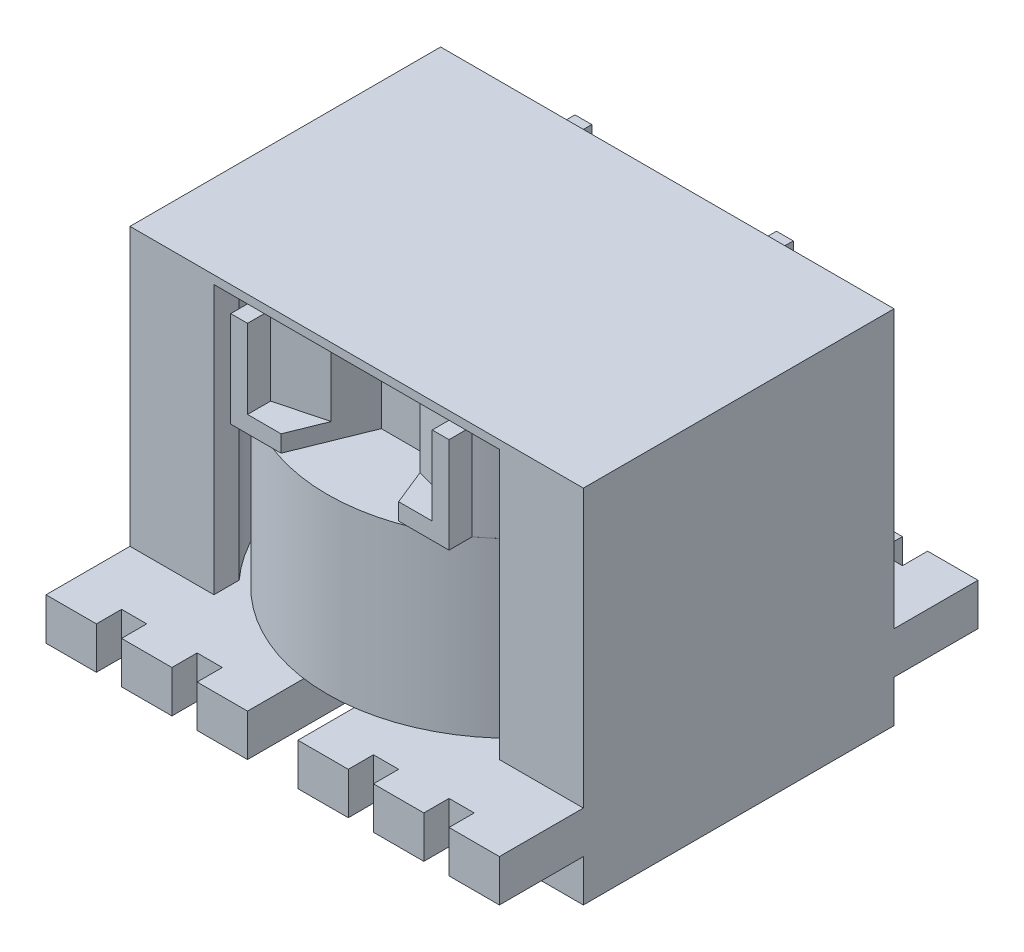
ISO-10303-21;
HEADER;
FILE_DESCRIPTION(('STEP AP214'),'2;1');
FILE_NAME('part.step','',(''),(''),'','','');
FILE_SCHEMA(('AUTOMOTIVE_DESIGN { 1 0 10303 214 1 1 1 1 }'));
ENDSEC;
DATA;
#1=APPLICATION_CONTEXT('core data for automotive mechanical design processes');
#2=APPLICATION_PROTOCOL_DEFINITION('international standard','automotive_design',2000,#1);
#3=PRODUCT_CONTEXT('',#1,'mechanical');
#4=PRODUCT('Part','Part','',(#3));
#5=PRODUCT_RELATED_PRODUCT_CATEGORY('part','',(#4));
#6=PRODUCT_DEFINITION_FORMATION('','',#4);
#7=PRODUCT_DEFINITION_CONTEXT('part definition',#1,'design');
#8=PRODUCT_DEFINITION('design','',#6,#7);
#9=PRODUCT_DEFINITION_SHAPE('','',#8);
#10=(LENGTH_UNIT() NAMED_UNIT(*) SI_UNIT(.MILLI.,.METRE.));
#11=(NAMED_UNIT(*) PLANE_ANGLE_UNIT() SI_UNIT($,.RADIAN.));
#12=(NAMED_UNIT(*) SI_UNIT($,.STERADIAN.) SOLID_ANGLE_UNIT());
#13=UNCERTAINTY_MEASURE_WITH_UNIT(LENGTH_MEASURE(1.E-05),#10,'distance_accuracy_value','');
#14=(GEOMETRIC_REPRESENTATION_CONTEXT(3) GLOBAL_UNCERTAINTY_ASSIGNED_CONTEXT((#13)) GLOBAL_UNIT_ASSIGNED_CONTEXT((#10,
#11,#12)) REPRESENTATION_CONTEXT('',''));
#15=CARTESIAN_POINT('',(0.,0.,0.));
#16=DIRECTION('',(0.,0.,1.));
#17=DIRECTION('',(1.,0.,0.));
#18=AXIS2_PLACEMENT_3D('',#15,#16,#17);
#19=CARTESIAN_POINT('',(-13.5,21.5,9.25));
#20=DIRECTION('',(1.,0.,0.));
#21=DIRECTION('',(0.,0.,-1.));
#22=AXIS2_PLACEMENT_3D('',#19,#20,#21);
#23=PLANE('',#22);
#24=DIRECTION('',(0.,0.,1.));
#25=VECTOR('',#24,1.);
#26=CARTESIAN_POINT('',(-13.5,5.,9.25));
#27=LINE('',#26,#25);
#28=CARTESIAN_POINT('',(-13.5,5.00000000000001,9.25));
#29=VERTEX_POINT('',#28);
#30=CARTESIAN_POINT('',(-13.5,5.,14.25));
#31=VERTEX_POINT('',#30);
#32=EDGE_CURVE('P0_E444',#29,#31,#27,.T.);
#33=ORIENTED_EDGE('',*,*,#32,.F.);
#34=DIRECTION('',(0.,-1.,0.));
#35=VECTOR('',#34,1.);
#36=CARTESIAN_POINT('',(-13.5,21.5,9.25));
#37=LINE('',#36,#35);
#38=CARTESIAN_POINT('',(-13.5,21.5,9.25));
#39=VERTEX_POINT('',#38);
#40=EDGE_CURVE('P0_E504',#39,#29,#37,.T.);
#41=ORIENTED_EDGE('',*,*,#40,.F.);
#42=DIRECTION('',(0.,0.,1.));
#43=VECTOR('',#42,1.);
#44=CARTESIAN_POINT('',(-13.5,21.5,9.25));
#45=LINE('',#44,#43);
#46=CARTESIAN_POINT('',(-13.5,21.5,-9.25));
#47=VERTEX_POINT('',#46);
#48=EDGE_CURVE('P0_E562',#47,#39,#45,.T.);
#49=ORIENTED_EDGE('',*,*,#48,.F.);
#50=DIRECTION('',(0.,-1.,0.));
#51=VECTOR('',#50,1.);
#52=CARTESIAN_POINT('',(-13.5,21.5,-9.25));
#53=LINE('',#52,#51);
#54=CARTESIAN_POINT('',(-13.5,5.00000000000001,-9.25));
#55=VERTEX_POINT('',#54);
#56=EDGE_CURVE('P0_E464',#47,#55,#53,.T.);
#57=ORIENTED_EDGE('',*,*,#56,.T.);
#58=DIRECTION('',(0.,0.,1.));
#59=VECTOR('',#58,1.);
#60=CARTESIAN_POINT('',(-13.5,5.,-9.25));
#61=LINE('',#60,#59);
#62=CARTESIAN_POINT('',(-13.5,5.,-14.25));
#63=VERTEX_POINT('',#62);
#64=EDGE_CURVE('P0_E439',#63,#55,#61,.T.);
#65=ORIENTED_EDGE('',*,*,#64,.F.);
#66=DIRECTION('',(0.,-1.,0.));
#67=VECTOR('',#66,1.);
#68=CARTESIAN_POINT('',(-13.5,5.,-14.25));
#69=LINE('',#68,#67);
#70=CARTESIAN_POINT('',(-13.5,2.5,-14.25));
#71=VERTEX_POINT('',#70);
#72=EDGE_CURVE('P0_E27',#63,#71,#69,.T.);
#73=ORIENTED_EDGE('',*,*,#72,.T.);
#74=DIRECTION('',(0.,0.,1.));
#75=VECTOR('',#74,1.);
#76=CARTESIAN_POINT('',(-13.5,2.5,-9.25));
#77=LINE('',#76,#75);
#78=CARTESIAN_POINT('',(-13.5,2.5,-9.25));
#79=VERTEX_POINT('',#78);
#80=EDGE_CURVE('P0_E447',#71,#79,#77,.T.);
#81=ORIENTED_EDGE('',*,*,#80,.T.);
#82=DIRECTION('',(0.,-1.,0.));
#83=VECTOR('',#82,1.);
#84=CARTESIAN_POINT('',(-13.5,21.,-9.25));
#85=LINE('',#84,#83);
#86=CARTESIAN_POINT('',(-13.5,0.,-9.25));
#87=VERTEX_POINT('',#86);
#88=EDGE_CURVE('P0_E597',#79,#87,#85,.T.);
#89=ORIENTED_EDGE('',*,*,#88,.T.);
#90=DIRECTION('',(0.,0.,1.));
#91=VECTOR('',#90,1.);
#92=CARTESIAN_POINT('',(-13.5,0.,9.25));
#93=LINE('',#92,#91);
#94=CARTESIAN_POINT('',(-13.5,0.,9.25));
#95=VERTEX_POINT('',#94);
#96=EDGE_CURVE('P0_E557',#87,#95,#93,.T.);
#97=ORIENTED_EDGE('',*,*,#96,.T.);
#98=DIRECTION('',(0.,-1.,0.));
#99=VECTOR('',#98,1.);
#100=CARTESIAN_POINT('',(-13.5,21.,9.25));
#101=LINE('',#100,#99);
#102=CARTESIAN_POINT('',(-13.5,2.50000000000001,9.25));
#103=VERTEX_POINT('',#102);
#104=EDGE_CURVE('P0_E35',#103,#95,#101,.T.);
#105=ORIENTED_EDGE('',*,*,#104,.F.);
#106=DIRECTION('',(0.,0.,1.));
#107=VECTOR('',#106,1.);
#108=CARTESIAN_POINT('',(-13.5,2.5,9.25));
#109=LINE('',#108,#107);
#110=CARTESIAN_POINT('',(-13.5,2.5,14.25));
#111=VERTEX_POINT('',#110);
#112=EDGE_CURVE('P0_E11',#103,#111,#109,.T.);
#113=ORIENTED_EDGE('',*,*,#112,.T.);
#114=DIRECTION('',(0.,-1.,0.));
#115=VECTOR('',#114,1.);
#116=CARTESIAN_POINT('',(-13.5,5.,14.25));
#117=LINE('',#116,#115);
#118=EDGE_CURVE('P0_E804',#31,#111,#117,.T.);
#119=ORIENTED_EDGE('',*,*,#118,.F.);
#120=EDGE_LOOP('',(#33,#41,#49,#57,#65,#73,#81,#89,#97,#105,#113,#119));
#121=FACE_BOUND('',#120,.T.);
#122=ADVANCED_FACE('P0_F17',(#121),#23,.F.);
#123=CARTESIAN_POINT('',(13.5,21.,9.25));
#124=DIRECTION('',(-1.,0.,0.));
#125=DIRECTION('',(0.,0.,-1.));
#126=AXIS2_PLACEMENT_3D('',#123,#124,#125);
#127=PLANE('',#126);
#128=DIRECTION('',(0.,0.,1.));
#129=VECTOR('',#128,1.);
#130=CARTESIAN_POINT('',(13.5,2.5,9.25));
#131=LINE('',#130,#129);
#132=CARTESIAN_POINT('',(13.5,2.50000000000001,9.25));
#133=VERTEX_POINT('',#132);
#134=CARTESIAN_POINT('',(13.5,2.5,14.25));
#135=VERTEX_POINT('',#134);
#136=EDGE_CURVE('P0_E457',#133,#135,#131,.T.);
#137=ORIENTED_EDGE('',*,*,#136,.F.);
#138=DIRECTION('',(0.,-1.,0.));
#139=VECTOR('',#138,1.);
#140=CARTESIAN_POINT('',(13.5,21.,9.25));
#141=LINE('',#140,#139);
#142=CARTESIAN_POINT('',(13.5,0.,9.25));
#143=VERTEX_POINT('',#142);
#144=EDGE_CURVE('P0_E516',#133,#143,#141,.T.);
#145=ORIENTED_EDGE('',*,*,#144,.T.);
#146=DIRECTION('',(0.,0.,1.));
#147=VECTOR('',#146,1.);
#148=CARTESIAN_POINT('',(13.5,0.,9.25));
#149=LINE('',#148,#147);
#150=CARTESIAN_POINT('',(13.5,0.,-9.25));
#151=VERTEX_POINT('',#150);
#152=EDGE_CURVE('P0_E514',#151,#143,#149,.T.);
#153=ORIENTED_EDGE('',*,*,#152,.F.);
#154=DIRECTION('',(0.,-1.,0.));
#155=VECTOR('',#154,1.);
#156=CARTESIAN_POINT('',(13.5,21.,-9.25));
#157=LINE('',#156,#155);
#158=CARTESIAN_POINT('',(13.5,2.5,-9.25));
#159=VERTEX_POINT('',#158);
#160=EDGE_CURVE('P0_E540',#159,#151,#157,.T.);
#161=ORIENTED_EDGE('',*,*,#160,.F.);
#162=DIRECTION('',(0.,0.,1.));
#163=VECTOR('',#162,1.);
#164=CARTESIAN_POINT('',(13.5,2.5,-9.25));
#165=LINE('',#164,#163);
#166=CARTESIAN_POINT('',(13.5,2.5,-14.25));
#167=VERTEX_POINT('',#166);
#168=EDGE_CURVE('P0_E461',#167,#159,#165,.T.);
#169=ORIENTED_EDGE('',*,*,#168,.F.);
#170=DIRECTION('',(0.,-1.,0.));
#171=VECTOR('',#170,1.);
#172=CARTESIAN_POINT('',(13.5,5.,-14.25));
#173=LINE('',#172,#171);
#174=CARTESIAN_POINT('',(13.5,5.,-14.25));
#175=VERTEX_POINT('',#174);
#176=EDGE_CURVE('P0_E465',#175,#167,#173,.T.);
#177=ORIENTED_EDGE('',*,*,#176,.F.);
#178=DIRECTION('',(0.,0.,1.));
#179=VECTOR('',#178,1.);
#180=CARTESIAN_POINT('',(13.5,5.,-9.25));
#181=LINE('',#180,#179);
#182=CARTESIAN_POINT('',(13.5,5.00000000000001,-9.25));
#183=VERTEX_POINT('',#182);
#184=EDGE_CURVE('P0_E456',#175,#183,#181,.T.);
#185=ORIENTED_EDGE('',*,*,#184,.T.);
#186=DIRECTION('',(0.,-1.,0.));
#187=VECTOR('',#186,1.);
#188=CARTESIAN_POINT('',(13.5,21.,-9.25));
#189=LINE('',#188,#187);
#190=CARTESIAN_POINT('',(13.5,21.5,-9.25));
#191=VERTEX_POINT('',#190);
#192=EDGE_CURVE('P0_E553',#191,#183,#189,.T.);
#193=ORIENTED_EDGE('',*,*,#192,.F.);
#194=DIRECTION('',(0.,0.,-1.));
#195=VECTOR('',#194,1.);
#196=CARTESIAN_POINT('',(13.5,21.5,9.25));
#197=LINE('',#196,#195);
#198=CARTESIAN_POINT('',(13.5,21.5,9.25));
#199=VERTEX_POINT('',#198);
#200=EDGE_CURVE('P0_E555',#199,#191,#197,.T.);
#201=ORIENTED_EDGE('',*,*,#200,.F.);
#202=DIRECTION('',(0.,-1.,0.));
#203=VECTOR('',#202,1.);
#204=CARTESIAN_POINT('',(13.5,21.,9.25));
#205=LINE('',#204,#203);
#206=CARTESIAN_POINT('',(13.5,5.00000000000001,9.25));
#207=VERTEX_POINT('',#206);
#208=EDGE_CURVE('P0_E519',#199,#207,#205,.T.);
#209=ORIENTED_EDGE('',*,*,#208,.T.);
#210=DIRECTION('',(0.,0.,1.));
#211=VECTOR('',#210,1.);
#212=CARTESIAN_POINT('',(13.5,5.,9.25));
#213=LINE('',#212,#211);
#214=CARTESIAN_POINT('',(13.5,5.,14.25));
#215=VERTEX_POINT('',#214);
#216=EDGE_CURVE('P0_E450',#207,#215,#213,.T.);
#217=ORIENTED_EDGE('',*,*,#216,.T.);
#218=DIRECTION('',(0.,-1.,0.));
#219=VECTOR('',#218,1.);
#220=CARTESIAN_POINT('',(13.5,5.,14.25));
#221=LINE('',#220,#219);
#222=EDGE_CURVE('P0_E453',#215,#135,#221,.T.);
#223=ORIENTED_EDGE('',*,*,#222,.T.);
#224=EDGE_LOOP('',(#137,#145,#153,#161,#169,#177,#185,#193,#201,#209,#217,#223));
#225=FACE_BOUND('',#224,.T.);
#226=ADVANCED_FACE('P0_F951',(#225),#127,.F.);
#227=CARTESIAN_POINT('',(13.5,21.,-9.25));
#228=DIRECTION('',(0.,1.,0.));
#229=DIRECTION('',(0.,0.,1.));
#230=AXIS2_PLACEMENT_3D('',#227,#228,#229);
#231=PLANE('',#230);
#232=DIRECTION('',(0.,0.,-1.));
#233=VECTOR('',#232,1.);
#234=CARTESIAN_POINT('',(-8.5,21.,7.74596669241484));
#235=LINE('',#234,#233);
#236=CARTESIAN_POINT('',(-8.5,21.,9.25));
#237=VERTEX_POINT('',#236);
#238=CARTESIAN_POINT('',(-8.5,21.,7.74596669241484));
#239=VERTEX_POINT('',#238);
#240=EDGE_CURVE('P0_E472',#237,#239,#235,.T.);
#241=ORIENTED_EDGE('',*,*,#240,.T.);
#242=CARTESIAN_POINT('',(0.,21.,0.));
#243=DIRECTION('',(0.,-1.,0.));
#244=DIRECTION('',(0.,0.,1.));
#245=AXIS2_PLACEMENT_3D('',#242,#243,#244);
#246=CIRCLE('',#245,11.5);
#247=CARTESIAN_POINT('',(-8.49999999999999,21.,-7.74596669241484));
#248=VERTEX_POINT('',#247);
#249=EDGE_CURVE('P0_E475',#239,#248,#246,.T.);
#250=ORIENTED_EDGE('',*,*,#249,.T.);
#251=DIRECTION('',(0.,0.,-1.));
#252=VECTOR('',#251,1.);
#253=CARTESIAN_POINT('',(-8.5,21.,-9.25));
#254=LINE('',#253,#252);
#255=CARTESIAN_POINT('',(-8.5,21.,-9.25));
#256=VERTEX_POINT('',#255);
#257=EDGE_CURVE('P0_E478',#248,#256,#254,.T.);
#258=ORIENTED_EDGE('',*,*,#257,.T.);
#259=DIRECTION('',(-1.,0.,0.));
#260=VECTOR('',#259,1.);
#261=CARTESIAN_POINT('',(13.5,21.,-9.25));
#262=LINE('',#261,#260);
#263=CARTESIAN_POINT('',(8.5,21.,-9.25));
#264=VERTEX_POINT('',#263);
#265=EDGE_CURVE('P0_E482',#264,#256,#262,.T.);
#266=ORIENTED_EDGE('',*,*,#265,.F.);
#267=DIRECTION('',(0.,0.,-1.));
#268=VECTOR('',#267,1.);
#269=CARTESIAN_POINT('',(8.5,21.,-9.25));
#270=LINE('',#269,#268);
#271=CARTESIAN_POINT('',(8.49999999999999,21.,-7.74596669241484));
#272=VERTEX_POINT('',#271);
#273=EDGE_CURVE('P0_E486',#272,#264,#270,.T.);
#274=ORIENTED_EDGE('',*,*,#273,.F.);
#275=CARTESIAN_POINT('',(0.,21.,0.));
#276=DIRECTION('',(0.,1.,0.));
#277=DIRECTION('',(0.,0.,1.));
#278=AXIS2_PLACEMENT_3D('',#275,#276,#277);
#279=CIRCLE('',#278,11.5);
#280=CARTESIAN_POINT('',(8.5,21.,7.74596669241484));
#281=VERTEX_POINT('',#280);
#282=EDGE_CURVE('P0_E491',#281,#272,#279,.T.);
#283=ORIENTED_EDGE('',*,*,#282,.F.);
#284=DIRECTION('',(0.,0.,-1.));
#285=VECTOR('',#284,1.);
#286=CARTESIAN_POINT('',(8.5,21.,7.74596669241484));
#287=LINE('',#286,#285);
#288=CARTESIAN_POINT('',(8.5,21.,9.25));
#289=VERTEX_POINT('',#288);
#290=EDGE_CURVE('P0_E496',#289,#281,#287,.T.);
#291=ORIENTED_EDGE('',*,*,#290,.F.);
#292=DIRECTION('',(1.,0.,0.));
#293=VECTOR('',#292,1.);
#294=CARTESIAN_POINT('',(13.5,21.,9.25));
#295=LINE('',#294,#293);
#296=EDGE_CURVE('P0_E501',#237,#289,#295,.T.);
#297=ORIENTED_EDGE('',*,*,#296,.F.);
#298=EDGE_LOOP('',(#241,#250,#258,#266,#274,#283,#291,#297));
#299=FACE_BOUND('',#298,.T.);
#300=ADVANCED_FACE('P0_F961',(#299),#231,.F.);
#301=CARTESIAN_POINT('',(13.5,21.,9.25));
#302=DIRECTION('',(0.,0.,-1.));
#303=DIRECTION('',(1.,0.,0.));
#304=AXIS2_PLACEMENT_3D('',#301,#302,#303);
#305=PLANE('',#304);
#306=DIRECTION('',(1.,0.,0.));
#307=VECTOR('',#306,1.);
#308=CARTESIAN_POINT('',(13.5,2.5,9.25));
#309=LINE('',#308,#307);
#310=CARTESIAN_POINT('',(8.5,2.50000000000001,9.25));
#311=VERTEX_POINT('',#310);
#312=EDGE_CURVE('P0_E459',#311,#133,#309,.T.);
#313=ORIENTED_EDGE('',*,*,#312,.F.);
#314=DIRECTION('',(0.,-1.,0.));
#315=VECTOR('',#314,1.);
#316=CARTESIAN_POINT('',(8.5,21.,9.25));
#317=LINE('',#316,#315);
#318=CARTESIAN_POINT('',(8.5,0.,9.25));
#319=VERTEX_POINT('',#318);
#320=EDGE_CURVE('P0_E481',#311,#319,#317,.T.);
#321=ORIENTED_EDGE('',*,*,#320,.T.);
#322=DIRECTION('',(-1.,0.,0.));
#323=VECTOR('',#322,1.);
#324=CARTESIAN_POINT('',(13.5,0.,9.25));
#325=LINE('',#324,#323);
#326=EDGE_CURVE('P0_E512',#143,#319,#325,.T.);
#327=ORIENTED_EDGE('',*,*,#326,.F.);
#328=ORIENTED_EDGE('',*,*,#144,.F.);
#329=EDGE_LOOP('',(#313,#321,#327,#328));
#330=FACE_BOUND('',#329,.T.);
#331=ADVANCED_FACE('P0_F980',(#330),#305,.F.);
#332=CARTESIAN_POINT('',(8.5,21.,7.74596669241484));
#333=DIRECTION('',(1.,0.,0.));
#334=DIRECTION('',(0.,0.,1.));
#335=AXIS2_PLACEMENT_3D('',#332,#333,#334);
#336=PLANE('',#335);
#337=DIRECTION('',(0.,0.,1.));
#338=VECTOR('',#337,1.);
#339=CARTESIAN_POINT('',(8.5,2.5,7.74596669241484));
#340=LINE('',#339,#338);
#341=CARTESIAN_POINT('',(8.5,2.50000000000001,7.74596669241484));
#342=VERTEX_POINT('',#341);
#343=EDGE_CURVE('P0_E508',#342,#311,#340,.T.);
#344=ORIENTED_EDGE('',*,*,#343,.F.);
#345=DIRECTION('',(0.,-1.,0.));
#346=VECTOR('',#345,1.);
#347=CARTESIAN_POINT('',(8.5,21.,7.74596669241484));
#348=LINE('',#347,#346);
#349=CARTESIAN_POINT('',(8.5,0.,7.74596669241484));
#350=VERTEX_POINT('',#349);
#351=EDGE_CURVE('P0_E511',#342,#350,#348,.T.);
#352=ORIENTED_EDGE('',*,*,#351,.T.);
#353=DIRECTION('',(0.,0.,-1.));
#354=VECTOR('',#353,1.);
#355=CARTESIAN_POINT('',(8.5,0.,7.74596669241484));
#356=LINE('',#355,#354);
#357=EDGE_CURVE('P0_E515',#319,#350,#356,.T.);
#358=ORIENTED_EDGE('',*,*,#357,.F.);
#359=ORIENTED_EDGE('',*,*,#320,.F.);
#360=EDGE_LOOP('',(#344,#352,#358,#359));
#361=FACE_BOUND('',#360,.T.);
#362=ADVANCED_FACE('P0_F1080',(#361),#336,.F.);
#363=CARTESIAN_POINT('',(0.,21.,0.));
#364=DIRECTION('',(0.,-1.,0.));
#365=DIRECTION('',(0.,0.,-1.));
#366=AXIS2_PLACEMENT_3D('',#363,#364,#365);
#367=CYLINDRICAL_SURFACE('',#366,11.5);
#368=CARTESIAN_POINT('',(0.,2.5,0.));
#369=DIRECTION('',(0.,-1.,0.));
#370=DIRECTION('',(0.,0.,1.));
#371=AXIS2_PLACEMENT_3D('',#368,#369,#370);
#372=CIRCLE('',#371,11.5);
#373=CARTESIAN_POINT('',(8.49999999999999,2.50000000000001,-7.74596669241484));
#374=VERTEX_POINT('',#373);
#375=EDGE_CURVE('P0_E522',#374,#342,#372,.T.);
#376=ORIENTED_EDGE('',*,*,#375,.F.);
#377=DIRECTION('',(0.,-1.,0.));
#378=VECTOR('',#377,1.);
#379=CARTESIAN_POINT('',(8.49999999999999,21.,-7.74596669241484));
#380=LINE('',#379,#378);
#381=CARTESIAN_POINT('',(8.49999999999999,0.,-7.74596669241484));
#382=VERTEX_POINT('',#381);
#383=EDGE_CURVE('P0_E525',#374,#382,#380,.T.);
#384=ORIENTED_EDGE('',*,*,#383,.T.);
#385=CARTESIAN_POINT('',(0.,0.,0.));
#386=DIRECTION('',(0.,1.,0.));
#387=DIRECTION('',(0.,0.,1.));
#388=AXIS2_PLACEMENT_3D('',#385,#386,#387);
#389=CIRCLE('',#388,11.5);
#390=EDGE_CURVE('P0_E527',#350,#382,#389,.T.);
#391=ORIENTED_EDGE('',*,*,#390,.F.);
#392=ORIENTED_EDGE('',*,*,#351,.F.);
#393=EDGE_LOOP('',(#376,#384,#391,#392));
#394=FACE_BOUND('',#393,.T.);
#395=ADVANCED_FACE('P0_F1083',(#394),#367,.F.);
#396=CARTESIAN_POINT('',(8.5,21.,-9.25));
#397=DIRECTION('',(1.,0.,0.));
#398=DIRECTION('',(0.,0.,1.));
#399=AXIS2_PLACEMENT_3D('',#396,#397,#398);
#400=PLANE('',#399);
#401=DIRECTION('',(0.,0.,1.));
#402=VECTOR('',#401,1.);
#403=CARTESIAN_POINT('',(8.5,2.5,-9.25));
#404=LINE('',#403,#402);
#405=CARTESIAN_POINT('',(8.5,2.50000000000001,-9.25));
#406=VERTEX_POINT('',#405);
#407=EDGE_CURVE('P0_E530',#406,#374,#404,.T.);
#408=ORIENTED_EDGE('',*,*,#407,.F.);
#409=DIRECTION('',(0.,-1.,0.));
#410=VECTOR('',#409,1.);
#411=CARTESIAN_POINT('',(8.5,21.,-9.25));
#412=LINE('',#411,#410);
#413=CARTESIAN_POINT('',(8.5,0.,-9.25));
#414=VERTEX_POINT('',#413);
#415=EDGE_CURVE('P0_E533',#406,#414,#412,.T.);
#416=ORIENTED_EDGE('',*,*,#415,.T.);
#417=DIRECTION('',(0.,0.,-1.));
#418=VECTOR('',#417,1.);
#419=CARTESIAN_POINT('',(8.5,0.,-9.25));
#420=LINE('',#419,#418);
#421=EDGE_CURVE('P0_E535',#382,#414,#420,.T.);
#422=ORIENTED_EDGE('',*,*,#421,.F.);
#423=ORIENTED_EDGE('',*,*,#383,.F.);
#424=EDGE_LOOP('',(#408,#416,#422,#423));
#425=FACE_BOUND('',#424,.T.);
#426=ADVANCED_FACE('P0_F1087',(#425),#400,.F.);
#427=CARTESIAN_POINT('',(13.5,21.,-9.25));
#428=DIRECTION('',(0.,0.,1.));
#429=DIRECTION('',(-1.,0.,0.));
#430=AXIS2_PLACEMENT_3D('',#427,#428,#429);
#431=PLANE('',#430);
#432=DIRECTION('',(-1.,0.,0.));
#433=VECTOR('',#432,1.);
#434=CARTESIAN_POINT('',(13.5,2.5,-9.25));
#435=LINE('',#434,#433);
#436=EDGE_CURVE('P0_E469',#159,#406,#435,.T.);
#437=ORIENTED_EDGE('',*,*,#436,.F.);
#438=ORIENTED_EDGE('',*,*,#160,.T.);
#439=DIRECTION('',(1.,0.,0.));
#440=VECTOR('',#439,1.);
#441=CARTESIAN_POINT('',(13.5,0.,-9.25));
#442=LINE('',#441,#440);
#443=EDGE_CURVE('P0_E542',#414,#151,#442,.T.);
#444=ORIENTED_EDGE('',*,*,#443,.F.);
#445=ORIENTED_EDGE('',*,*,#415,.F.);
#446=EDGE_LOOP('',(#437,#438,#444,#445));
#447=FACE_BOUND('',#446,.T.);
#448=ADVANCED_FACE('P0_F990',(#447),#431,.F.);
#449=CARTESIAN_POINT('',(13.5,21.,9.25));
#450=DIRECTION('',(0.,0.,-1.));
#451=DIRECTION('',(1.,0.,0.));
#452=AXIS2_PLACEMENT_3D('',#449,#450,#451);
#453=PLANE('',#452);
#454=ORIENTED_EDGE('',*,*,#208,.F.);
#455=DIRECTION('',(1.,0.,0.));
#456=VECTOR('',#455,1.);
#457=CARTESIAN_POINT('',(13.5,21.5,9.25));
#458=LINE('',#457,#456);
#459=EDGE_CURVE('P0_E559',#39,#199,#458,.T.);
#460=ORIENTED_EDGE('',*,*,#459,.F.);
#461=ORIENTED_EDGE('',*,*,#40,.T.);
#462=DIRECTION('',(-1.,0.,0.));
#463=VECTOR('',#462,1.);
#464=CARTESIAN_POINT('',(-13.5,5.,9.25));
#465=LINE('',#464,#463);
#466=CARTESIAN_POINT('',(-8.5,5.00000000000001,9.25));
#467=VERTEX_POINT('',#466);
#468=EDGE_CURVE('P0_E566',#467,#29,#465,.T.);
#469=ORIENTED_EDGE('',*,*,#468,.F.);
#470=DIRECTION('',(0.,-1.,0.));
#471=VECTOR('',#470,1.);
#472=CARTESIAN_POINT('',(-8.5,21.,9.25));
#473=LINE('',#472,#471);
#474=EDGE_CURVE('P0_E570',#237,#467,#473,.T.);
#475=ORIENTED_EDGE('',*,*,#474,.F.);
#476=ORIENTED_EDGE('',*,*,#296,.T.);
#477=DIRECTION('',(0.,-1.,0.));
#478=VECTOR('',#477,1.);
#479=CARTESIAN_POINT('',(8.5,21.,9.25));
#480=LINE('',#479,#478);
#481=CARTESIAN_POINT('',(8.5,5.00000000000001,9.25));
#482=VERTEX_POINT('',#481);
#483=EDGE_CURVE('P0_E505',#289,#482,#480,.T.);
#484=ORIENTED_EDGE('',*,*,#483,.T.);
#485=DIRECTION('',(1.,0.,0.));
#486=VECTOR('',#485,1.);
#487=CARTESIAN_POINT('',(13.5,5.,9.25));
#488=LINE('',#487,#486);
#489=EDGE_CURVE('P0_E499',#482,#207,#488,.T.);
#490=ORIENTED_EDGE('',*,*,#489,.T.);
#491=EDGE_LOOP('',(#454,#460,#461,#469,#475,#476,#484,#490));
#492=FACE_BOUND('',#491,.T.);
#493=ADVANCED_FACE('P0_F946',(#492),#453,.F.);
#494=CARTESIAN_POINT('',(8.5,21.,7.74596669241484));
#495=DIRECTION('',(1.,0.,0.));
#496=DIRECTION('',(0.,0.,1.));
#497=AXIS2_PLACEMENT_3D('',#494,#495,#496);
#498=PLANE('',#497);
#499=ORIENTED_EDGE('',*,*,#483,.F.);
#500=ORIENTED_EDGE('',*,*,#290,.T.);
#501=DIRECTION('',(0.,-1.,0.));
#502=VECTOR('',#501,1.);
#503=CARTESIAN_POINT('',(8.5,21.,7.74596669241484));
#504=LINE('',#503,#502);
#505=CARTESIAN_POINT('',(8.5,5.00000000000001,7.74596669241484));
#506=VERTEX_POINT('',#505);
#507=EDGE_CURVE('P0_E500',#281,#506,#504,.T.);
#508=ORIENTED_EDGE('',*,*,#507,.T.);
#509=DIRECTION('',(0.,0.,1.));
#510=VECTOR('',#509,1.);
#511=CARTESIAN_POINT('',(8.5,5.,7.74596669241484));
#512=LINE('',#511,#510);
#513=EDGE_CURVE('P0_E494',#506,#482,#512,.T.);
#514=ORIENTED_EDGE('',*,*,#513,.T.);
#515=EDGE_LOOP('',(#499,#500,#508,#514));
#516=FACE_BOUND('',#515,.T.);
#517=ADVANCED_FACE('P0_F967',(#516),#498,.F.);
#518=CARTESIAN_POINT('',(0.,21.,0.));
#519=DIRECTION('',(0.,-1.,0.));
#520=DIRECTION('',(0.,0.,-1.));
#521=AXIS2_PLACEMENT_3D('',#518,#519,#520);
#522=CYLINDRICAL_SURFACE('',#521,11.5);
#523=ORIENTED_EDGE('',*,*,#507,.F.);
#524=ORIENTED_EDGE('',*,*,#282,.T.);
#525=DIRECTION('',(0.,-1.,0.));
#526=VECTOR('',#525,1.);
#527=CARTESIAN_POINT('',(8.49999999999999,21.,-7.74596669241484));
#528=LINE('',#527,#526);
#529=CARTESIAN_POINT('',(8.49999999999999,5.00000000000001,-7.74596669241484));
#530=VERTEX_POINT('',#529);
#531=EDGE_CURVE('P0_E495',#272,#530,#528,.T.);
#532=ORIENTED_EDGE('',*,*,#531,.T.);
#533=CARTESIAN_POINT('',(0.,5.,0.));
#534=DIRECTION('',(0.,-1.,0.));
#535=DIRECTION('',(0.,0.,1.));
#536=AXIS2_PLACEMENT_3D('',#533,#534,#535);
#537=CIRCLE('',#536,11.5);
#538=EDGE_CURVE('P0_E489',#530,#506,#537,.T.);
#539=ORIENTED_EDGE('',*,*,#538,.T.);
#540=EDGE_LOOP('',(#523,#524,#532,#539));
#541=FACE_BOUND('',#540,.T.);
#542=ADVANCED_FACE('P0_F964',(#541),#522,.F.);
#543=CARTESIAN_POINT('',(8.5,21.,-9.25));
#544=DIRECTION('',(1.,0.,0.));
#545=DIRECTION('',(0.,0.,1.));
#546=AXIS2_PLACEMENT_3D('',#543,#544,#545);
#547=PLANE('',#546);
#548=ORIENTED_EDGE('',*,*,#531,.F.);
#549=ORIENTED_EDGE('',*,*,#273,.T.);
#550=DIRECTION('',(0.,-1.,0.));
#551=VECTOR('',#550,1.);
#552=CARTESIAN_POINT('',(8.5,21.,-9.25));
#553=LINE('',#552,#551);
#554=CARTESIAN_POINT('',(8.5,5.00000000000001,-9.25));
#555=VERTEX_POINT('',#554);
#556=EDGE_CURVE('P0_E490',#264,#555,#553,.T.);
#557=ORIENTED_EDGE('',*,*,#556,.T.);
#558=DIRECTION('',(0.,0.,1.));
#559=VECTOR('',#558,1.);
#560=CARTESIAN_POINT('',(8.5,5.,-9.25));
#561=LINE('',#560,#559);
#562=EDGE_CURVE('P0_E484',#555,#530,#561,.T.);
#563=ORIENTED_EDGE('',*,*,#562,.T.);
#564=EDGE_LOOP('',(#548,#549,#557,#563));
#565=FACE_BOUND('',#564,.T.);
#566=ADVANCED_FACE('P0_F959',(#565),#547,.F.);
#567=CARTESIAN_POINT('',(13.5,21.,-9.25));
#568=DIRECTION('',(0.,0.,1.));
#569=DIRECTION('',(-1.,0.,0.));
#570=AXIS2_PLACEMENT_3D('',#567,#568,#569);
#571=PLANE('',#570);
#572=ORIENTED_EDGE('',*,*,#556,.F.);
#573=ORIENTED_EDGE('',*,*,#265,.T.);
#574=DIRECTION('',(0.,-1.,0.));
#575=VECTOR('',#574,1.);
#576=CARTESIAN_POINT('',(-8.5,21.,-9.25));
#577=LINE('',#576,#575);
#578=CARTESIAN_POINT('',(-8.5,5.00000000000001,-9.25));
#579=VERTEX_POINT('',#578);
#580=EDGE_CURVE('P0_E485',#256,#579,#577,.T.);
#581=ORIENTED_EDGE('',*,*,#580,.T.);
#582=DIRECTION('',(1.,0.,0.));
#583=VECTOR('',#582,1.);
#584=CARTESIAN_POINT('',(-13.5,5.,-9.25));
#585=LINE('',#584,#583);
#586=EDGE_CURVE('P0_E434',#55,#579,#585,.T.);
#587=ORIENTED_EDGE('',*,*,#586,.F.);
#588=ORIENTED_EDGE('',*,*,#56,.F.);
#589=DIRECTION('',(-1.,0.,0.));
#590=VECTOR('',#589,1.);
#591=CARTESIAN_POINT('',(13.5,21.5,-9.25));
#592=LINE('',#591,#590);
#593=EDGE_CURVE('P0_E558',#191,#47,#592,.T.);
#594=ORIENTED_EDGE('',*,*,#593,.F.);
#595=ORIENTED_EDGE('',*,*,#192,.T.);
#596=DIRECTION('',(-1.,0.,0.));
#597=VECTOR('',#596,1.);
#598=CARTESIAN_POINT('',(13.5,5.,-9.25));
#599=LINE('',#598,#597);
#600=EDGE_CURVE('P0_E552',#183,#555,#599,.T.);
#601=ORIENTED_EDGE('',*,*,#600,.T.);
#602=EDGE_LOOP('',(#572,#573,#581,#587,#588,#594,#595,#601));
#603=FACE_BOUND('',#602,.T.);
#604=ADVANCED_FACE('P0_F930',(#603),#571,.F.);
#605=CARTESIAN_POINT('',(0.,0.,0.));
#606=DIRECTION('',(0.,1.,0.));
#607=DIRECTION('',(0.,0.,1.));
#608=AXIS2_PLACEMENT_3D('',#605,#606,#607);
#609=PLANE('',#608);
#610=ORIENTED_EDGE('',*,*,#152,.T.);
#611=ORIENTED_EDGE('',*,*,#326,.T.);
#612=ORIENTED_EDGE('',*,*,#357,.T.);
#613=ORIENTED_EDGE('',*,*,#390,.T.);
#614=ORIENTED_EDGE('',*,*,#421,.T.);
#615=ORIENTED_EDGE('',*,*,#443,.T.);
#616=EDGE_LOOP('',(#610,#611,#612,#613,#614,#615));
#617=FACE_BOUND('',#616,.T.);
#618=ADVANCED_FACE('P0_F984',(#617),#609,.F.);
#619=CARTESIAN_POINT('',(13.5,5.,14.25));
#620=DIRECTION('',(0.,0.,-1.));
#621=DIRECTION('',(1.,0.,0.));
#622=AXIS2_PLACEMENT_3D('',#619,#620,#621);
#623=PLANE('',#622);
#624=DIRECTION('',(-1.,0.,0.));
#625=VECTOR('',#624,1.);
#626=CARTESIAN_POINT('',(13.5,2.5,14.25));
#627=LINE('',#626,#625);
#628=CARTESIAN_POINT('',(10.5,2.5,14.25));
#629=VERTEX_POINT('',#628);
#630=EDGE_CURVE('P0_E460',#135,#629,#627,.T.);
#631=ORIENTED_EDGE('',*,*,#630,.F.);
#632=ORIENTED_EDGE('',*,*,#222,.F.);
#633=DIRECTION('',(-1.,0.,0.));
#634=VECTOR('',#633,1.);
#635=CARTESIAN_POINT('',(13.5,5.,14.25));
#636=LINE('',#635,#634);
#637=CARTESIAN_POINT('',(10.5,5.,14.25));
#638=VERTEX_POINT('',#637);
#639=EDGE_CURVE('P0_E548',#215,#638,#636,.T.);
#640=ORIENTED_EDGE('',*,*,#639,.T.);
#641=DIRECTION('',(0.,-1.,0.));
#642=VECTOR('',#641,1.);
#643=CARTESIAN_POINT('',(10.5,5.,14.25));
#644=LINE('',#643,#642);
#645=EDGE_CURVE('P0_E605',#638,#629,#644,.T.);
#646=ORIENTED_EDGE('',*,*,#645,.T.);
#647=EDGE_LOOP('',(#631,#632,#640,#646));
#648=FACE_BOUND('',#647,.T.);
#649=ADVANCED_FACE('P0_F973',(#648),#623,.F.);
#650=CARTESIAN_POINT('',(10.5,5.,14.25));
#651=DIRECTION('',(1.,0.,0.));
#652=DIRECTION('',(0.,0.,1.));
#653=AXIS2_PLACEMENT_3D('',#650,#651,#652);
#654=PLANE('',#653);
#655=DIRECTION('',(0.,0.,-1.));
#656=VECTOR('',#655,1.);
#657=CARTESIAN_POINT('',(10.5,2.5,14.25));
#658=LINE('',#657,#656);
#659=CARTESIAN_POINT('',(10.5,2.5,12.75));
#660=VERTEX_POINT('',#659);
#661=EDGE_CURVE('P0_E602',#629,#660,#658,.T.);
#662=ORIENTED_EDGE('',*,*,#661,.F.);
#663=ORIENTED_EDGE('',*,*,#645,.F.);
#664=DIRECTION('',(0.,0.,-1.));
#665=VECTOR('',#664,1.);
#666=CARTESIAN_POINT('',(10.5,5.,14.25));
#667=LINE('',#666,#665);
#668=CARTESIAN_POINT('',(10.5,5.,12.75));
#669=VERTEX_POINT('',#668);
#670=EDGE_CURVE('P0_E608',#638,#669,#667,.T.);
#671=ORIENTED_EDGE('',*,*,#670,.T.);
#672=DIRECTION('',(0.,-1.,0.));
#673=VECTOR('',#672,1.);
#674=CARTESIAN_POINT('',(10.5,5.,12.75));
#675=LINE('',#674,#673);
#676=EDGE_CURVE('P0_E613',#669,#660,#675,.T.);
#677=ORIENTED_EDGE('',*,*,#676,.T.);
#678=EDGE_LOOP('',(#662,#663,#671,#677));
#679=FACE_BOUND('',#678,.T.);
#680=ADVANCED_FACE('P0_F1059',(#679),#654,.F.);
#681=CARTESIAN_POINT('',(10.5,5.,12.75));
#682=DIRECTION('',(0.,0.,-1.));
#683=DIRECTION('',(1.,0.,0.));
#684=AXIS2_PLACEMENT_3D('',#681,#682,#683);
#685=PLANE('',#684);
#686=DIRECTION('',(-1.,0.,0.));
#687=VECTOR('',#686,1.);
#688=CARTESIAN_POINT('',(10.5,2.5,12.75));
#689=LINE('',#688,#687);
#690=CARTESIAN_POINT('',(9.00000000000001,2.5,12.75));
#691=VERTEX_POINT('',#690);
#692=EDGE_CURVE('P0_E610',#660,#691,#689,.T.);
#693=ORIENTED_EDGE('',*,*,#692,.F.);
#694=ORIENTED_EDGE('',*,*,#676,.F.);
#695=DIRECTION('',(-1.,0.,0.));
#696=VECTOR('',#695,1.);
#697=CARTESIAN_POINT('',(10.5,5.,12.75));
#698=LINE('',#697,#696);
#699=CARTESIAN_POINT('',(9.00000000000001,5.,12.75));
#700=VERTEX_POINT('',#699);
#701=EDGE_CURVE('P0_E616',#669,#700,#698,.T.);
#702=ORIENTED_EDGE('',*,*,#701,.T.);
#703=DIRECTION('',(0.,-1.,0.));
#704=VECTOR('',#703,1.);
#705=CARTESIAN_POINT('',(9.00000000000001,5.,12.75));
#706=LINE('',#705,#704);
#707=EDGE_CURVE('P0_E621',#700,#691,#706,.T.);
#708=ORIENTED_EDGE('',*,*,#707,.T.);
#709=EDGE_LOOP('',(#693,#694,#702,#708));
#710=FACE_BOUND('',#709,.T.);
#711=ADVANCED_FACE('P0_F1057',(#710),#685,.F.);
#712=CARTESIAN_POINT('',(9.00000000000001,5.,14.25));
#713=DIRECTION('',(-1.,0.,0.));
#714=DIRECTION('',(0.,0.,-1.));
#715=AXIS2_PLACEMENT_3D('',#712,#713,#714);
#716=PLANE('',#715);
#717=DIRECTION('',(0.,0.,1.));
#718=VECTOR('',#717,1.);
#719=CARTESIAN_POINT('',(9.00000000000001,2.5,14.25));
#720=LINE('',#719,#718);
#721=CARTESIAN_POINT('',(9.00000000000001,2.5,14.25));
#722=VERTEX_POINT('',#721);
#723=EDGE_CURVE('P0_E618',#691,#722,#720,.T.);
#724=ORIENTED_EDGE('',*,*,#723,.F.);
#725=ORIENTED_EDGE('',*,*,#707,.F.);
#726=DIRECTION('',(0.,0.,1.));
#727=VECTOR('',#726,1.);
#728=CARTESIAN_POINT('',(9.00000000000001,5.,14.25));
#729=LINE('',#728,#727);
#730=CARTESIAN_POINT('',(9.00000000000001,5.,14.25));
#731=VERTEX_POINT('',#730);
#732=EDGE_CURVE('P0_E624',#700,#731,#729,.T.);
#733=ORIENTED_EDGE('',*,*,#732,.T.);
#734=DIRECTION('',(0.,-1.,0.));
#735=VECTOR('',#734,1.);
#736=CARTESIAN_POINT('',(9.00000000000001,5.,14.25));
#737=LINE('',#736,#735);
#738=EDGE_CURVE('P0_E629',#731,#722,#737,.T.);
#739=ORIENTED_EDGE('',*,*,#738,.T.);
#740=EDGE_LOOP('',(#724,#725,#733,#739));
#741=FACE_BOUND('',#740,.T.);
#742=ADVANCED_FACE('P0_F1054',(#741),#716,.F.);
#743=CARTESIAN_POINT('',(9.00000000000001,5.,14.25));
#744=DIRECTION('',(0.,0.,-1.));
#745=DIRECTION('',(1.,0.,0.));
#746=AXIS2_PLACEMENT_3D('',#743,#744,#745);
#747=PLANE('',#746);
#748=DIRECTION('',(-1.,0.,0.));
#749=VECTOR('',#748,1.);
#750=CARTESIAN_POINT('',(9.00000000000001,2.5,14.25));
#751=LINE('',#750,#749);
#752=CARTESIAN_POINT('',(6.,2.5,14.25));
#753=VERTEX_POINT('',#752);
#754=EDGE_CURVE('P0_E626',#722,#753,#751,.T.);
#755=ORIENTED_EDGE('',*,*,#754,.F.);
#756=ORIENTED_EDGE('',*,*,#738,.F.);
#757=DIRECTION('',(-1.,0.,0.));
#758=VECTOR('',#757,1.);
#759=CARTESIAN_POINT('',(9.00000000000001,5.,14.25));
#760=LINE('',#759,#758);
#761=CARTESIAN_POINT('',(6.,5.,14.25));
#762=VERTEX_POINT('',#761);
#763=EDGE_CURVE('P0_E632',#731,#762,#760,.T.);
#764=ORIENTED_EDGE('',*,*,#763,.T.);
#765=DIRECTION('',(0.,-1.,0.));
#766=VECTOR('',#765,1.);
#767=CARTESIAN_POINT('',(6.,5.,14.25));
#768=LINE('',#767,#766);
#769=EDGE_CURVE('P0_E637',#762,#753,#768,.T.);
#770=ORIENTED_EDGE('',*,*,#769,.T.);
#771=EDGE_LOOP('',(#755,#756,#764,#770));
#772=FACE_BOUND('',#771,.T.);
#773=ADVANCED_FACE('P0_F1051',(#772),#747,.F.);
#774=CARTESIAN_POINT('',(6.,5.,14.25));
#775=DIRECTION('',(1.,0.,0.));
#776=DIRECTION('',(0.,0.,1.));
#777=AXIS2_PLACEMENT_3D('',#774,#775,#776);
#778=PLANE('',#777);
#779=DIRECTION('',(0.,0.,-1.));
#780=VECTOR('',#779,1.);
#781=CARTESIAN_POINT('',(6.,2.5,14.25));
#782=LINE('',#781,#780);
#783=CARTESIAN_POINT('',(6.,2.5,12.75));
#784=VERTEX_POINT('',#783);
#785=EDGE_CURVE('P0_E634',#753,#784,#782,.T.);
#786=ORIENTED_EDGE('',*,*,#785,.F.);
#787=ORIENTED_EDGE('',*,*,#769,.F.);
#788=DIRECTION('',(0.,0.,-1.));
#789=VECTOR('',#788,1.);
#790=CARTESIAN_POINT('',(6.,5.,14.25));
#791=LINE('',#790,#789);
#792=CARTESIAN_POINT('',(6.,5.,12.75));
#793=VERTEX_POINT('',#792);
#794=EDGE_CURVE('P0_E640',#762,#793,#791,.T.);
#795=ORIENTED_EDGE('',*,*,#794,.T.);
#796=DIRECTION('',(0.,-1.,0.));
#797=VECTOR('',#796,1.);
#798=CARTESIAN_POINT('',(6.,5.,12.75));
#799=LINE('',#798,#797);
#800=EDGE_CURVE('P0_E645',#793,#784,#799,.T.);
#801=ORIENTED_EDGE('',*,*,#800,.T.);
#802=EDGE_LOOP('',(#786,#787,#795,#801));
#803=FACE_BOUND('',#802,.T.);
#804=ADVANCED_FACE('P0_F1045',(#803),#778,.F.);
#805=CARTESIAN_POINT('',(4.5,5.,12.75));
#806=DIRECTION('',(0.,0.,-1.));
#807=DIRECTION('',(1.,0.,0.));
#808=AXIS2_PLACEMENT_3D('',#805,#806,#807);
#809=PLANE('',#808);
#810=DIRECTION('',(-1.,0.,0.));
#811=VECTOR('',#810,1.);
#812=CARTESIAN_POINT('',(4.5,2.5,12.75));
#813=LINE('',#812,#811);
#814=CARTESIAN_POINT('',(4.5,2.5,12.75));
#815=VERTEX_POINT('',#814);
#816=EDGE_CURVE('P0_E642',#784,#815,#813,.T.);
#817=ORIENTED_EDGE('',*,*,#816,.F.);
#818=ORIENTED_EDGE('',*,*,#800,.F.);
#819=DIRECTION('',(-1.,0.,0.));
#820=VECTOR('',#819,1.);
#821=CARTESIAN_POINT('',(4.5,5.,12.75));
#822=LINE('',#821,#820);
#823=CARTESIAN_POINT('',(4.5,5.,12.75));
#824=VERTEX_POINT('',#823);
#825=EDGE_CURVE('P0_E648',#793,#824,#822,.T.);
#826=ORIENTED_EDGE('',*,*,#825,.T.);
#827=DIRECTION('',(0.,-1.,0.));
#828=VECTOR('',#827,1.);
#829=CARTESIAN_POINT('',(4.5,5.,12.75));
#830=LINE('',#829,#828);
#831=EDGE_CURVE('P0_E653',#824,#815,#830,.T.);
#832=ORIENTED_EDGE('',*,*,#831,.T.);
#833=EDGE_LOOP('',(#817,#818,#826,#832));
#834=FACE_BOUND('',#833,.T.);
#835=ADVANCED_FACE('P0_F1042',(#834),#809,.F.);
#836=CARTESIAN_POINT('',(4.5,5.,14.25));
#837=DIRECTION('',(-1.,0.,0.));
#838=DIRECTION('',(0.,0.,-1.));
#839=AXIS2_PLACEMENT_3D('',#836,#837,#838);
#840=PLANE('',#839);
#841=DIRECTION('',(0.,0.,1.));
#842=VECTOR('',#841,1.);
#843=CARTESIAN_POINT('',(4.5,2.5,14.25));
#844=LINE('',#843,#842);
#845=CARTESIAN_POINT('',(4.5,2.5,14.25));
#846=VERTEX_POINT('',#845);
#847=EDGE_CURVE('P0_E650',#815,#846,#844,.T.);
#848=ORIENTED_EDGE('',*,*,#847,.F.);
#849=ORIENTED_EDGE('',*,*,#831,.F.);
#850=DIRECTION('',(0.,0.,1.));
#851=VECTOR('',#850,1.);
#852=CARTESIAN_POINT('',(4.5,5.,14.25));
#853=LINE('',#852,#851);
#854=CARTESIAN_POINT('',(4.5,5.,14.25));
#855=VERTEX_POINT('',#854);
#856=EDGE_CURVE('P0_E656',#824,#855,#853,.T.);
#857=ORIENTED_EDGE('',*,*,#856,.T.);
#858=DIRECTION('',(0.,-1.,0.));
#859=VECTOR('',#858,1.);
#860=CARTESIAN_POINT('',(4.5,5.,14.25));
#861=LINE('',#860,#859);
#862=EDGE_CURVE('P0_E661',#855,#846,#861,.T.);
#863=ORIENTED_EDGE('',*,*,#862,.T.);
#864=EDGE_LOOP('',(#848,#849,#857,#863));
#865=FACE_BOUND('',#864,.T.);
#866=ADVANCED_FACE('P0_F1039',(#865),#840,.F.);
#867=CARTESIAN_POINT('',(4.5,5.,14.25));
#868=DIRECTION('',(0.,0.,-1.));
#869=DIRECTION('',(1.,0.,0.));
#870=AXIS2_PLACEMENT_3D('',#867,#868,#869);
#871=PLANE('',#870);
#872=DIRECTION('',(-1.,0.,0.));
#873=VECTOR('',#872,1.);
#874=CARTESIAN_POINT('',(4.5,2.5,14.25));
#875=LINE('',#874,#873);
#876=CARTESIAN_POINT('',(1.5,2.5,14.25));
#877=VERTEX_POINT('',#876);
#878=EDGE_CURVE('P0_E658',#846,#877,#875,.T.);
#879=ORIENTED_EDGE('',*,*,#878,.F.);
#880=ORIENTED_EDGE('',*,*,#862,.F.);
#881=DIRECTION('',(-1.,0.,0.));
#882=VECTOR('',#881,1.);
#883=CARTESIAN_POINT('',(4.5,5.,14.25));
#884=LINE('',#883,#882);
#885=CARTESIAN_POINT('',(1.5,5.,14.25));
#886=VERTEX_POINT('',#885);
#887=EDGE_CURVE('P0_E664',#855,#886,#884,.T.);
#888=ORIENTED_EDGE('',*,*,#887,.T.);
#889=DIRECTION('',(0.,-1.,0.));
#890=VECTOR('',#889,1.);
#891=CARTESIAN_POINT('',(1.5,5.,14.25));
#892=LINE('',#891,#890);
#893=EDGE_CURVE('P0_E669',#886,#877,#892,.T.);
#894=ORIENTED_EDGE('',*,*,#893,.T.);
#895=EDGE_LOOP('',(#879,#880,#888,#894));
#896=FACE_BOUND('',#895,.T.);
#897=ADVANCED_FACE('P0_F1033',(#896),#871,.F.);
#898=CARTESIAN_POINT('',(1.5,5.,-14.25));
#899=DIRECTION('',(1.,0.,0.));
#900=DIRECTION('',(0.,0.,1.));
#901=AXIS2_PLACEMENT_3D('',#898,#899,#900);
#902=PLANE('',#901);
#903=DIRECTION('',(0.,0.,-1.));
#904=VECTOR('',#903,1.);
#905=CARTESIAN_POINT('',(1.5,2.5,-14.25));
#906=LINE('',#905,#904);
#907=CARTESIAN_POINT('',(1.5,2.5,-14.25));
#908=VERTEX_POINT('',#907);
#909=EDGE_CURVE('P0_E666',#877,#908,#906,.T.);
#910=ORIENTED_EDGE('',*,*,#909,.F.);
#911=ORIENTED_EDGE('',*,*,#893,.F.);
#912=DIRECTION('',(0.,0.,-1.));
#913=VECTOR('',#912,1.);
#914=CARTESIAN_POINT('',(1.5,5.,-14.25));
#915=LINE('',#914,#913);
#916=CARTESIAN_POINT('',(1.5,5.,-14.25));
#917=VERTEX_POINT('',#916);
#918=EDGE_CURVE('P0_E672',#886,#917,#915,.T.);
#919=ORIENTED_EDGE('',*,*,#918,.T.);
#920=DIRECTION('',(0.,-1.,0.));
#921=VECTOR('',#920,1.);
#922=CARTESIAN_POINT('',(1.5,5.,-14.25));
#923=LINE('',#922,#921);
#924=EDGE_CURVE('P0_E677',#917,#908,#923,.T.);
#925=ORIENTED_EDGE('',*,*,#924,.T.);
#926=EDGE_LOOP('',(#910,#911,#919,#925));
#927=FACE_BOUND('',#926,.T.);
#928=ADVANCED_FACE('P0_F1030',(#927),#902,.F.);
#929=CARTESIAN_POINT('',(4.5,5.,-14.25));
#930=DIRECTION('',(0.,0.,1.));
#931=DIRECTION('',(-1.,0.,0.));
#932=AXIS2_PLACEMENT_3D('',#929,#930,#931);
#933=PLANE('',#932);
#934=DIRECTION('',(1.,0.,0.));
#935=VECTOR('',#934,1.);
#936=CARTESIAN_POINT('',(4.5,2.5,-14.25));
#937=LINE('',#936,#935);
#938=CARTESIAN_POINT('',(4.5,2.5,-14.25));
#939=VERTEX_POINT('',#938);
#940=EDGE_CURVE('P0_E674',#908,#939,#937,.T.);
#941=ORIENTED_EDGE('',*,*,#940,.F.);
#942=ORIENTED_EDGE('',*,*,#924,.F.);
#943=DIRECTION('',(1.,0.,0.));
#944=VECTOR('',#943,1.);
#945=CARTESIAN_POINT('',(4.5,5.,-14.25));
#946=LINE('',#945,#944);
#947=CARTESIAN_POINT('',(4.5,5.,-14.25));
#948=VERTEX_POINT('',#947);
#949=EDGE_CURVE('P0_E680',#917,#948,#946,.T.);
#950=ORIENTED_EDGE('',*,*,#949,.T.);
#951=DIRECTION('',(0.,-1.,0.));
#952=VECTOR('',#951,1.);
#953=CARTESIAN_POINT('',(4.5,5.,-14.25));
#954=LINE('',#953,#952);
#955=EDGE_CURVE('P0_E685',#948,#939,#954,.T.);
#956=ORIENTED_EDGE('',*,*,#955,.T.);
#957=EDGE_LOOP('',(#941,#942,#950,#956));
#958=FACE_BOUND('',#957,.T.);
#959=ADVANCED_FACE('P0_F1027',(#958),#933,.F.);
#960=CARTESIAN_POINT('',(4.5,5.,-14.25));
#961=DIRECTION('',(-1.,0.,0.));
#962=DIRECTION('',(0.,0.,-1.));
#963=AXIS2_PLACEMENT_3D('',#960,#961,#962);
#964=PLANE('',#963);
#965=DIRECTION('',(0.,0.,1.));
#966=VECTOR('',#965,1.);
#967=CARTESIAN_POINT('',(4.5,2.5,-14.25));
#968=LINE('',#967,#966);
#969=CARTESIAN_POINT('',(4.5,2.5,-12.75));
#970=VERTEX_POINT('',#969);
#971=EDGE_CURVE('P0_E682',#939,#970,#968,.T.);
#972=ORIENTED_EDGE('',*,*,#971,.F.);
#973=ORIENTED_EDGE('',*,*,#955,.F.);
#974=DIRECTION('',(0.,0.,1.));
#975=VECTOR('',#974,1.);
#976=CARTESIAN_POINT('',(4.5,5.,-14.25));
#977=LINE('',#976,#975);
#978=CARTESIAN_POINT('',(4.5,5.,-12.75));
#979=VERTEX_POINT('',#978);
#980=EDGE_CURVE('P0_E688',#948,#979,#977,.T.);
#981=ORIENTED_EDGE('',*,*,#980,.T.);
#982=DIRECTION('',(0.,-1.,0.));
#983=VECTOR('',#982,1.);
#984=CARTESIAN_POINT('',(4.5,5.,-12.75));
#985=LINE('',#984,#983);
#986=EDGE_CURVE('P0_E693',#979,#970,#985,.T.);
#987=ORIENTED_EDGE('',*,*,#986,.T.);
#988=EDGE_LOOP('',(#972,#973,#981,#987));
#989=FACE_BOUND('',#988,.T.);
#990=ADVANCED_FACE('P0_F1021',(#989),#964,.F.);
#991=CARTESIAN_POINT('',(4.5,5.,-12.75));
#992=DIRECTION('',(0.,0.,1.));
#993=DIRECTION('',(-1.,0.,0.));
#994=AXIS2_PLACEMENT_3D('',#991,#992,#993);
#995=PLANE('',#994);
#996=DIRECTION('',(1.,0.,0.));
#997=VECTOR('',#996,1.);
#998=CARTESIAN_POINT('',(4.5,2.5,-12.75));
#999=LINE('',#998,#997);
#1000=CARTESIAN_POINT('',(6.,2.5,-12.75));
#1001=VERTEX_POINT('',#1000);
#1002=EDGE_CURVE('P0_E690',#970,#1001,#999,.T.);
#1003=ORIENTED_EDGE('',*,*,#1002,.F.);
#1004=ORIENTED_EDGE('',*,*,#986,.F.);
#1005=DIRECTION('',(1.,0.,0.));
#1006=VECTOR('',#1005,1.);
#1007=CARTESIAN_POINT('',(4.5,5.,-12.75));
#1008=LINE('',#1007,#1006);
#1009=CARTESIAN_POINT('',(6.,5.,-12.75));
#1010=VERTEX_POINT('',#1009);
#1011=EDGE_CURVE('P0_E696',#979,#1010,#1008,.T.);
#1012=ORIENTED_EDGE('',*,*,#1011,.T.);
#1013=DIRECTION('',(0.,-1.,0.));
#1014=VECTOR('',#1013,1.);
#1015=CARTESIAN_POINT('',(6.,5.,-12.75));
#1016=LINE('',#1015,#1014);
#1017=EDGE_CURVE('P0_E701',#1010,#1001,#1016,.T.);
#1018=ORIENTED_EDGE('',*,*,#1017,.T.);
#1019=EDGE_LOOP('',(#1003,#1004,#1012,#1018));
#1020=FACE_BOUND('',#1019,.T.);
#1021=ADVANCED_FACE('P0_F1018',(#1020),#995,.F.);
#1022=CARTESIAN_POINT('',(6.,5.,-14.25));
#1023=DIRECTION('',(1.,0.,0.));
#1024=DIRECTION('',(0.,0.,1.));
#1025=AXIS2_PLACEMENT_3D('',#1022,#1023,#1024);
#1026=PLANE('',#1025);
#1027=DIRECTION('',(0.,0.,-1.));
#1028=VECTOR('',#1027,1.);
#1029=CARTESIAN_POINT('',(6.,2.5,-14.25));
#1030=LINE('',#1029,#1028);
#1031=CARTESIAN_POINT('',(6.,2.5,-14.25));
#1032=VERTEX_POINT('',#1031);
#1033=EDGE_CURVE('P0_E698',#1001,#1032,#1030,.T.);
#1034=ORIENTED_EDGE('',*,*,#1033,.F.);
#1035=ORIENTED_EDGE('',*,*,#1017,.F.);
#1036=DIRECTION('',(0.,0.,-1.));
#1037=VECTOR('',#1036,1.);
#1038=CARTESIAN_POINT('',(6.,5.,-14.25));
#1039=LINE('',#1038,#1037);
#1040=CARTESIAN_POINT('',(6.,5.,-14.25));
#1041=VERTEX_POINT('',#1040);
#1042=EDGE_CURVE('P0_E704',#1010,#1041,#1039,.T.);
#1043=ORIENTED_EDGE('',*,*,#1042,.T.);
#1044=DIRECTION('',(0.,-1.,0.));
#1045=VECTOR('',#1044,1.);
#1046=CARTESIAN_POINT('',(6.,5.,-14.25));
#1047=LINE('',#1046,#1045);
#1048=EDGE_CURVE('P0_E709',#1041,#1032,#1047,.T.);
#1049=ORIENTED_EDGE('',*,*,#1048,.T.);
#1050=EDGE_LOOP('',(#1034,#1035,#1043,#1049));
#1051=FACE_BOUND('',#1050,.T.);
#1052=ADVANCED_FACE('P0_F1015',(#1051),#1026,.F.);
#1053=CARTESIAN_POINT('',(9.00000000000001,5.,-14.25));
#1054=DIRECTION('',(0.,0.,1.));
#1055=DIRECTION('',(-1.,0.,0.));
#1056=AXIS2_PLACEMENT_3D('',#1053,#1054,#1055);
#1057=PLANE('',#1056);
#1058=DIRECTION('',(1.,0.,0.));
#1059=VECTOR('',#1058,1.);
#1060=CARTESIAN_POINT('',(9.00000000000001,2.5,-14.25));
#1061=LINE('',#1060,#1059);
#1062=CARTESIAN_POINT('',(9.00000000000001,2.5,-14.25));
#1063=VERTEX_POINT('',#1062);
#1064=EDGE_CURVE('P0_E706',#1032,#1063,#1061,.T.);
#1065=ORIENTED_EDGE('',*,*,#1064,.F.);
#1066=ORIENTED_EDGE('',*,*,#1048,.F.);
#1067=DIRECTION('',(1.,0.,0.));
#1068=VECTOR('',#1067,1.);
#1069=CARTESIAN_POINT('',(9.00000000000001,5.,-14.25));
#1070=LINE('',#1069,#1068);
#1071=CARTESIAN_POINT('',(9.00000000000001,5.,-14.25));
#1072=VERTEX_POINT('',#1071);
#1073=EDGE_CURVE('P0_E712',#1041,#1072,#1070,.T.);
#1074=ORIENTED_EDGE('',*,*,#1073,.T.);
#1075=DIRECTION('',(0.,-1.,0.));
#1076=VECTOR('',#1075,1.);
#1077=CARTESIAN_POINT('',(9.00000000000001,5.,-14.25));
#1078=LINE('',#1077,#1076);
#1079=EDGE_CURVE('P0_E717',#1072,#1063,#1078,.T.);
#1080=ORIENTED_EDGE('',*,*,#1079,.T.);
#1081=EDGE_LOOP('',(#1065,#1066,#1074,#1080));
#1082=FACE_BOUND('',#1081,.T.);
#1083=ADVANCED_FACE('P0_F1009',(#1082),#1057,.F.);
#1084=CARTESIAN_POINT('',(9.00000000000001,5.,-14.25));
#1085=DIRECTION('',(-1.,0.,0.));
#1086=DIRECTION('',(0.,0.,-1.));
#1087=AXIS2_PLACEMENT_3D('',#1084,#1085,#1086);
#1088=PLANE('',#1087);
#1089=DIRECTION('',(0.,0.,1.));
#1090=VECTOR('',#1089,1.);
#1091=CARTESIAN_POINT('',(9.00000000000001,2.5,-14.25));
#1092=LINE('',#1091,#1090);
#1093=CARTESIAN_POINT('',(9.00000000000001,2.5,-12.75));
#1094=VERTEX_POINT('',#1093);
#1095=EDGE_CURVE('P0_E714',#1063,#1094,#1092,.T.);
#1096=ORIENTED_EDGE('',*,*,#1095,.F.);
#1097=ORIENTED_EDGE('',*,*,#1079,.F.);
#1098=DIRECTION('',(0.,0.,1.));
#1099=VECTOR('',#1098,1.);
#1100=CARTESIAN_POINT('',(9.00000000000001,5.,-14.25));
#1101=LINE('',#1100,#1099);
#1102=CARTESIAN_POINT('',(9.00000000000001,5.,-12.75));
#1103=VERTEX_POINT('',#1102);
#1104=EDGE_CURVE('P0_E720',#1072,#1103,#1101,.T.);
#1105=ORIENTED_EDGE('',*,*,#1104,.T.);
#1106=DIRECTION('',(0.,-1.,0.));
#1107=VECTOR('',#1106,1.);
#1108=CARTESIAN_POINT('',(9.00000000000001,5.,-12.75));
#1109=LINE('',#1108,#1107);
#1110=EDGE_CURVE('P0_E725',#1103,#1094,#1109,.T.);
#1111=ORIENTED_EDGE('',*,*,#1110,.T.);
#1112=EDGE_LOOP('',(#1096,#1097,#1105,#1111));
#1113=FACE_BOUND('',#1112,.T.);
#1114=ADVANCED_FACE('P0_F1006',(#1113),#1088,.F.);
#1115=CARTESIAN_POINT('',(10.5,5.,-12.75));
#1116=DIRECTION('',(0.,0.,1.));
#1117=DIRECTION('',(-1.,0.,0.));
#1118=AXIS2_PLACEMENT_3D('',#1115,#1116,#1117);
#1119=PLANE('',#1118);
#1120=DIRECTION('',(1.,0.,0.));
#1121=VECTOR('',#1120,1.);
#1122=CARTESIAN_POINT('',(10.5,2.5,-12.75));
#1123=LINE('',#1122,#1121);
#1124=CARTESIAN_POINT('',(10.5,2.5,-12.75));
#1125=VERTEX_POINT('',#1124);
#1126=EDGE_CURVE('P0_E722',#1094,#1125,#1123,.T.);
#1127=ORIENTED_EDGE('',*,*,#1126,.F.);
#1128=ORIENTED_EDGE('',*,*,#1110,.F.);
#1129=DIRECTION('',(1.,0.,0.));
#1130=VECTOR('',#1129,1.);
#1131=CARTESIAN_POINT('',(10.5,5.,-12.75));
#1132=LINE('',#1131,#1130);
#1133=CARTESIAN_POINT('',(10.5,5.,-12.75));
#1134=VERTEX_POINT('',#1133);
#1135=EDGE_CURVE('P0_E728',#1103,#1134,#1132,.T.);
#1136=ORIENTED_EDGE('',*,*,#1135,.T.);
#1137=DIRECTION('',(0.,-1.,0.));
#1138=VECTOR('',#1137,1.);
#1139=CARTESIAN_POINT('',(10.5,5.,-12.75));
#1140=LINE('',#1139,#1138);
#1141=EDGE_CURVE('P0_E733',#1134,#1125,#1140,.T.);
#1142=ORIENTED_EDGE('',*,*,#1141,.T.);
#1143=EDGE_LOOP('',(#1127,#1128,#1136,#1142));
#1144=FACE_BOUND('',#1143,.T.);
#1145=ADVANCED_FACE('P0_F1003',(#1144),#1119,.F.);
#1146=CARTESIAN_POINT('',(10.5,5.,-14.25));
#1147=DIRECTION('',(1.,0.,0.));
#1148=DIRECTION('',(0.,0.,1.));
#1149=AXIS2_PLACEMENT_3D('',#1146,#1147,#1148);
#1150=PLANE('',#1149);
#1151=DIRECTION('',(0.,0.,-1.));
#1152=VECTOR('',#1151,1.);
#1153=CARTESIAN_POINT('',(10.5,2.5,-14.25));
#1154=LINE('',#1153,#1152);
#1155=CARTESIAN_POINT('',(10.5,2.5,-14.25));
#1156=VERTEX_POINT('',#1155);
#1157=EDGE_CURVE('P0_E730',#1125,#1156,#1154,.T.);
#1158=ORIENTED_EDGE('',*,*,#1157,.F.);
#1159=ORIENTED_EDGE('',*,*,#1141,.F.);
#1160=DIRECTION('',(0.,0.,-1.));
#1161=VECTOR('',#1160,1.);
#1162=CARTESIAN_POINT('',(10.5,5.,-14.25));
#1163=LINE('',#1162,#1161);
#1164=CARTESIAN_POINT('',(10.5,5.,-14.25));
#1165=VERTEX_POINT('',#1164);
#1166=EDGE_CURVE('P0_E736',#1134,#1165,#1163,.T.);
#1167=ORIENTED_EDGE('',*,*,#1166,.T.);
#1168=DIRECTION('',(0.,-1.,0.));
#1169=VECTOR('',#1168,1.);
#1170=CARTESIAN_POINT('',(10.5,5.,-14.25));
#1171=LINE('',#1170,#1169);
#1172=EDGE_CURVE('P0_E740',#1165,#1156,#1171,.T.);
#1173=ORIENTED_EDGE('',*,*,#1172,.T.);
#1174=EDGE_LOOP('',(#1158,#1159,#1167,#1173));
#1175=FACE_BOUND('',#1174,.T.);
#1176=ADVANCED_FACE('P0_F997',(#1175),#1150,.F.);
#1177=CARTESIAN_POINT('',(13.5,5.,-14.25));
#1178=DIRECTION('',(0.,0.,1.));
#1179=DIRECTION('',(-1.,0.,0.));
#1180=AXIS2_PLACEMENT_3D('',#1177,#1178,#1179);
#1181=PLANE('',#1180);
#1182=DIRECTION('',(1.,0.,0.));
#1183=VECTOR('',#1182,1.);
#1184=CARTESIAN_POINT('',(13.5,2.5,-14.25));
#1185=LINE('',#1184,#1183);
#1186=EDGE_CURVE('P0_E463',#1156,#167,#1185,.T.);
#1187=ORIENTED_EDGE('',*,*,#1186,.F.);
#1188=ORIENTED_EDGE('',*,*,#1172,.F.);
#1189=DIRECTION('',(1.,0.,0.));
#1190=VECTOR('',#1189,1.);
#1191=CARTESIAN_POINT('',(13.5,5.,-14.25));
#1192=LINE('',#1191,#1190);
#1193=EDGE_CURVE('P0_E468',#1165,#175,#1192,.T.);
#1194=ORIENTED_EDGE('',*,*,#1193,.T.);
#1195=ORIENTED_EDGE('',*,*,#176,.T.);
#1196=EDGE_LOOP('',(#1187,#1188,#1194,#1195));
#1197=FACE_BOUND('',#1196,.T.);
#1198=ADVANCED_FACE('P0_F993',(#1197),#1181,.F.);
#1199=CARTESIAN_POINT('',(0.,5.,0.));
#1200=DIRECTION('',(0.,1.,0.));
#1201=DIRECTION('',(0.,0.,1.));
#1202=AXIS2_PLACEMENT_3D('',#1199,#1200,#1201);
#1203=PLANE('',#1202);
#1204=ORIENTED_EDGE('',*,*,#600,.F.);
#1205=ORIENTED_EDGE('',*,*,#184,.F.);
#1206=ORIENTED_EDGE('',*,*,#1193,.F.);
#1207=ORIENTED_EDGE('',*,*,#1166,.F.);
#1208=ORIENTED_EDGE('',*,*,#1135,.F.);
#1209=ORIENTED_EDGE('',*,*,#1104,.F.);
#1210=ORIENTED_EDGE('',*,*,#1073,.F.);
#1211=ORIENTED_EDGE('',*,*,#1042,.F.);
#1212=ORIENTED_EDGE('',*,*,#1011,.F.);
#1213=ORIENTED_EDGE('',*,*,#980,.F.);
#1214=ORIENTED_EDGE('',*,*,#949,.F.);
#1215=ORIENTED_EDGE('',*,*,#918,.F.);
#1216=ORIENTED_EDGE('',*,*,#887,.F.);
#1217=ORIENTED_EDGE('',*,*,#856,.F.);
#1218=ORIENTED_EDGE('',*,*,#825,.F.);
#1219=ORIENTED_EDGE('',*,*,#794,.F.);
#1220=ORIENTED_EDGE('',*,*,#763,.F.);
#1221=ORIENTED_EDGE('',*,*,#732,.F.);
#1222=ORIENTED_EDGE('',*,*,#701,.F.);
#1223=ORIENTED_EDGE('',*,*,#670,.F.);
#1224=ORIENTED_EDGE('',*,*,#639,.F.);
#1225=ORIENTED_EDGE('',*,*,#216,.F.);
#1226=ORIENTED_EDGE('',*,*,#489,.F.);
#1227=ORIENTED_EDGE('',*,*,#513,.F.);
#1228=ORIENTED_EDGE('',*,*,#538,.F.);
#1229=ORIENTED_EDGE('',*,*,#562,.F.);
#1230=EDGE_LOOP('',(#1204,#1205,#1206,#1207,#1208,#1209,#1210,#1211,#1212,#1213,#1214,#1215,
#1216,#1217,#1218,#1219,#1220,#1221,#1222,#1223,#1224,#1225,#1226,#1227,#1228,#1229));
#1231=FACE_BOUND('',#1230,.T.);
#1232=ADVANCED_FACE('P0_F955',(#1231),#1203,.T.);
#1233=CARTESIAN_POINT('',(0.,2.5,0.));
#1234=DIRECTION('',(0.,1.,0.));
#1235=DIRECTION('',(0.,0.,1.));
#1236=AXIS2_PLACEMENT_3D('',#1233,#1234,#1235);
#1237=PLANE('',#1236);
#1238=ORIENTED_EDGE('',*,*,#436,.T.);
#1239=ORIENTED_EDGE('',*,*,#407,.T.);
#1240=ORIENTED_EDGE('',*,*,#375,.T.);
#1241=ORIENTED_EDGE('',*,*,#343,.T.);
#1242=ORIENTED_EDGE('',*,*,#312,.T.);
#1243=ORIENTED_EDGE('',*,*,#136,.T.);
#1244=ORIENTED_EDGE('',*,*,#630,.T.);
#1245=ORIENTED_EDGE('',*,*,#661,.T.);
#1246=ORIENTED_EDGE('',*,*,#692,.T.);
#1247=ORIENTED_EDGE('',*,*,#723,.T.);
#1248=ORIENTED_EDGE('',*,*,#754,.T.);
#1249=ORIENTED_EDGE('',*,*,#785,.T.);
#1250=ORIENTED_EDGE('',*,*,#816,.T.);
#1251=ORIENTED_EDGE('',*,*,#847,.T.);
#1252=ORIENTED_EDGE('',*,*,#878,.T.);
#1253=ORIENTED_EDGE('',*,*,#909,.T.);
#1254=ORIENTED_EDGE('',*,*,#940,.T.);
#1255=ORIENTED_EDGE('',*,*,#971,.T.);
#1256=ORIENTED_EDGE('',*,*,#1002,.T.);
#1257=ORIENTED_EDGE('',*,*,#1033,.T.);
#1258=ORIENTED_EDGE('',*,*,#1064,.T.);
#1259=ORIENTED_EDGE('',*,*,#1095,.T.);
#1260=ORIENTED_EDGE('',*,*,#1126,.T.);
#1261=ORIENTED_EDGE('',*,*,#1157,.T.);
#1262=ORIENTED_EDGE('',*,*,#1186,.T.);
#1263=ORIENTED_EDGE('',*,*,#168,.T.);
#1264=EDGE_LOOP('',(#1238,#1239,#1240,#1241,#1242,#1243,#1244,#1245,#1246,#1247,#1248,#1249,
#1250,#1251,#1252,#1253,#1254,#1255,#1256,#1257,#1258,#1259,#1260,#1261,#1262,#1263));
#1265=FACE_BOUND('',#1264,.T.);
#1266=ADVANCED_FACE('P0_F976',(#1265),#1237,.F.);
#1267=CARTESIAN_POINT('',(13.5,21.5,-9.25));
#1268=DIRECTION('',(0.,1.,0.));
#1269=DIRECTION('',(0.,0.,1.));
#1270=AXIS2_PLACEMENT_3D('',#1267,#1268,#1269);
#1271=PLANE('',#1270);
#1272=ORIENTED_EDGE('',*,*,#200,.T.);
#1273=ORIENTED_EDGE('',*,*,#593,.T.);
#1274=ORIENTED_EDGE('',*,*,#48,.T.);
#1275=ORIENTED_EDGE('',*,*,#459,.T.);
#1276=EDGE_LOOP('',(#1272,#1273,#1274,#1275));
#1277=FACE_BOUND('',#1276,.T.);
#1278=ADVANCED_FACE('P0_F948',(#1277),#1271,.T.);
#1279=CARTESIAN_POINT('',(-13.5,21.,9.25));
#1280=DIRECTION('',(0.,0.,-1.));
#1281=DIRECTION('',(-1.,0.,0.));
#1282=AXIS2_PLACEMENT_3D('',#1279,#1280,#1281);
#1283=PLANE('',#1282);
#1284=DIRECTION('',(-1.,0.,0.));
#1285=VECTOR('',#1284,1.);
#1286=CARTESIAN_POINT('',(-13.5,2.5,9.25));
#1287=LINE('',#1286,#1285);
#1288=CARTESIAN_POINT('',(-8.5,2.50000000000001,9.25));
#1289=VERTEX_POINT('',#1288);
#1290=EDGE_CURVE('P0_E563',#1289,#103,#1287,.T.);
#1291=ORIENTED_EDGE('',*,*,#1290,.T.);
#1292=ORIENTED_EDGE('',*,*,#104,.T.);
#1293=DIRECTION('',(1.,0.,0.));
#1294=VECTOR('',#1293,1.);
#1295=CARTESIAN_POINT('',(-13.5,0.,9.25));
#1296=LINE('',#1295,#1294);
#1297=CARTESIAN_POINT('',(-8.5,0.,9.25));
#1298=VERTEX_POINT('',#1297);
#1299=EDGE_CURVE('P0_E748',#95,#1298,#1296,.T.);
#1300=ORIENTED_EDGE('',*,*,#1299,.T.);
#1301=DIRECTION('',(0.,-1.,0.));
#1302=VECTOR('',#1301,1.);
#1303=CARTESIAN_POINT('',(-8.5,21.,9.25));
#1304=LINE('',#1303,#1302);
#1305=EDGE_CURVE('P0_E759',#1289,#1298,#1304,.T.);
#1306=ORIENTED_EDGE('',*,*,#1305,.F.);
#1307=EDGE_LOOP('',(#1291,#1292,#1300,#1306));
#1308=FACE_BOUND('',#1307,.T.);
#1309=ADVANCED_FACE('P0_F1307',(#1308),#1283,.F.);
#1310=CARTESIAN_POINT('',(-8.5,21.,7.74596669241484));
#1311=DIRECTION('',(-1.,0.,0.));
#1312=DIRECTION('',(0.,0.,1.));
#1313=AXIS2_PLACEMENT_3D('',#1310,#1311,#1312);
#1314=PLANE('',#1313);
#1315=DIRECTION('',(0.,0.,1.));
#1316=VECTOR('',#1315,1.);
#1317=CARTESIAN_POINT('',(-8.5,2.5,7.74596669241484));
#1318=LINE('',#1317,#1316);
#1319=CARTESIAN_POINT('',(-8.5,2.50000000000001,7.74596669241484));
#1320=VERTEX_POINT('',#1319);
#1321=EDGE_CURVE('P0_E758',#1320,#1289,#1318,.T.);
#1322=ORIENTED_EDGE('',*,*,#1321,.T.);
#1323=ORIENTED_EDGE('',*,*,#1305,.T.);
#1324=DIRECTION('',(0.,0.,-1.));
#1325=VECTOR('',#1324,1.);
#1326=CARTESIAN_POINT('',(-8.5,0.,7.74596669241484));
#1327=LINE('',#1326,#1325);
#1328=CARTESIAN_POINT('',(-8.5,0.,7.74596669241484));
#1329=VERTEX_POINT('',#1328);
#1330=EDGE_CURVE('P0_E761',#1298,#1329,#1327,.T.);
#1331=ORIENTED_EDGE('',*,*,#1330,.T.);
#1332=DIRECTION('',(0.,-1.,0.));
#1333=VECTOR('',#1332,1.);
#1334=CARTESIAN_POINT('',(-8.5,21.,7.74596669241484));
#1335=LINE('',#1334,#1333);
#1336=EDGE_CURVE('P0_E767',#1320,#1329,#1335,.T.);
#1337=ORIENTED_EDGE('',*,*,#1336,.F.);
#1338=EDGE_LOOP('',(#1322,#1323,#1331,#1337));
#1339=FACE_BOUND('',#1338,.T.);
#1340=ADVANCED_FACE('P0_F1315',(#1339),#1314,.F.);
#1341=CARTESIAN_POINT('',(0.,21.,0.));
#1342=DIRECTION('',(0.,-1.,0.));
#1343=DIRECTION('',(0.,0.,-1.));
#1344=AXIS2_PLACEMENT_3D('',#1341,#1342,#1343);
#1345=CYLINDRICAL_SURFACE('',#1344,11.5);
#1346=CARTESIAN_POINT('',(0.,2.5,0.));
#1347=DIRECTION('',(0.,1.,0.));
#1348=DIRECTION('',(0.,0.,1.));
#1349=AXIS2_PLACEMENT_3D('',#1346,#1347,#1348);
#1350=CIRCLE('',#1349,11.5);
#1351=CARTESIAN_POINT('',(-8.49999999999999,2.50000000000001,-7.74596669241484));
#1352=VERTEX_POINT('',#1351);
#1353=EDGE_CURVE('P0_E766',#1352,#1320,#1350,.T.);
#1354=ORIENTED_EDGE('',*,*,#1353,.T.);
#1355=ORIENTED_EDGE('',*,*,#1336,.T.);
#1356=CARTESIAN_POINT('',(0.,0.,0.));
#1357=DIRECTION('',(0.,-1.,0.));
#1358=DIRECTION('',(0.,0.,1.));
#1359=AXIS2_PLACEMENT_3D('',#1356,#1357,#1358);
#1360=CIRCLE('',#1359,11.5);
#1361=CARTESIAN_POINT('',(-8.49999999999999,0.,-7.74596669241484));
#1362=VERTEX_POINT('',#1361);
#1363=EDGE_CURVE('P0_E769',#1329,#1362,#1360,.T.);
#1364=ORIENTED_EDGE('',*,*,#1363,.T.);
#1365=DIRECTION('',(0.,-1.,0.));
#1366=VECTOR('',#1365,1.);
#1367=CARTESIAN_POINT('',(-8.49999999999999,21.,-7.74596669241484));
#1368=LINE('',#1367,#1366);
#1369=EDGE_CURVE('P0_E775',#1352,#1362,#1368,.T.);
#1370=ORIENTED_EDGE('',*,*,#1369,.F.);
#1371=EDGE_LOOP('',(#1354,#1355,#1364,#1370));
#1372=FACE_BOUND('',#1371,.T.);
#1373=ADVANCED_FACE('P0_F1324',(#1372),#1345,.F.);
#1374=CARTESIAN_POINT('',(-8.5,21.,-9.25));
#1375=DIRECTION('',(-1.,0.,0.));
#1376=DIRECTION('',(0.,0.,1.));
#1377=AXIS2_PLACEMENT_3D('',#1374,#1375,#1376);
#1378=PLANE('',#1377);
#1379=DIRECTION('',(0.,0.,1.));
#1380=VECTOR('',#1379,1.);
#1381=CARTESIAN_POINT('',(-8.5,2.5,-9.25));
#1382=LINE('',#1381,#1380);
#1383=CARTESIAN_POINT('',(-8.5,2.50000000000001,-9.25));
#1384=VERTEX_POINT('',#1383);
#1385=EDGE_CURVE('P0_E774',#1384,#1352,#1382,.T.);
#1386=ORIENTED_EDGE('',*,*,#1385,.T.);
#1387=ORIENTED_EDGE('',*,*,#1369,.T.);
#1388=DIRECTION('',(0.,0.,-1.));
#1389=VECTOR('',#1388,1.);
#1390=CARTESIAN_POINT('',(-8.5,0.,-9.25));
#1391=LINE('',#1390,#1389);
#1392=CARTESIAN_POINT('',(-8.5,0.,-9.25));
#1393=VERTEX_POINT('',#1392);
#1394=EDGE_CURVE('P0_E777',#1362,#1393,#1391,.T.);
#1395=ORIENTED_EDGE('',*,*,#1394,.T.);
#1396=DIRECTION('',(0.,-1.,0.));
#1397=VECTOR('',#1396,1.);
#1398=CARTESIAN_POINT('',(-8.5,21.,-9.25));
#1399=LINE('',#1398,#1397);
#1400=EDGE_CURVE('P0_E783',#1384,#1393,#1399,.T.);
#1401=ORIENTED_EDGE('',*,*,#1400,.F.);
#1402=EDGE_LOOP('',(#1386,#1387,#1395,#1401));
#1403=FACE_BOUND('',#1402,.T.);
#1404=ADVANCED_FACE('P0_F1333',(#1403),#1378,.F.);
#1405=CARTESIAN_POINT('',(-13.5,21.,-9.25));
#1406=DIRECTION('',(0.,0.,1.));
#1407=DIRECTION('',(1.,0.,0.));
#1408=AXIS2_PLACEMENT_3D('',#1405,#1406,#1407);
#1409=PLANE('',#1408);
#1410=DIRECTION('',(1.,0.,0.));
#1411=VECTOR('',#1410,1.);
#1412=CARTESIAN_POINT('',(-13.5,2.5,-9.25));
#1413=LINE('',#1412,#1411);
#1414=EDGE_CURVE('P0_E782',#79,#1384,#1413,.T.);
#1415=ORIENTED_EDGE('',*,*,#1414,.T.);
#1416=ORIENTED_EDGE('',*,*,#1400,.T.);
#1417=DIRECTION('',(-1.,0.,0.));
#1418=VECTOR('',#1417,1.);
#1419=CARTESIAN_POINT('',(-13.5,0.,-9.25));
#1420=LINE('',#1419,#1418);
#1421=EDGE_CURVE('P0_E573',#1393,#87,#1420,.T.);
#1422=ORIENTED_EDGE('',*,*,#1421,.T.);
#1423=ORIENTED_EDGE('',*,*,#88,.F.);
#1424=EDGE_LOOP('',(#1415,#1416,#1422,#1423));
#1425=FACE_BOUND('',#1424,.T.);
#1426=ADVANCED_FACE('P0_F1344',(#1425),#1409,.F.);
#1427=CARTESIAN_POINT('',(-8.5,21.,7.74596669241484));
#1428=DIRECTION('',(-1.,0.,0.));
#1429=DIRECTION('',(0.,0.,1.));
#1430=AXIS2_PLACEMENT_3D('',#1427,#1428,#1429);
#1431=PLANE('',#1430);
#1432=ORIENTED_EDGE('',*,*,#474,.T.);
#1433=DIRECTION('',(0.,0.,1.));
#1434=VECTOR('',#1433,1.);
#1435=CARTESIAN_POINT('',(-8.5,5.,7.74596669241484));
#1436=LINE('',#1435,#1434);
#1437=CARTESIAN_POINT('',(-8.5,5.00000000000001,7.74596669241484));
#1438=VERTEX_POINT('',#1437);
#1439=EDGE_CURVE('P0_E569',#1438,#467,#1436,.T.);
#1440=ORIENTED_EDGE('',*,*,#1439,.F.);
#1441=DIRECTION('',(0.,-1.,0.));
#1442=VECTOR('',#1441,1.);
#1443=CARTESIAN_POINT('',(-8.5,21.,7.74596669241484));
#1444=LINE('',#1443,#1442);
#1445=EDGE_CURVE('P0_E574',#239,#1438,#1444,.T.);
#1446=ORIENTED_EDGE('',*,*,#1445,.F.);
#1447=ORIENTED_EDGE('',*,*,#240,.F.);
#1448=EDGE_LOOP('',(#1432,#1440,#1446,#1447));
#1449=FACE_BOUND('',#1448,.T.);
#1450=ADVANCED_FACE('P0_F941',(#1449),#1431,.F.);
#1451=CARTESIAN_POINT('',(0.,21.,0.));
#1452=DIRECTION('',(0.,-1.,0.));
#1453=DIRECTION('',(0.,0.,-1.));
#1454=AXIS2_PLACEMENT_3D('',#1451,#1452,#1453);
#1455=CYLINDRICAL_SURFACE('',#1454,11.5);
#1456=ORIENTED_EDGE('',*,*,#1445,.T.);
#1457=CARTESIAN_POINT('',(0.,5.,0.));
#1458=DIRECTION('',(0.,1.,0.));
#1459=DIRECTION('',(0.,0.,1.));
#1460=AXIS2_PLACEMENT_3D('',#1457,#1458,#1459);
#1461=CIRCLE('',#1460,11.5);
#1462=CARTESIAN_POINT('',(-8.49999999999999,5.00000000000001,-7.74596669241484));
#1463=VERTEX_POINT('',#1462);
#1464=EDGE_CURVE('P0_E791',#1463,#1438,#1461,.T.);
#1465=ORIENTED_EDGE('',*,*,#1464,.F.);
#1466=DIRECTION('',(0.,-1.,0.));
#1467=VECTOR('',#1466,1.);
#1468=CARTESIAN_POINT('',(-8.49999999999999,21.,-7.74596669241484));
#1469=LINE('',#1468,#1467);
#1470=EDGE_CURVE('P0_E794',#248,#1463,#1469,.T.);
#1471=ORIENTED_EDGE('',*,*,#1470,.F.);
#1472=ORIENTED_EDGE('',*,*,#249,.F.);
#1473=EDGE_LOOP('',(#1456,#1465,#1471,#1472));
#1474=FACE_BOUND('',#1473,.T.);
#1475=ADVANCED_FACE('P0_F937',(#1474),#1455,.F.);
#1476=CARTESIAN_POINT('',(-8.5,21.,-9.25));
#1477=DIRECTION('',(-1.,0.,0.));
#1478=DIRECTION('',(0.,0.,1.));
#1479=AXIS2_PLACEMENT_3D('',#1476,#1477,#1478);
#1480=PLANE('',#1479);
#1481=ORIENTED_EDGE('',*,*,#1470,.T.);
#1482=DIRECTION('',(0.,0.,1.));
#1483=VECTOR('',#1482,1.);
#1484=CARTESIAN_POINT('',(-8.5,5.,-9.25));
#1485=LINE('',#1484,#1483);
#1486=EDGE_CURVE('P0_E594',#579,#1463,#1485,.T.);
#1487=ORIENTED_EDGE('',*,*,#1486,.F.);
#1488=ORIENTED_EDGE('',*,*,#580,.F.);
#1489=ORIENTED_EDGE('',*,*,#257,.F.);
#1490=EDGE_LOOP('',(#1481,#1487,#1488,#1489));
#1491=FACE_BOUND('',#1490,.T.);
#1492=ADVANCED_FACE('P0_F934',(#1491),#1480,.F.);
#1493=CARTESIAN_POINT('',(0.,0.,0.));
#1494=DIRECTION('',(0.,1.,0.));
#1495=DIRECTION('',(0.,0.,1.));
#1496=AXIS2_PLACEMENT_3D('',#1493,#1494,#1495);
#1497=PLANE('',#1496);
#1498=ORIENTED_EDGE('',*,*,#96,.F.);
#1499=ORIENTED_EDGE('',*,*,#1421,.F.);
#1500=ORIENTED_EDGE('',*,*,#1394,.F.);
#1501=ORIENTED_EDGE('',*,*,#1363,.F.);
#1502=ORIENTED_EDGE('',*,*,#1330,.F.);
#1503=ORIENTED_EDGE('',*,*,#1299,.F.);
#1504=EDGE_LOOP('',(#1498,#1499,#1500,#1501,#1502,#1503));
#1505=FACE_BOUND('',#1504,.T.);
#1506=ADVANCED_FACE('P0_F1380',(#1505),#1497,.F.);
#1507=CARTESIAN_POINT('',(-13.5,5.,14.25));
#1508=DIRECTION('',(0.,0.,-1.));
#1509=DIRECTION('',(-1.,0.,0.));
#1510=AXIS2_PLACEMENT_3D('',#1507,#1508,#1509);
#1511=PLANE('',#1510);
#1512=DIRECTION('',(1.,0.,0.));
#1513=VECTOR('',#1512,1.);
#1514=CARTESIAN_POINT('',(-13.5,2.5,14.25));
#1515=LINE('',#1514,#1513);
#1516=CARTESIAN_POINT('',(-10.5,2.5,14.25));
#1517=VERTEX_POINT('',#1516);
#1518=EDGE_CURVE('P0_E799',#111,#1517,#1515,.T.);
#1519=ORIENTED_EDGE('',*,*,#1518,.T.);
#1520=DIRECTION('',(0.,-1.,0.));
#1521=VECTOR('',#1520,1.);
#1522=CARTESIAN_POINT('',(-10.5,5.,14.25));
#1523=LINE('',#1522,#1521);
#1524=CARTESIAN_POINT('',(-10.5,5.,14.25));
#1525=VERTEX_POINT('',#1524);
#1526=EDGE_CURVE('P0_E805',#1525,#1517,#1523,.T.);
#1527=ORIENTED_EDGE('',*,*,#1526,.F.);
#1528=DIRECTION('',(1.,0.,0.));
#1529=VECTOR('',#1528,1.);
#1530=CARTESIAN_POINT('',(-13.5,5.,14.25));
#1531=LINE('',#1530,#1529);
#1532=EDGE_CURVE('P0_E809',#31,#1525,#1531,.T.);
#1533=ORIENTED_EDGE('',*,*,#1532,.F.);
#1534=ORIENTED_EDGE('',*,*,#118,.T.);
#1535=EDGE_LOOP('',(#1519,#1527,#1533,#1534));
#1536=FACE_BOUND('',#1535,.T.);
#1537=ADVANCED_FACE('P0_F1389',(#1536),#1511,.F.);
#1538=CARTESIAN_POINT('',(-10.5,5.,14.25));
#1539=DIRECTION('',(-1.,0.,0.));
#1540=DIRECTION('',(0.,0.,1.));
#1541=AXIS2_PLACEMENT_3D('',#1538,#1539,#1540);
#1542=PLANE('',#1541);
#1543=DIRECTION('',(0.,0.,-1.));
#1544=VECTOR('',#1543,1.);
#1545=CARTESIAN_POINT('',(-10.5,2.5,14.25));
#1546=LINE('',#1545,#1544);
#1547=CARTESIAN_POINT('',(-10.5,2.5,12.75));
#1548=VERTEX_POINT('',#1547);
#1549=EDGE_CURVE('P0_E807',#1517,#1548,#1546,.T.);
#1550=ORIENTED_EDGE('',*,*,#1549,.T.);
#1551=DIRECTION('',(0.,-1.,0.));
#1552=VECTOR('',#1551,1.);
#1553=CARTESIAN_POINT('',(-10.5,5.,12.75));
#1554=LINE('',#1553,#1552);
#1555=CARTESIAN_POINT('',(-10.5,5.,12.75));
#1556=VERTEX_POINT('',#1555);
#1557=EDGE_CURVE('P0_E814',#1556,#1548,#1554,.T.);
#1558=ORIENTED_EDGE('',*,*,#1557,.F.);
#1559=DIRECTION('',(0.,0.,-1.));
#1560=VECTOR('',#1559,1.);
#1561=CARTESIAN_POINT('',(-10.5,5.,14.25));
#1562=LINE('',#1561,#1560);
#1563=EDGE_CURVE('P0_E811',#1525,#1556,#1562,.T.);
#1564=ORIENTED_EDGE('',*,*,#1563,.F.);
#1565=ORIENTED_EDGE('',*,*,#1526,.T.);
#1566=EDGE_LOOP('',(#1550,#1558,#1564,#1565));
#1567=FACE_BOUND('',#1566,.T.);
#1568=ADVANCED_FACE('P0_F1399',(#1567),#1542,.F.);
#1569=CARTESIAN_POINT('',(-10.5,5.,12.75));
#1570=DIRECTION('',(0.,0.,-1.));
#1571=DIRECTION('',(-1.,0.,0.));
#1572=AXIS2_PLACEMENT_3D('',#1569,#1570,#1571);
#1573=PLANE('',#1572);
#1574=DIRECTION('',(1.,0.,0.));
#1575=VECTOR('',#1574,1.);
#1576=CARTESIAN_POINT('',(-10.5,2.5,12.75));
#1577=LINE('',#1576,#1575);
#1578=CARTESIAN_POINT('',(-9.00000000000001,2.5,12.75));
#1579=VERTEX_POINT('',#1578);
#1580=EDGE_CURVE('P0_E808',#1548,#1579,#1577,.T.);
#1581=ORIENTED_EDGE('',*,*,#1580,.T.);
#1582=DIRECTION('',(0.,-1.,0.));
#1583=VECTOR('',#1582,1.);
#1584=CARTESIAN_POINT('',(-9.00000000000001,5.,12.75));
#1585=LINE('',#1584,#1583);
#1586=CARTESIAN_POINT('',(-9.00000000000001,5.,12.75));
#1587=VERTEX_POINT('',#1586);
#1588=EDGE_CURVE('P0_E821',#1587,#1579,#1585,.T.);
#1589=ORIENTED_EDGE('',*,*,#1588,.F.);
#1590=DIRECTION('',(1.,0.,0.));
#1591=VECTOR('',#1590,1.);
#1592=CARTESIAN_POINT('',(-10.5,5.,12.75));
#1593=LINE('',#1592,#1591);
#1594=EDGE_CURVE('P0_E818',#1556,#1587,#1593,.T.);
#1595=ORIENTED_EDGE('',*,*,#1594,.F.);
#1596=ORIENTED_EDGE('',*,*,#1557,.T.);
#1597=EDGE_LOOP('',(#1581,#1589,#1595,#1596));
#1598=FACE_BOUND('',#1597,.T.);
#1599=ADVANCED_FACE('P0_F1408',(#1598),#1573,.F.);
#1600=CARTESIAN_POINT('',(-9.00000000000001,5.,14.25));
#1601=DIRECTION('',(1.,0.,0.));
#1602=DIRECTION('',(0.,0.,-1.));
#1603=AXIS2_PLACEMENT_3D('',#1600,#1601,#1602);
#1604=PLANE('',#1603);
#1605=DIRECTION('',(0.,0.,1.));
#1606=VECTOR('',#1605,1.);
#1607=CARTESIAN_POINT('',(-9.00000000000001,2.5,14.25));
#1608=LINE('',#1607,#1606);
#1609=CARTESIAN_POINT('',(-9.00000000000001,2.5,14.25));
#1610=VERTEX_POINT('',#1609);
#1611=EDGE_CURVE('P0_E816',#1579,#1610,#1608,.T.);
#1612=ORIENTED_EDGE('',*,*,#1611,.T.);
#1613=DIRECTION('',(0.,-1.,0.));
#1614=VECTOR('',#1613,1.);
#1615=CARTESIAN_POINT('',(-9.00000000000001,5.,14.25));
#1616=LINE('',#1615,#1614);
#1617=CARTESIAN_POINT('',(-9.00000000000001,5.,14.25));
#1618=VERTEX_POINT('',#1617);
#1619=EDGE_CURVE('P0_E828',#1618,#1610,#1616,.T.);
#1620=ORIENTED_EDGE('',*,*,#1619,.F.);
#1621=DIRECTION('',(0.,0.,1.));
#1622=VECTOR('',#1621,1.);
#1623=CARTESIAN_POINT('',(-9.00000000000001,5.,14.25));
#1624=LINE('',#1623,#1622);
#1625=EDGE_CURVE('P0_E825',#1587,#1618,#1624,.T.);
#1626=ORIENTED_EDGE('',*,*,#1625,.F.);
#1627=ORIENTED_EDGE('',*,*,#1588,.T.);
#1628=EDGE_LOOP('',(#1612,#1620,#1626,#1627));
#1629=FACE_BOUND('',#1628,.T.);
#1630=ADVANCED_FACE('P0_F1418',(#1629),#1604,.F.);
#1631=CARTESIAN_POINT('',(-9.00000000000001,5.,14.25));
#1632=DIRECTION('',(0.,0.,-1.));
#1633=DIRECTION('',(-1.,0.,0.));
#1634=AXIS2_PLACEMENT_3D('',#1631,#1632,#1633);
#1635=PLANE('',#1634);
#1636=DIRECTION('',(1.,0.,0.));
#1637=VECTOR('',#1636,1.);
#1638=CARTESIAN_POINT('',(-9.00000000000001,2.5,14.25));
#1639=LINE('',#1638,#1637);
#1640=CARTESIAN_POINT('',(-6.,2.5,14.25));
#1641=VERTEX_POINT('',#1640);
#1642=EDGE_CURVE('P0_E823',#1610,#1641,#1639,.T.);
#1643=ORIENTED_EDGE('',*,*,#1642,.T.);
#1644=DIRECTION('',(0.,-1.,0.));
#1645=VECTOR('',#1644,1.);
#1646=CARTESIAN_POINT('',(-6.,5.,14.25));
#1647=LINE('',#1646,#1645);
#1648=CARTESIAN_POINT('',(-6.,5.,14.25));
#1649=VERTEX_POINT('',#1648);
#1650=EDGE_CURVE('P0_E835',#1649,#1641,#1647,.T.);
#1651=ORIENTED_EDGE('',*,*,#1650,.F.);
#1652=DIRECTION('',(1.,0.,0.));
#1653=VECTOR('',#1652,1.);
#1654=CARTESIAN_POINT('',(-9.00000000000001,5.,14.25));
#1655=LINE('',#1654,#1653);
#1656=EDGE_CURVE('P0_E832',#1618,#1649,#1655,.T.);
#1657=ORIENTED_EDGE('',*,*,#1656,.F.);
#1658=ORIENTED_EDGE('',*,*,#1619,.T.);
#1659=EDGE_LOOP('',(#1643,#1651,#1657,#1658));
#1660=FACE_BOUND('',#1659,.T.);
#1661=ADVANCED_FACE('P0_F1430',(#1660),#1635,.F.);
#1662=CARTESIAN_POINT('',(-6.,5.,14.25));
#1663=DIRECTION('',(-1.,0.,0.));
#1664=DIRECTION('',(0.,0.,1.));
#1665=AXIS2_PLACEMENT_3D('',#1662,#1663,#1664);
#1666=PLANE('',#1665);
#1667=DIRECTION('',(0.,0.,-1.));
#1668=VECTOR('',#1667,1.);
#1669=CARTESIAN_POINT('',(-6.,2.5,14.25));
#1670=LINE('',#1669,#1668);
#1671=CARTESIAN_POINT('',(-6.,2.5,12.75));
#1672=VERTEX_POINT('',#1671);
#1673=EDGE_CURVE('P0_E830',#1641,#1672,#1670,.T.);
#1674=ORIENTED_EDGE('',*,*,#1673,.T.);
#1675=DIRECTION('',(0.,-1.,0.));
#1676=VECTOR('',#1675,1.);
#1677=CARTESIAN_POINT('',(-6.,5.,12.75));
#1678=LINE('',#1677,#1676);
#1679=CARTESIAN_POINT('',(-6.,5.,12.75));
#1680=VERTEX_POINT('',#1679);
#1681=EDGE_CURVE('P0_E842',#1680,#1672,#1678,.T.);
#1682=ORIENTED_EDGE('',*,*,#1681,.F.);
#1683=DIRECTION('',(0.,0.,-1.));
#1684=VECTOR('',#1683,1.);
#1685=CARTESIAN_POINT('',(-6.,5.,14.25));
#1686=LINE('',#1685,#1684);
#1687=EDGE_CURVE('P0_E839',#1649,#1680,#1686,.T.);
#1688=ORIENTED_EDGE('',*,*,#1687,.F.);
#1689=ORIENTED_EDGE('',*,*,#1650,.T.);
#1690=EDGE_LOOP('',(#1674,#1682,#1688,#1689));
#1691=FACE_BOUND('',#1690,.T.);
#1692=ADVANCED_FACE('P0_F1439',(#1691),#1666,.F.);
#1693=CARTESIAN_POINT('',(-4.5,5.,12.75));
#1694=DIRECTION('',(0.,0.,-1.));
#1695=DIRECTION('',(-1.,0.,0.));
#1696=AXIS2_PLACEMENT_3D('',#1693,#1694,#1695);
#1697=PLANE('',#1696);
#1698=DIRECTION('',(1.,0.,0.));
#1699=VECTOR('',#1698,1.);
#1700=CARTESIAN_POINT('',(-4.5,2.5,12.75));
#1701=LINE('',#1700,#1699);
#1702=CARTESIAN_POINT('',(-4.5,2.5,12.75));
#1703=VERTEX_POINT('',#1702);
#1704=EDGE_CURVE('P0_E837',#1672,#1703,#1701,.T.);
#1705=ORIENTED_EDGE('',*,*,#1704,.T.);
#1706=DIRECTION('',(0.,-1.,0.));
#1707=VECTOR('',#1706,1.);
#1708=CARTESIAN_POINT('',(-4.5,5.,12.75));
#1709=LINE('',#1708,#1707);
#1710=CARTESIAN_POINT('',(-4.5,5.,12.75));
#1711=VERTEX_POINT('',#1710);
#1712=EDGE_CURVE('P0_E849',#1711,#1703,#1709,.T.);
#1713=ORIENTED_EDGE('',*,*,#1712,.F.);
#1714=DIRECTION('',(1.,0.,0.));
#1715=VECTOR('',#1714,1.);
#1716=CARTESIAN_POINT('',(-4.5,5.,12.75));
#1717=LINE('',#1716,#1715);
#1718=EDGE_CURVE('P0_E846',#1680,#1711,#1717,.T.);
#1719=ORIENTED_EDGE('',*,*,#1718,.F.);
#1720=ORIENTED_EDGE('',*,*,#1681,.T.);
#1721=EDGE_LOOP('',(#1705,#1713,#1719,#1720));
#1722=FACE_BOUND('',#1721,.T.);
#1723=ADVANCED_FACE('P0_F1448',(#1722),#1697,.F.);
#1724=CARTESIAN_POINT('',(-4.5,5.,14.25));
#1725=DIRECTION('',(1.,0.,0.));
#1726=DIRECTION('',(0.,0.,-1.));
#1727=AXIS2_PLACEMENT_3D('',#1724,#1725,#1726);
#1728=PLANE('',#1727);
#1729=DIRECTION('',(0.,0.,1.));
#1730=VECTOR('',#1729,1.);
#1731=CARTESIAN_POINT('',(-4.5,2.5,14.25));
#1732=LINE('',#1731,#1730);
#1733=CARTESIAN_POINT('',(-4.5,2.5,14.25));
#1734=VERTEX_POINT('',#1733);
#1735=EDGE_CURVE('P0_E844',#1703,#1734,#1732,.T.);
#1736=ORIENTED_EDGE('',*,*,#1735,.T.);
#1737=DIRECTION('',(0.,-1.,0.));
#1738=VECTOR('',#1737,1.);
#1739=CARTESIAN_POINT('',(-4.5,5.,14.25));
#1740=LINE('',#1739,#1738);
#1741=CARTESIAN_POINT('',(-4.5,5.,14.25));
#1742=VERTEX_POINT('',#1741);
#1743=EDGE_CURVE('P0_E856',#1742,#1734,#1740,.T.);
#1744=ORIENTED_EDGE('',*,*,#1743,.F.);
#1745=DIRECTION('',(0.,0.,1.));
#1746=VECTOR('',#1745,1.);
#1747=CARTESIAN_POINT('',(-4.5,5.,14.25));
#1748=LINE('',#1747,#1746);
#1749=EDGE_CURVE('P0_E853',#1711,#1742,#1748,.T.);
#1750=ORIENTED_EDGE('',*,*,#1749,.F.);
#1751=ORIENTED_EDGE('',*,*,#1712,.T.);
#1752=EDGE_LOOP('',(#1736,#1744,#1750,#1751));
#1753=FACE_BOUND('',#1752,.T.);
#1754=ADVANCED_FACE('P0_F1457',(#1753),#1728,.F.);
#1755=CARTESIAN_POINT('',(-4.5,5.,14.25));
#1756=DIRECTION('',(0.,0.,-1.));
#1757=DIRECTION('',(-1.,0.,0.));
#1758=AXIS2_PLACEMENT_3D('',#1755,#1756,#1757);
#1759=PLANE('',#1758);
#1760=DIRECTION('',(1.,0.,0.));
#1761=VECTOR('',#1760,1.);
#1762=CARTESIAN_POINT('',(-4.5,2.5,14.25));
#1763=LINE('',#1762,#1761);
#1764=CARTESIAN_POINT('',(-1.5,2.5,14.25));
#1765=VERTEX_POINT('',#1764);
#1766=EDGE_CURVE('P0_E851',#1734,#1765,#1763,.T.);
#1767=ORIENTED_EDGE('',*,*,#1766,.T.);
#1768=DIRECTION('',(0.,-1.,0.));
#1769=VECTOR('',#1768,1.);
#1770=CARTESIAN_POINT('',(-1.5,5.,14.25));
#1771=LINE('',#1770,#1769);
#1772=CARTESIAN_POINT('',(-1.5,5.,14.25));
#1773=VERTEX_POINT('',#1772);
#1774=EDGE_CURVE('P0_E863',#1773,#1765,#1771,.T.);
#1775=ORIENTED_EDGE('',*,*,#1774,.F.);
#1776=DIRECTION('',(1.,0.,0.));
#1777=VECTOR('',#1776,1.);
#1778=CARTESIAN_POINT('',(-4.5,5.,14.25));
#1779=LINE('',#1778,#1777);
#1780=EDGE_CURVE('P0_E860',#1742,#1773,#1779,.T.);
#1781=ORIENTED_EDGE('',*,*,#1780,.F.);
#1782=ORIENTED_EDGE('',*,*,#1743,.T.);
#1783=EDGE_LOOP('',(#1767,#1775,#1781,#1782));
#1784=FACE_BOUND('',#1783,.T.);
#1785=ADVANCED_FACE('P0_F1466',(#1784),#1759,.F.);
#1786=CARTESIAN_POINT('',(-1.5,5.,-14.25));
#1787=DIRECTION('',(-1.,0.,0.));
#1788=DIRECTION('',(0.,0.,1.));
#1789=AXIS2_PLACEMENT_3D('',#1786,#1787,#1788);
#1790=PLANE('',#1789);
#1791=DIRECTION('',(0.,0.,-1.));
#1792=VECTOR('',#1791,1.);
#1793=CARTESIAN_POINT('',(-1.5,2.5,-14.25));
#1794=LINE('',#1793,#1792);
#1795=CARTESIAN_POINT('',(-1.5,2.5,-14.25));
#1796=VERTEX_POINT('',#1795);
#1797=EDGE_CURVE('P0_E858',#1765,#1796,#1794,.T.);
#1798=ORIENTED_EDGE('',*,*,#1797,.T.);
#1799=DIRECTION('',(0.,-1.,0.));
#1800=VECTOR('',#1799,1.);
#1801=CARTESIAN_POINT('',(-1.5,5.,-14.25));
#1802=LINE('',#1801,#1800);
#1803=CARTESIAN_POINT('',(-1.5,5.,-14.25));
#1804=VERTEX_POINT('',#1803);
#1805=EDGE_CURVE('P0_E870',#1804,#1796,#1802,.T.);
#1806=ORIENTED_EDGE('',*,*,#1805,.F.);
#1807=DIRECTION('',(0.,0.,-1.));
#1808=VECTOR('',#1807,1.);
#1809=CARTESIAN_POINT('',(-1.5,5.,-14.25));
#1810=LINE('',#1809,#1808);
#1811=EDGE_CURVE('P0_E867',#1773,#1804,#1810,.T.);
#1812=ORIENTED_EDGE('',*,*,#1811,.F.);
#1813=ORIENTED_EDGE('',*,*,#1774,.T.);
#1814=EDGE_LOOP('',(#1798,#1806,#1812,#1813));
#1815=FACE_BOUND('',#1814,.T.);
#1816=ADVANCED_FACE('P0_F1475',(#1815),#1790,.F.);
#1817=CARTESIAN_POINT('',(-4.5,5.,-14.25));
#1818=DIRECTION('',(0.,0.,1.));
#1819=DIRECTION('',(1.,0.,0.));
#1820=AXIS2_PLACEMENT_3D('',#1817,#1818,#1819);
#1821=PLANE('',#1820);
#1822=DIRECTION('',(-1.,0.,0.));
#1823=VECTOR('',#1822,1.);
#1824=CARTESIAN_POINT('',(-4.5,2.5,-14.25));
#1825=LINE('',#1824,#1823);
#1826=CARTESIAN_POINT('',(-4.5,2.5,-14.25));
#1827=VERTEX_POINT('',#1826);
#1828=EDGE_CURVE('P0_E865',#1796,#1827,#1825,.T.);
#1829=ORIENTED_EDGE('',*,*,#1828,.T.);
#1830=DIRECTION('',(0.,-1.,0.));
#1831=VECTOR('',#1830,1.);
#1832=CARTESIAN_POINT('',(-4.5,5.,-14.25));
#1833=LINE('',#1832,#1831);
#1834=CARTESIAN_POINT('',(-4.5,5.,-14.25));
#1835=VERTEX_POINT('',#1834);
#1836=EDGE_CURVE('P0_E877',#1835,#1827,#1833,.T.);
#1837=ORIENTED_EDGE('',*,*,#1836,.F.);
#1838=DIRECTION('',(-1.,0.,0.));
#1839=VECTOR('',#1838,1.);
#1840=CARTESIAN_POINT('',(-4.5,5.,-14.25));
#1841=LINE('',#1840,#1839);
#1842=EDGE_CURVE('P0_E874',#1804,#1835,#1841,.T.);
#1843=ORIENTED_EDGE('',*,*,#1842,.F.);
#1844=ORIENTED_EDGE('',*,*,#1805,.T.);
#1845=EDGE_LOOP('',(#1829,#1837,#1843,#1844));
#1846=FACE_BOUND('',#1845,.T.);
#1847=ADVANCED_FACE('P0_F1484',(#1846),#1821,.F.);
#1848=CARTESIAN_POINT('',(-4.5,5.,-14.25));
#1849=DIRECTION('',(1.,0.,0.));
#1850=DIRECTION('',(0.,0.,-1.));
#1851=AXIS2_PLACEMENT_3D('',#1848,#1849,#1850);
#1852=PLANE('',#1851);
#1853=DIRECTION('',(0.,0.,1.));
#1854=VECTOR('',#1853,1.);
#1855=CARTESIAN_POINT('',(-4.5,2.5,-14.25));
#1856=LINE('',#1855,#1854);
#1857=CARTESIAN_POINT('',(-4.5,2.5,-12.75));
#1858=VERTEX_POINT('',#1857);
#1859=EDGE_CURVE('P0_E872',#1827,#1858,#1856,.T.);
#1860=ORIENTED_EDGE('',*,*,#1859,.T.);
#1861=DIRECTION('',(0.,-1.,0.));
#1862=VECTOR('',#1861,1.);
#1863=CARTESIAN_POINT('',(-4.5,5.,-12.75));
#1864=LINE('',#1863,#1862);
#1865=CARTESIAN_POINT('',(-4.5,5.,-12.75));
#1866=VERTEX_POINT('',#1865);
#1867=EDGE_CURVE('P0_E884',#1866,#1858,#1864,.T.);
#1868=ORIENTED_EDGE('',*,*,#1867,.F.);
#1869=DIRECTION('',(0.,0.,1.));
#1870=VECTOR('',#1869,1.);
#1871=CARTESIAN_POINT('',(-4.5,5.,-14.25));
#1872=LINE('',#1871,#1870);
#1873=EDGE_CURVE('P0_E881',#1835,#1866,#1872,.T.);
#1874=ORIENTED_EDGE('',*,*,#1873,.F.);
#1875=ORIENTED_EDGE('',*,*,#1836,.T.);
#1876=EDGE_LOOP('',(#1860,#1868,#1874,#1875));
#1877=FACE_BOUND('',#1876,.T.);
#1878=ADVANCED_FACE('P0_F1494',(#1877),#1852,.F.);
#1879=CARTESIAN_POINT('',(-4.5,5.,-12.75));
#1880=DIRECTION('',(0.,0.,1.));
#1881=DIRECTION('',(1.,0.,0.));
#1882=AXIS2_PLACEMENT_3D('',#1879,#1880,#1881);
#1883=PLANE('',#1882);
#1884=DIRECTION('',(-1.,0.,0.));
#1885=VECTOR('',#1884,1.);
#1886=CARTESIAN_POINT('',(-4.5,2.5,-12.75));
#1887=LINE('',#1886,#1885);
#1888=CARTESIAN_POINT('',(-6.,2.5,-12.75));
#1889=VERTEX_POINT('',#1888);
#1890=EDGE_CURVE('P0_E879',#1858,#1889,#1887,.T.);
#1891=ORIENTED_EDGE('',*,*,#1890,.T.);
#1892=DIRECTION('',(0.,-1.,0.));
#1893=VECTOR('',#1892,1.);
#1894=CARTESIAN_POINT('',(-6.,5.,-12.75));
#1895=LINE('',#1894,#1893);
#1896=CARTESIAN_POINT('',(-6.,5.,-12.75));
#1897=VERTEX_POINT('',#1896);
#1898=EDGE_CURVE('P0_E891',#1897,#1889,#1895,.T.);
#1899=ORIENTED_EDGE('',*,*,#1898,.F.);
#1900=DIRECTION('',(-1.,0.,0.));
#1901=VECTOR('',#1900,1.);
#1902=CARTESIAN_POINT('',(-4.5,5.,-12.75));
#1903=LINE('',#1902,#1901);
#1904=EDGE_CURVE('P0_E888',#1866,#1897,#1903,.T.);
#1905=ORIENTED_EDGE('',*,*,#1904,.F.);
#1906=ORIENTED_EDGE('',*,*,#1867,.T.);
#1907=EDGE_LOOP('',(#1891,#1899,#1905,#1906));
#1908=FACE_BOUND('',#1907,.T.);
#1909=ADVANCED_FACE('P0_F1503',(#1908),#1883,.F.);
#1910=CARTESIAN_POINT('',(-6.,5.,-14.25));
#1911=DIRECTION('',(-1.,0.,0.));
#1912=DIRECTION('',(0.,0.,1.));
#1913=AXIS2_PLACEMENT_3D('',#1910,#1911,#1912);
#1914=PLANE('',#1913);
#1915=DIRECTION('',(0.,0.,-1.));
#1916=VECTOR('',#1915,1.);
#1917=CARTESIAN_POINT('',(-6.,2.5,-14.25));
#1918=LINE('',#1917,#1916);
#1919=CARTESIAN_POINT('',(-6.,2.5,-14.25));
#1920=VERTEX_POINT('',#1919);
#1921=EDGE_CURVE('P0_E886',#1889,#1920,#1918,.T.);
#1922=ORIENTED_EDGE('',*,*,#1921,.T.);
#1923=DIRECTION('',(0.,-1.,0.));
#1924=VECTOR('',#1923,1.);
#1925=CARTESIAN_POINT('',(-6.,5.,-14.25));
#1926=LINE('',#1925,#1924);
#1927=CARTESIAN_POINT('',(-6.,5.,-14.25));
#1928=VERTEX_POINT('',#1927);
#1929=EDGE_CURVE('P0_E898',#1928,#1920,#1926,.T.);
#1930=ORIENTED_EDGE('',*,*,#1929,.F.);
#1931=DIRECTION('',(0.,0.,-1.));
#1932=VECTOR('',#1931,1.);
#1933=CARTESIAN_POINT('',(-6.,5.,-14.25));
#1934=LINE('',#1933,#1932);
#1935=EDGE_CURVE('P0_E895',#1897,#1928,#1934,.T.);
#1936=ORIENTED_EDGE('',*,*,#1935,.F.);
#1937=ORIENTED_EDGE('',*,*,#1898,.T.);
#1938=EDGE_LOOP('',(#1922,#1930,#1936,#1937));
#1939=FACE_BOUND('',#1938,.T.);
#1940=ADVANCED_FACE('P0_F1513',(#1939),#1914,.F.);
#1941=CARTESIAN_POINT('',(-9.00000000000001,5.,-14.25));
#1942=DIRECTION('',(0.,0.,1.));
#1943=DIRECTION('',(1.,0.,0.));
#1944=AXIS2_PLACEMENT_3D('',#1941,#1942,#1943);
#1945=PLANE('',#1944);
#1946=DIRECTION('',(-1.,0.,0.));
#1947=VECTOR('',#1946,1.);
#1948=CARTESIAN_POINT('',(-9.00000000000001,2.5,-14.25));
#1949=LINE('',#1948,#1947);
#1950=CARTESIAN_POINT('',(-9.00000000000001,2.5,-14.25));
#1951=VERTEX_POINT('',#1950);
#1952=EDGE_CURVE('P0_E893',#1920,#1951,#1949,.T.);
#1953=ORIENTED_EDGE('',*,*,#1952,.T.);
#1954=DIRECTION('',(0.,-1.,0.));
#1955=VECTOR('',#1954,1.);
#1956=CARTESIAN_POINT('',(-9.00000000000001,5.,-14.25));
#1957=LINE('',#1956,#1955);
#1958=CARTESIAN_POINT('',(-9.00000000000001,5.,-14.25));
#1959=VERTEX_POINT('',#1958);
#1960=EDGE_CURVE('P0_E905',#1959,#1951,#1957,.T.);
#1961=ORIENTED_EDGE('',*,*,#1960,.F.);
#1962=DIRECTION('',(-1.,0.,0.));
#1963=VECTOR('',#1962,1.);
#1964=CARTESIAN_POINT('',(-9.00000000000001,5.,-14.25));
#1965=LINE('',#1964,#1963);
#1966=EDGE_CURVE('P0_E902',#1928,#1959,#1965,.T.);
#1967=ORIENTED_EDGE('',*,*,#1966,.F.);
#1968=ORIENTED_EDGE('',*,*,#1929,.T.);
#1969=EDGE_LOOP('',(#1953,#1961,#1967,#1968));
#1970=FACE_BOUND('',#1969,.T.);
#1971=ADVANCED_FACE('P0_F1523',(#1970),#1945,.F.);
#1972=CARTESIAN_POINT('',(-9.00000000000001,5.,-14.25));
#1973=DIRECTION('',(1.,0.,0.));
#1974=DIRECTION('',(0.,0.,-1.));
#1975=AXIS2_PLACEMENT_3D('',#1972,#1973,#1974);
#1976=PLANE('',#1975);
#1977=DIRECTION('',(0.,0.,1.));
#1978=VECTOR('',#1977,1.);
#1979=CARTESIAN_POINT('',(-9.00000000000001,2.5,-14.25));
#1980=LINE('',#1979,#1978);
#1981=CARTESIAN_POINT('',(-9.00000000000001,2.5,-12.75));
#1982=VERTEX_POINT('',#1981);
#1983=EDGE_CURVE('P0_E900',#1951,#1982,#1980,.T.);
#1984=ORIENTED_EDGE('',*,*,#1983,.T.);
#1985=DIRECTION('',(0.,-1.,0.));
#1986=VECTOR('',#1985,1.);
#1987=CARTESIAN_POINT('',(-9.00000000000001,5.,-12.75));
#1988=LINE('',#1987,#1986);
#1989=CARTESIAN_POINT('',(-9.00000000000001,5.,-12.75));
#1990=VERTEX_POINT('',#1989);
#1991=EDGE_CURVE('P0_E912',#1990,#1982,#1988,.T.);
#1992=ORIENTED_EDGE('',*,*,#1991,.F.);
#1993=DIRECTION('',(0.,0.,1.));
#1994=VECTOR('',#1993,1.);
#1995=CARTESIAN_POINT('',(-9.00000000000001,5.,-14.25));
#1996=LINE('',#1995,#1994);
#1997=EDGE_CURVE('P0_E909',#1959,#1990,#1996,.T.);
#1998=ORIENTED_EDGE('',*,*,#1997,.F.);
#1999=ORIENTED_EDGE('',*,*,#1960,.T.);
#2000=EDGE_LOOP('',(#1984,#1992,#1998,#1999));
#2001=FACE_BOUND('',#2000,.T.);
#2002=ADVANCED_FACE('P0_F1532',(#2001),#1976,.F.);
#2003=CARTESIAN_POINT('',(-10.5,5.,-12.75));
#2004=DIRECTION('',(0.,0.,1.));
#2005=DIRECTION('',(1.,0.,0.));
#2006=AXIS2_PLACEMENT_3D('',#2003,#2004,#2005);
#2007=PLANE('',#2006);
#2008=DIRECTION('',(-1.,0.,0.));
#2009=VECTOR('',#2008,1.);
#2010=CARTESIAN_POINT('',(-10.5,2.5,-12.75));
#2011=LINE('',#2010,#2009);
#2012=CARTESIAN_POINT('',(-10.5,2.5,-12.75));
#2013=VERTEX_POINT('',#2012);
#2014=EDGE_CURVE('P0_E907',#1982,#2013,#2011,.T.);
#2015=ORIENTED_EDGE('',*,*,#2014,.T.);
#2016=DIRECTION('',(0.,-1.,0.));
#2017=VECTOR('',#2016,1.);
#2018=CARTESIAN_POINT('',(-10.5,5.,-12.75));
#2019=LINE('',#2018,#2017);
#2020=CARTESIAN_POINT('',(-10.5,5.,-12.75));
#2021=VERTEX_POINT('',#2020);
#2022=EDGE_CURVE('P0_E917',#2021,#2013,#2019,.T.);
#2023=ORIENTED_EDGE('',*,*,#2022,.F.);
#2024=DIRECTION('',(-1.,0.,0.));
#2025=VECTOR('',#2024,1.);
#2026=CARTESIAN_POINT('',(-10.5,5.,-12.75));
#2027=LINE('',#2026,#2025);
#2028=EDGE_CURVE('P0_E425',#1990,#2021,#2027,.T.);
#2029=ORIENTED_EDGE('',*,*,#2028,.F.);
#2030=ORIENTED_EDGE('',*,*,#1991,.T.);
#2031=EDGE_LOOP('',(#2015,#2023,#2029,#2030));
#2032=FACE_BOUND('',#2031,.T.);
#2033=ADVANCED_FACE('P0_F1541',(#2032),#2007,.F.);
#2034=CARTESIAN_POINT('',(-10.5,5.,-14.25));
#2035=DIRECTION('',(-1.,0.,0.));
#2036=DIRECTION('',(0.,0.,1.));
#2037=AXIS2_PLACEMENT_3D('',#2034,#2035,#2036);
#2038=PLANE('',#2037);
#2039=DIRECTION('',(0.,0.,-1.));
#2040=VECTOR('',#2039,1.);
#2041=CARTESIAN_POINT('',(-10.5,2.5,-14.25));
#2042=LINE('',#2041,#2040);
#2043=CARTESIAN_POINT('',(-10.5,2.5,-14.25));
#2044=VERTEX_POINT('',#2043);
#2045=EDGE_CURVE('P0_E431',#2013,#2044,#2042,.T.);
#2046=ORIENTED_EDGE('',*,*,#2045,.T.);
#2047=DIRECTION('',(0.,-1.,0.));
#2048=VECTOR('',#2047,1.);
#2049=CARTESIAN_POINT('',(-10.5,5.,-14.25));
#2050=LINE('',#2049,#2048);
#2051=CARTESIAN_POINT('',(-10.5,5.,-14.25));
#2052=VERTEX_POINT('',#2051);
#2053=EDGE_CURVE('P0_E416',#2052,#2044,#2050,.T.);
#2054=ORIENTED_EDGE('',*,*,#2053,.F.);
#2055=DIRECTION('',(0.,0.,-1.));
#2056=VECTOR('',#2055,1.);
#2057=CARTESIAN_POINT('',(-10.5,5.,-14.25));
#2058=LINE('',#2057,#2056);
#2059=EDGE_CURVE('P0_E422',#2021,#2052,#2058,.T.);
#2060=ORIENTED_EDGE('',*,*,#2059,.F.);
#2061=ORIENTED_EDGE('',*,*,#2022,.T.);
#2062=EDGE_LOOP('',(#2046,#2054,#2060,#2061));
#2063=FACE_BOUND('',#2062,.T.);
#2064=ADVANCED_FACE('P0_F429',(#2063),#2038,.F.);
#2065=CARTESIAN_POINT('',(-13.5,5.,-14.25));
#2066=DIRECTION('',(0.,0.,1.));
#2067=DIRECTION('',(1.,0.,0.));
#2068=AXIS2_PLACEMENT_3D('',#2065,#2066,#2067);
#2069=PLANE('',#2068);
#2070=DIRECTION('',(-1.,0.,0.));
#2071=VECTOR('',#2070,1.);
#2072=CARTESIAN_POINT('',(-13.5,2.5,-14.25));
#2073=LINE('',#2072,#2071);
#2074=EDGE_CURVE('P0_E433',#2044,#71,#2073,.T.);
#2075=ORIENTED_EDGE('',*,*,#2074,.T.);
#2076=ORIENTED_EDGE('',*,*,#72,.F.);
#2077=DIRECTION('',(-1.,0.,0.));
#2078=VECTOR('',#2077,1.);
#2079=CARTESIAN_POINT('',(-13.5,5.,-14.25));
#2080=LINE('',#2079,#2078);
#2081=EDGE_CURVE('P0_E21',#2052,#63,#2080,.T.);
#2082=ORIENTED_EDGE('',*,*,#2081,.F.);
#2083=ORIENTED_EDGE('',*,*,#2053,.T.);
#2084=EDGE_LOOP('',(#2075,#2076,#2082,#2083));
#2085=FACE_BOUND('',#2084,.T.);
#2086=ADVANCED_FACE('P0_F437',(#2085),#2069,.F.);
#2087=CARTESIAN_POINT('',(0.,5.,0.));
#2088=DIRECTION('',(0.,1.,0.));
#2089=DIRECTION('',(0.,0.,1.));
#2090=AXIS2_PLACEMENT_3D('',#2087,#2088,#2089);
#2091=PLANE('',#2090);
#2092=ORIENTED_EDGE('',*,*,#586,.T.);
#2093=ORIENTED_EDGE('',*,*,#1486,.T.);
#2094=ORIENTED_EDGE('',*,*,#1464,.T.);
#2095=ORIENTED_EDGE('',*,*,#1439,.T.);
#2096=ORIENTED_EDGE('',*,*,#468,.T.);
#2097=ORIENTED_EDGE('',*,*,#32,.T.);
#2098=ORIENTED_EDGE('',*,*,#1532,.T.);
#2099=ORIENTED_EDGE('',*,*,#1563,.T.);
#2100=ORIENTED_EDGE('',*,*,#1594,.T.);
#2101=ORIENTED_EDGE('',*,*,#1625,.T.);
#2102=ORIENTED_EDGE('',*,*,#1656,.T.);
#2103=ORIENTED_EDGE('',*,*,#1687,.T.);
#2104=ORIENTED_EDGE('',*,*,#1718,.T.);
#2105=ORIENTED_EDGE('',*,*,#1749,.T.);
#2106=ORIENTED_EDGE('',*,*,#1780,.T.);
#2107=ORIENTED_EDGE('',*,*,#1811,.T.);
#2108=ORIENTED_EDGE('',*,*,#1842,.T.);
#2109=ORIENTED_EDGE('',*,*,#1873,.T.);
#2110=ORIENTED_EDGE('',*,*,#1904,.T.);
#2111=ORIENTED_EDGE('',*,*,#1935,.T.);
#2112=ORIENTED_EDGE('',*,*,#1966,.T.);
#2113=ORIENTED_EDGE('',*,*,#1997,.T.);
#2114=ORIENTED_EDGE('',*,*,#2028,.T.);
#2115=ORIENTED_EDGE('',*,*,#2059,.T.);
#2116=ORIENTED_EDGE('',*,*,#2081,.T.);
#2117=ORIENTED_EDGE('',*,*,#64,.T.);
#2118=EDGE_LOOP('',(#2092,#2093,#2094,#2095,#2096,#2097,#2098,#2099,#2100,#2101,#2102,#2103,
#2104,#2105,#2106,#2107,#2108,#2109,#2110,#2111,#2112,#2113,#2114,#2115,#2116,#2117));
#2119=FACE_BOUND('',#2118,.T.);
#2120=ADVANCED_FACE('P0_F423',(#2119),#2091,.T.);
#2121=CARTESIAN_POINT('',(0.,2.5,0.));
#2122=DIRECTION('',(0.,1.,0.));
#2123=DIRECTION('',(0.,0.,1.));
#2124=AXIS2_PLACEMENT_3D('',#2121,#2122,#2123);
#2125=PLANE('',#2124);
#2126=ORIENTED_EDGE('',*,*,#1414,.F.);
#2127=ORIENTED_EDGE('',*,*,#80,.F.);
#2128=ORIENTED_EDGE('',*,*,#2074,.F.);
#2129=ORIENTED_EDGE('',*,*,#2045,.F.);
#2130=ORIENTED_EDGE('',*,*,#2014,.F.);
#2131=ORIENTED_EDGE('',*,*,#1983,.F.);
#2132=ORIENTED_EDGE('',*,*,#1952,.F.);
#2133=ORIENTED_EDGE('',*,*,#1921,.F.);
#2134=ORIENTED_EDGE('',*,*,#1890,.F.);
#2135=ORIENTED_EDGE('',*,*,#1859,.F.);
#2136=ORIENTED_EDGE('',*,*,#1828,.F.);
#2137=ORIENTED_EDGE('',*,*,#1797,.F.);
#2138=ORIENTED_EDGE('',*,*,#1766,.F.);
#2139=ORIENTED_EDGE('',*,*,#1735,.F.);
#2140=ORIENTED_EDGE('',*,*,#1704,.F.);
#2141=ORIENTED_EDGE('',*,*,#1673,.F.);
#2142=ORIENTED_EDGE('',*,*,#1642,.F.);
#2143=ORIENTED_EDGE('',*,*,#1611,.F.);
#2144=ORIENTED_EDGE('',*,*,#1580,.F.);
#2145=ORIENTED_EDGE('',*,*,#1549,.F.);
#2146=ORIENTED_EDGE('',*,*,#1518,.F.);
#2147=ORIENTED_EDGE('',*,*,#112,.F.);
#2148=ORIENTED_EDGE('',*,*,#1290,.F.);
#2149=ORIENTED_EDGE('',*,*,#1321,.F.);
#2150=ORIENTED_EDGE('',*,*,#1353,.F.);
#2151=ORIENTED_EDGE('',*,*,#1385,.F.);
#2152=EDGE_LOOP('',(#2126,#2127,#2128,#2129,#2130,#2131,#2132,#2133,#2134,#2135,#2136,#2137,
#2138,#2139,#2140,#2141,#2142,#2143,#2144,#2145,#2146,#2147,#2148,#2149,#2150,#2151));
#2153=FACE_BOUND('',#2152,.T.);
#2154=ADVANCED_FACE('P0_F19',(#2153),#2125,.F.);
#2155=CLOSED_SHELL('',(#122,#226,#300,#331,#362,#395,#426,#448,#493,#517,#542,#566,#604,#618,
#649,#680,#711,#742,#773,#804,#835,#866,#897,#928,#959,#990,#1021,#1052,#1083,#1114,#1145,#1176,
#1198,#1232,#1266,#1278,#1309,#1340,#1373,#1404,#1426,#1450,#1475,#1492,#1506,#1537,#1568,#1599,
#1630,#1661,#1692,#1723,#1754,#1785,#1816,#1847,#1878,#1909,#1940,#1971,#2002,#2033,#2064,#2086,
#2120,#2154));
#2156=MANIFOLD_SOLID_BREP('P0_B1',#2155);
#2157=CARTESIAN_POINT('',(0.,52.1126983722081,0.));
#2158=DIRECTION('',(0.,-1.,0.));
#2159=DIRECTION('',(0.,0.,-1.));
#2160=AXIS2_PLACEMENT_3D('',#2157,#2158,#2159);
#2161=CYLINDRICAL_SURFACE('',#2160,11.);
#2162=CARTESIAN_POINT('',(0.,5.,0.));
#2163=DIRECTION('',(0.,1.,0.));
#2164=DIRECTION('',(0.,0.,1.));
#2165=AXIS2_PLACEMENT_3D('',#2162,#2163,#2164);
#2166=CIRCLE('',#2165,11.);
#2167=CARTESIAN_POINT('',(0.,5.,11.));
#2168=VERTEX_POINT('',#2167);
#2169=EDGE_CURVE('P1_E10',#2168,#2168,#2166,.T.);
#2170=ORIENTED_EDGE('',*,*,#2169,.T.);
#2171=EDGE_LOOP('',(#2170));
#2172=FACE_BOUND('',#2171,.T.);
#2173=CARTESIAN_POINT('',(0.,15.3,0.));
#2174=DIRECTION('',(0.,1.,0.));
#2175=DIRECTION('',(0.,0.,1.));
#2176=AXIS2_PLACEMENT_3D('',#2173,#2174,#2175);
#2177=CIRCLE('',#2176,11.);
#2178=CARTESIAN_POINT('',(0.,15.3,11.));
#2179=VERTEX_POINT('',#2178);
#2180=EDGE_CURVE('P1_E22',#2179,#2179,#2177,.T.);
#2181=ORIENTED_EDGE('',*,*,#2180,.F.);
#2182=EDGE_LOOP('',(#2181));
#2183=FACE_BOUND('',#2182,.T.);
#2184=ADVANCED_FACE('P1_F15',(#2172,#2183),#2161,.T.);
#2185=CARTESIAN_POINT('',(0.,5.,0.));
#2186=DIRECTION('',(0.,1.,0.));
#2187=DIRECTION('',(0.,0.,1.));
#2188=AXIS2_PLACEMENT_3D('',#2185,#2186,#2187);
#2189=PLANE('',#2188);
#2190=ORIENTED_EDGE('',*,*,#2169,.F.);
#2191=EDGE_LOOP('',(#2190));
#2192=FACE_BOUND('',#2191,.T.);
#2193=ADVANCED_FACE('P1_F30',(#2192),#2189,.F.);
#2194=CARTESIAN_POINT('',(0.,15.3,0.));
#2195=DIRECTION('',(0.,1.,0.));
#2196=DIRECTION('',(0.,0.,1.));
#2197=AXIS2_PLACEMENT_3D('',#2194,#2195,#2196);
#2198=PLANE('',#2197);
#2199=ORIENTED_EDGE('',*,*,#2180,.T.);
#2200=EDGE_LOOP('',(#2199));
#2201=FACE_BOUND('',#2200,.T.);
#2202=ADVANCED_FACE('P1_F17',(#2201),#2198,.T.);
#2203=CLOSED_SHELL('',(#2184,#2193,#2202));
#2204=MANIFOLD_SOLID_BREP('P1_B1',#2203);
#2205=CARTESIAN_POINT('',(0.,51.0707499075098,0.));
#2206=DIRECTION('',(0.,-1.,0.));
#2207=DIRECTION('',(0.,0.,-1.));
#2208=AXIS2_PLACEMENT_3D('',#2205,#2206,#2207);
#2209=CYLINDRICAL_SURFACE('',#2208,11.);
#2210=CARTESIAN_POINT('',(0.,21.,0.));
#2211=DIRECTION('',(0.,1.,0.));
#2212=DIRECTION('',(0.,0.,1.));
#2213=AXIS2_PLACEMENT_3D('',#2210,#2211,#2212);
#2214=CIRCLE('',#2213,11.);
#2215=CARTESIAN_POINT('',(6.5,21.,8.87411967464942));
#2216=VERTEX_POINT('',#2215);
#2217=CARTESIAN_POINT('',(6.5,21.,-8.87411967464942));
#2218=VERTEX_POINT('',#2217);
#2219=EDGE_CURVE('P2_E35',#2216,#2218,#2214,.T.);
#2220=ORIENTED_EDGE('',*,*,#2219,.F.);
#2221=DIRECTION('',(0.,-1.,0.));
#2222=VECTOR('',#2221,1.);
#2223=CARTESIAN_POINT('',(6.5,51.0707499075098,8.87411967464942));
#2224=LINE('',#2223,#2222);
#2225=CARTESIAN_POINT('',(6.5,15.3,8.87411967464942));
#2226=VERTEX_POINT('',#2225);
#2227=EDGE_CURVE('P2_E11',#2216,#2226,#2224,.T.);
#2228=ORIENTED_EDGE('',*,*,#2227,.T.);
#2229=CARTESIAN_POINT('',(0.,15.3,0.));
#2230=DIRECTION('',(0.,1.,0.));
#2231=DIRECTION('',(0.,0.,1.));
#2232=AXIS2_PLACEMENT_3D('',#2229,#2230,#2231);
#2233=CIRCLE('',#2232,11.);
#2234=CARTESIAN_POINT('',(6.5,15.3,-8.87411967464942));
#2235=VERTEX_POINT('',#2234);
#2236=EDGE_CURVE('P2_E27',#2226,#2235,#2233,.T.);
#2237=ORIENTED_EDGE('',*,*,#2236,.T.);
#2238=DIRECTION('',(0.,-1.,0.));
#2239=VECTOR('',#2238,1.);
#2240=CARTESIAN_POINT('',(6.5,51.0707499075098,-8.87411967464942));
#2241=LINE('',#2240,#2239);
#2242=EDGE_CURVE('P2_E492',#2218,#2235,#2241,.T.);
#2243=ORIENTED_EDGE('',*,*,#2242,.F.);
#2244=EDGE_LOOP('',(#2220,#2228,#2237,#2243));
#2245=FACE_BOUND('',#2244,.T.);
#2246=ADVANCED_FACE('P2_F17',(#2245),#2209,.T.);
#2247=CARTESIAN_POINT('',(6.5,51.0707499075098,-8.87411967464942));
#2248=DIRECTION('',(-1.,0.,0.));
#2249=DIRECTION('',(0.,0.,1.));
#2250=AXIS2_PLACEMENT_3D('',#2247,#2248,#2249);
#2251=PLANE('',#2250);
#2252=DIRECTION('',(0.,0.,-1.));
#2253=VECTOR('',#2252,1.);
#2254=CARTESIAN_POINT('',(6.5,21.,-8.87411967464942));
#2255=LINE('',#2254,#2253);
#2256=CARTESIAN_POINT('',(6.5,21.,-10.25));
#2257=VERTEX_POINT('',#2256);
#2258=EDGE_CURVE('P2_E488',#2218,#2257,#2255,.T.);
#2259=ORIENTED_EDGE('',*,*,#2258,.F.);
#2260=ORIENTED_EDGE('',*,*,#2242,.T.);
#2261=DIRECTION('',(0.,0.,-1.));
#2262=VECTOR('',#2261,1.);
#2263=CARTESIAN_POINT('',(6.5,15.3,-8.87411967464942));
#2264=LINE('',#2263,#2262);
#2265=CARTESIAN_POINT('',(6.5,15.3,-10.25));
#2266=VERTEX_POINT('',#2265);
#2267=EDGE_CURVE('P2_E496',#2235,#2266,#2264,.T.);
#2268=ORIENTED_EDGE('',*,*,#2267,.T.);
#2269=DIRECTION('',(0.,-1.,0.));
#2270=VECTOR('',#2269,1.);
#2271=CARTESIAN_POINT('',(6.5,51.0707499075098,-10.25));
#2272=LINE('',#2271,#2270);
#2273=EDGE_CURVE('P2_E499',#2257,#2266,#2272,.T.);
#2274=ORIENTED_EDGE('',*,*,#2273,.F.);
#2275=EDGE_LOOP('',(#2259,#2260,#2268,#2274));
#2276=FACE_BOUND('',#2275,.T.);
#2277=ADVANCED_FACE('P2_F498',(#2276),#2251,.F.);
#2278=CARTESIAN_POINT('',(6.5,51.0707499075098,-10.25));
#2279=DIRECTION('',(0.,0.,1.));
#2280=DIRECTION('',(1.,0.,0.));
#2281=AXIS2_PLACEMENT_3D('',#2278,#2279,#2280);
#2282=PLANE('',#2281);
#2283=DIRECTION('',(1.,0.,0.));
#2284=VECTOR('',#2283,1.);
#2285=CARTESIAN_POINT('',(3.5,16.3,-10.25));
#2286=LINE('',#2285,#2284);
#2287=CARTESIAN_POINT('',(3.5,16.3,-10.25));
#2288=VERTEX_POINT('',#2287);
#2289=CARTESIAN_POINT('',(5.5,16.3,-10.25));
#2290=VERTEX_POINT('',#2289);
#2291=EDGE_CURVE('P2_E506',#2288,#2290,#2286,.T.);
#2292=ORIENTED_EDGE('',*,*,#2291,.T.);
#2293=DIRECTION('',(0.,1.,0.));
#2294=VECTOR('',#2293,1.);
#2295=CARTESIAN_POINT('',(5.5,11.7381232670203,-10.25));
#2296=LINE('',#2295,#2294);
#2297=CARTESIAN_POINT('',(5.5,21.,-10.25));
#2298=VERTEX_POINT('',#2297);
#2299=EDGE_CURVE('P2_E220',#2290,#2298,#2296,.T.);
#2300=ORIENTED_EDGE('',*,*,#2299,.T.);
#2301=DIRECTION('',(-1.,0.,0.));
#2302=VECTOR('',#2301,1.);
#2303=CARTESIAN_POINT('',(6.5,21.,-10.25));
#2304=LINE('',#2303,#2302);
#2305=EDGE_CURVE('P2_E387',#2257,#2298,#2304,.T.);
#2306=ORIENTED_EDGE('',*,*,#2305,.F.);
#2307=ORIENTED_EDGE('',*,*,#2273,.T.);
#2308=DIRECTION('',(-1.,0.,0.));
#2309=VECTOR('',#2308,1.);
#2310=CARTESIAN_POINT('',(6.5,15.3,-10.25));
#2311=LINE('',#2310,#2309);
#2312=CARTESIAN_POINT('',(3.5,15.3,-10.25));
#2313=VERTEX_POINT('',#2312);
#2314=EDGE_CURVE('P2_E239',#2266,#2313,#2311,.T.);
#2315=ORIENTED_EDGE('',*,*,#2314,.T.);
#2316=DIRECTION('',(0.,-1.,0.));
#2317=VECTOR('',#2316,1.);
#2318=CARTESIAN_POINT('',(3.5,51.0707499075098,-10.25));
#2319=LINE('',#2318,#2317);
#2320=EDGE_CURVE('P2_E240',#2288,#2313,#2319,.T.);
#2321=ORIENTED_EDGE('',*,*,#2320,.F.);
#2322=EDGE_LOOP('',(#2292,#2300,#2306,#2307,#2315,#2321));
#2323=FACE_BOUND('',#2322,.T.);
#2324=ADVANCED_FACE('P2_F518',(#2323),#2282,.F.);
#2325=CARTESIAN_POINT('',(3.5,51.0707499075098,-10.25));
#2326=DIRECTION('',(0.927183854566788,0.,0.37460659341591));
#2327=DIRECTION('',(0.37460659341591,0.,-0.927183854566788));
#2328=AXIS2_PLACEMENT_3D('',#2325,#2326,#2327);
#2329=PLANE('',#2328);
#2330=DIRECTION('',(-0.37460659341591,0.,0.927183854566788));
#2331=VECTOR('',#2330,1.);
#2332=CARTESIAN_POINT('',(3.5,21.,-10.25));
#2333=LINE('',#2332,#2331);
#2334=CARTESIAN_POINT('',(2.6414442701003,21.,-8.125));
#2335=VERTEX_POINT('',#2334);
#2336=CARTESIAN_POINT('',(1.7828885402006,21.,-6.));
#2337=VERTEX_POINT('',#2336);
#2338=EDGE_CURVE('P2_E236',#2335,#2337,#2333,.T.);
#2339=ORIENTED_EDGE('',*,*,#2338,.F.);
#2340=DIRECTION('',(0.,1.,0.));
#2341=VECTOR('',#2340,1.);
#2342=CARTESIAN_POINT('',(2.6414442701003,11.7381232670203,-8.125));
#2343=LINE('',#2342,#2341);
#2344=CARTESIAN_POINT('',(2.6414442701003,16.3,-8.125));
#2345=VERTEX_POINT('',#2344);
#2346=EDGE_CURVE('P2_E229',#2345,#2335,#2343,.T.);
#2347=ORIENTED_EDGE('',*,*,#2346,.F.);
#2348=DIRECTION('',(0.37460659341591,0.,-0.927183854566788));
#2349=VECTOR('',#2348,1.);
#2350=CARTESIAN_POINT('',(2.6414442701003,16.3,-8.125));
#2351=LINE('',#2350,#2349);
#2352=EDGE_CURVE('P2_E228',#2345,#2288,#2351,.T.);
#2353=ORIENTED_EDGE('',*,*,#2352,.T.);
#2354=ORIENTED_EDGE('',*,*,#2320,.T.);
#2355=DIRECTION('',(-0.37460659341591,0.,0.927183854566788));
#2356=VECTOR('',#2355,1.);
#2357=CARTESIAN_POINT('',(3.5,15.3,-10.25));
#2358=LINE('',#2357,#2356);
#2359=CARTESIAN_POINT('',(1.7828885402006,15.3,-6.));
#2360=VERTEX_POINT('',#2359);
#2361=EDGE_CURVE('P2_E241',#2313,#2360,#2358,.T.);
#2362=ORIENTED_EDGE('',*,*,#2361,.T.);
#2363=DIRECTION('',(0.,-1.,0.));
#2364=VECTOR('',#2363,1.);
#2365=CARTESIAN_POINT('',(1.7828885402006,51.0707499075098,-6.));
#2366=LINE('',#2365,#2364);
#2367=EDGE_CURVE('P2_E244',#2337,#2360,#2366,.T.);
#2368=ORIENTED_EDGE('',*,*,#2367,.F.);
#2369=EDGE_LOOP('',(#2339,#2347,#2353,#2354,#2362,#2368));
#2370=FACE_BOUND('',#2369,.T.);
#2371=ADVANCED_FACE('P2_F512',(#2370),#2329,.F.);
#2372=CARTESIAN_POINT('',(1.7828885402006,51.0707499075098,-6.));
#2373=DIRECTION('',(0.,0.,1.));
#2374=DIRECTION('',(1.,0.,0.));
#2375=AXIS2_PLACEMENT_3D('',#2372,#2373,#2374);
#2376=PLANE('',#2375);
#2377=DIRECTION('',(-1.,0.,0.));
#2378=VECTOR('',#2377,1.);
#2379=CARTESIAN_POINT('',(1.7828885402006,21.,-6.));
#2380=LINE('',#2379,#2378);
#2381=CARTESIAN_POINT('',(-1.7828885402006,21.,-6.));
#2382=VERTEX_POINT('',#2381);
#2383=EDGE_CURVE('P2_E247',#2337,#2382,#2380,.T.);
#2384=ORIENTED_EDGE('',*,*,#2383,.F.);
#2385=ORIENTED_EDGE('',*,*,#2367,.T.);
#2386=DIRECTION('',(-1.,0.,0.));
#2387=VECTOR('',#2386,1.);
#2388=CARTESIAN_POINT('',(1.7828885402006,15.3,-6.));
#2389=LINE('',#2388,#2387);
#2390=CARTESIAN_POINT('',(-1.7828885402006,15.3,-6.));
#2391=VERTEX_POINT('',#2390);
#2392=EDGE_CURVE('P2_E246',#2360,#2391,#2389,.T.);
#2393=ORIENTED_EDGE('',*,*,#2392,.T.);
#2394=DIRECTION('',(0.,-1.,0.));
#2395=VECTOR('',#2394,1.);
#2396=CARTESIAN_POINT('',(-1.7828885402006,51.0707499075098,-6.));
#2397=LINE('',#2396,#2395);
#2398=EDGE_CURVE('P2_E253',#2382,#2391,#2397,.T.);
#2399=ORIENTED_EDGE('',*,*,#2398,.F.);
#2400=EDGE_LOOP('',(#2384,#2385,#2393,#2399));
#2401=FACE_BOUND('',#2400,.T.);
#2402=ADVANCED_FACE('P2_F520',(#2401),#2376,.F.);
#2403=CARTESIAN_POINT('',(-3.5,51.0707499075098,-10.25));
#2404=DIRECTION('',(-0.927183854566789,0.,0.374606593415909));
#2405=DIRECTION('',(0.374606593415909,0.,0.927183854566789));
#2406=AXIS2_PLACEMENT_3D('',#2403,#2404,#2405);
#2407=PLANE('',#2406);
#2408=DIRECTION('',(0.374606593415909,0.,0.927183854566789));
#2409=VECTOR('',#2408,1.);
#2410=CARTESIAN_POINT('',(-2.6414442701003,16.3,-8.125));
#2411=LINE('',#2410,#2409);
#2412=CARTESIAN_POINT('',(-3.5,16.3,-10.25));
#2413=VERTEX_POINT('',#2412);
#2414=CARTESIAN_POINT('',(-2.6414442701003,16.3,-8.125));
#2415=VERTEX_POINT('',#2414);
#2416=EDGE_CURVE('P2_E252',#2413,#2415,#2411,.T.);
#2417=ORIENTED_EDGE('',*,*,#2416,.T.);
#2418=DIRECTION('',(0.,1.,0.));
#2419=VECTOR('',#2418,1.);
#2420=CARTESIAN_POINT('',(-2.6414442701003,11.7381232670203,-8.125));
#2421=LINE('',#2420,#2419);
#2422=CARTESIAN_POINT('',(-2.6414442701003,21.,-8.125));
#2423=VERTEX_POINT('',#2422);
#2424=EDGE_CURVE('P2_E255',#2415,#2423,#2421,.T.);
#2425=ORIENTED_EDGE('',*,*,#2424,.T.);
#2426=DIRECTION('',(-0.374606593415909,0.,-0.927183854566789));
#2427=VECTOR('',#2426,1.);
#2428=CARTESIAN_POINT('',(-3.5,21.,-10.25));
#2429=LINE('',#2428,#2427);
#2430=EDGE_CURVE('P2_E249',#2382,#2423,#2429,.T.);
#2431=ORIENTED_EDGE('',*,*,#2430,.F.);
#2432=ORIENTED_EDGE('',*,*,#2398,.T.);
#2433=DIRECTION('',(-0.374606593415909,0.,-0.927183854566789));
#2434=VECTOR('',#2433,1.);
#2435=CARTESIAN_POINT('',(-3.5,15.3,-10.25));
#2436=LINE('',#2435,#2434);
#2437=CARTESIAN_POINT('',(-3.5,15.3,-10.25));
#2438=VERTEX_POINT('',#2437);
#2439=EDGE_CURVE('P2_E256',#2391,#2438,#2436,.T.);
#2440=ORIENTED_EDGE('',*,*,#2439,.T.);
#2441=DIRECTION('',(0.,-1.,0.));
#2442=VECTOR('',#2441,1.);
#2443=CARTESIAN_POINT('',(-3.5,51.0707499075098,-10.25));
#2444=LINE('',#2443,#2442);
#2445=EDGE_CURVE('P2_E266',#2413,#2438,#2444,.T.);
#2446=ORIENTED_EDGE('',*,*,#2445,.F.);
#2447=EDGE_LOOP('',(#2417,#2425,#2431,#2432,#2440,#2446));
#2448=FACE_BOUND('',#2447,.T.);
#2449=ADVANCED_FACE('P2_F421',(#2448),#2407,.F.);
#2450=CARTESIAN_POINT('',(-6.5,51.0707499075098,-10.25));
#2451=DIRECTION('',(0.,0.,1.));
#2452=DIRECTION('',(1.,0.,0.));
#2453=AXIS2_PLACEMENT_3D('',#2450,#2451,#2452);
#2454=PLANE('',#2453);
#2455=DIRECTION('',(-1.,0.,0.));
#2456=VECTOR('',#2455,1.);
#2457=CARTESIAN_POINT('',(-6.5,21.,-10.25));
#2458=LINE('',#2457,#2456);
#2459=CARTESIAN_POINT('',(-5.5,21.,-10.25));
#2460=VERTEX_POINT('',#2459);
#2461=CARTESIAN_POINT('',(-6.5,21.,-10.25));
#2462=VERTEX_POINT('',#2461);
#2463=EDGE_CURVE('P2_E262',#2460,#2462,#2458,.T.);
#2464=ORIENTED_EDGE('',*,*,#2463,.F.);
#2465=DIRECTION('',(0.,1.,0.));
#2466=VECTOR('',#2465,1.);
#2467=CARTESIAN_POINT('',(-5.5,11.7381232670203,-10.25));
#2468=LINE('',#2467,#2466);
#2469=CARTESIAN_POINT('',(-5.5,16.3,-10.25));
#2470=VERTEX_POINT('',#2469);
#2471=EDGE_CURVE('P2_E271',#2470,#2460,#2468,.T.);
#2472=ORIENTED_EDGE('',*,*,#2471,.F.);
#2473=DIRECTION('',(1.,0.,0.));
#2474=VECTOR('',#2473,1.);
#2475=CARTESIAN_POINT('',(-3.5,16.3,-10.25));
#2476=LINE('',#2475,#2474);
#2477=EDGE_CURVE('P2_E265',#2470,#2413,#2476,.T.);
#2478=ORIENTED_EDGE('',*,*,#2477,.T.);
#2479=ORIENTED_EDGE('',*,*,#2445,.T.);
#2480=DIRECTION('',(-1.,0.,0.));
#2481=VECTOR('',#2480,1.);
#2482=CARTESIAN_POINT('',(-6.5,15.3,-10.25));
#2483=LINE('',#2482,#2481);
#2484=CARTESIAN_POINT('',(-6.5,15.3,-10.25));
#2485=VERTEX_POINT('',#2484);
#2486=EDGE_CURVE('P2_E268',#2438,#2485,#2483,.T.);
#2487=ORIENTED_EDGE('',*,*,#2486,.T.);
#2488=DIRECTION('',(0.,-1.,0.));
#2489=VECTOR('',#2488,1.);
#2490=CARTESIAN_POINT('',(-6.5,51.0707499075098,-10.25));
#2491=LINE('',#2490,#2489);
#2492=EDGE_CURVE('P2_E279',#2462,#2485,#2491,.T.);
#2493=ORIENTED_EDGE('',*,*,#2492,.F.);
#2494=EDGE_LOOP('',(#2464,#2472,#2478,#2479,#2487,#2493));
#2495=FACE_BOUND('',#2494,.T.);
#2496=ADVANCED_FACE('P2_F413',(#2495),#2454,.F.);
#2497=CARTESIAN_POINT('',(-6.5,51.0707499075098,-8.87411967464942));
#2498=DIRECTION('',(1.,0.,0.));
#2499=DIRECTION('',(0.,0.,-1.));
#2500=AXIS2_PLACEMENT_3D('',#2497,#2498,#2499);
#2501=PLANE('',#2500);
#2502=DIRECTION('',(0.,0.,1.));
#2503=VECTOR('',#2502,1.);
#2504=CARTESIAN_POINT('',(-6.5,21.,-8.87411967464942));
#2505=LINE('',#2504,#2503);
#2506=CARTESIAN_POINT('',(-6.5,21.,-8.87411967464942));
#2507=VERTEX_POINT('',#2506);
#2508=EDGE_CURVE('P2_E270',#2462,#2507,#2505,.T.);
#2509=ORIENTED_EDGE('',*,*,#2508,.F.);
#2510=ORIENTED_EDGE('',*,*,#2492,.T.);
#2511=DIRECTION('',(0.,0.,1.));
#2512=VECTOR('',#2511,1.);
#2513=CARTESIAN_POINT('',(-6.5,15.3,-8.87411967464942));
#2514=LINE('',#2513,#2512);
#2515=CARTESIAN_POINT('',(-6.5,15.3,-8.87411967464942));
#2516=VERTEX_POINT('',#2515);
#2517=EDGE_CURVE('P2_E281',#2485,#2516,#2514,.T.);
#2518=ORIENTED_EDGE('',*,*,#2517,.T.);
#2519=DIRECTION('',(0.,-1.,0.));
#2520=VECTOR('',#2519,1.);
#2521=CARTESIAN_POINT('',(-6.5,51.0707499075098,-8.87411967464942));
#2522=LINE('',#2521,#2520);
#2523=EDGE_CURVE('P2_E286',#2507,#2516,#2522,.T.);
#2524=ORIENTED_EDGE('',*,*,#2523,.F.);
#2525=EDGE_LOOP('',(#2509,#2510,#2518,#2524));
#2526=FACE_BOUND('',#2525,.T.);
#2527=ADVANCED_FACE('P2_F431',(#2526),#2501,.F.);
#2528=CARTESIAN_POINT('',(0.,51.0707499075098,0.));
#2529=DIRECTION('',(0.,-1.,0.));
#2530=DIRECTION('',(0.,0.,-1.));
#2531=AXIS2_PLACEMENT_3D('',#2528,#2529,#2530);
#2532=CYLINDRICAL_SURFACE('',#2531,11.);
#2533=CARTESIAN_POINT('',(0.,21.,0.));
#2534=DIRECTION('',(0.,1.,0.));
#2535=DIRECTION('',(0.,0.,1.));
#2536=AXIS2_PLACEMENT_3D('',#2533,#2534,#2535);
#2537=CIRCLE('',#2536,11.);
#2538=CARTESIAN_POINT('',(-6.5,21.,8.87411967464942));
#2539=VERTEX_POINT('',#2538);
#2540=EDGE_CURVE('P2_E283',#2507,#2539,#2537,.T.);
#2541=ORIENTED_EDGE('',*,*,#2540,.F.);
#2542=ORIENTED_EDGE('',*,*,#2523,.T.);
#2543=CARTESIAN_POINT('',(0.,15.3,0.));
#2544=DIRECTION('',(0.,1.,0.));
#2545=DIRECTION('',(0.,0.,1.));
#2546=AXIS2_PLACEMENT_3D('',#2543,#2544,#2545);
#2547=CIRCLE('',#2546,11.);
#2548=CARTESIAN_POINT('',(-6.5,15.3,8.87411967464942));
#2549=VERTEX_POINT('',#2548);
#2550=EDGE_CURVE('P2_E288',#2516,#2549,#2547,.T.);
#2551=ORIENTED_EDGE('',*,*,#2550,.T.);
#2552=DIRECTION('',(0.,-1.,0.));
#2553=VECTOR('',#2552,1.);
#2554=CARTESIAN_POINT('',(-6.5,51.0707499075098,8.87411967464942));
#2555=LINE('',#2554,#2553);
#2556=EDGE_CURVE('P2_E293',#2539,#2549,#2555,.T.);
#2557=ORIENTED_EDGE('',*,*,#2556,.F.);
#2558=EDGE_LOOP('',(#2541,#2542,#2551,#2557));
#2559=FACE_BOUND('',#2558,.T.);
#2560=ADVANCED_FACE('P2_F437',(#2559),#2532,.T.);
#2561=CARTESIAN_POINT('',(-6.5,51.0707499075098,8.87411967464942));
#2562=DIRECTION('',(1.,0.,0.));
#2563=DIRECTION('',(0.,0.,-1.));
#2564=AXIS2_PLACEMENT_3D('',#2561,#2562,#2563);
#2565=PLANE('',#2564);
#2566=DIRECTION('',(0.,0.,1.));
#2567=VECTOR('',#2566,1.);
#2568=CARTESIAN_POINT('',(-6.5,21.,8.87411967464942));
#2569=LINE('',#2568,#2567);
#2570=CARTESIAN_POINT('',(-6.5,21.,10.25));
#2571=VERTEX_POINT('',#2570);
#2572=EDGE_CURVE('P2_E290',#2539,#2571,#2569,.T.);
#2573=ORIENTED_EDGE('',*,*,#2572,.F.);
#2574=ORIENTED_EDGE('',*,*,#2556,.T.);
#2575=DIRECTION('',(0.,0.,1.));
#2576=VECTOR('',#2575,1.);
#2577=CARTESIAN_POINT('',(-6.5,15.3,8.87411967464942));
#2578=LINE('',#2577,#2576);
#2579=CARTESIAN_POINT('',(-6.5,15.3,10.25));
#2580=VERTEX_POINT('',#2579);
#2581=EDGE_CURVE('P2_E295',#2549,#2580,#2578,.T.);
#2582=ORIENTED_EDGE('',*,*,#2581,.T.);
#2583=DIRECTION('',(0.,-1.,0.));
#2584=VECTOR('',#2583,1.);
#2585=CARTESIAN_POINT('',(-6.5,51.0707499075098,10.25));
#2586=LINE('',#2585,#2584);
#2587=EDGE_CURVE('P2_E301',#2571,#2580,#2586,.T.);
#2588=ORIENTED_EDGE('',*,*,#2587,.F.);
#2589=EDGE_LOOP('',(#2573,#2574,#2582,#2588));
#2590=FACE_BOUND('',#2589,.T.);
#2591=ADVANCED_FACE('P2_F439',(#2590),#2565,.F.);
#2592=CARTESIAN_POINT('',(-6.5,51.0707499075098,10.25));
#2593=DIRECTION('',(0.,0.,-1.));
#2594=DIRECTION('',(-1.,0.,0.));
#2595=AXIS2_PLACEMENT_3D('',#2592,#2593,#2594);
#2596=PLANE('',#2595);
#2597=DIRECTION('',(-1.,0.,0.));
#2598=VECTOR('',#2597,1.);
#2599=CARTESIAN_POINT('',(-3.5,16.3,10.25));
#2600=LINE('',#2599,#2598);
#2601=CARTESIAN_POINT('',(-3.5,16.3,10.25));
#2602=VERTEX_POINT('',#2601);
#2603=CARTESIAN_POINT('',(-5.5,16.3,10.25));
#2604=VERTEX_POINT('',#2603);
#2605=EDGE_CURVE('P2_E300',#2602,#2604,#2600,.T.);
#2606=ORIENTED_EDGE('',*,*,#2605,.T.);
#2607=DIRECTION('',(0.,1.,0.));
#2608=VECTOR('',#2607,1.);
#2609=CARTESIAN_POINT('',(-5.5,11.7381232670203,10.25));
#2610=LINE('',#2609,#2608);
#2611=CARTESIAN_POINT('',(-5.5,21.,10.25));
#2612=VERTEX_POINT('',#2611);
#2613=EDGE_CURVE('P2_E303',#2604,#2612,#2610,.T.);
#2614=ORIENTED_EDGE('',*,*,#2613,.T.);
#2615=DIRECTION('',(1.,0.,0.));
#2616=VECTOR('',#2615,1.);
#2617=CARTESIAN_POINT('',(-6.5,21.,10.25));
#2618=LINE('',#2617,#2616);
#2619=EDGE_CURVE('P2_E297',#2571,#2612,#2618,.T.);
#2620=ORIENTED_EDGE('',*,*,#2619,.F.);
#2621=ORIENTED_EDGE('',*,*,#2587,.T.);
#2622=DIRECTION('',(1.,0.,0.));
#2623=VECTOR('',#2622,1.);
#2624=CARTESIAN_POINT('',(-6.5,15.3,10.25));
#2625=LINE('',#2624,#2623);
#2626=CARTESIAN_POINT('',(-3.5,15.3,10.25));
#2627=VERTEX_POINT('',#2626);
#2628=EDGE_CURVE('P2_E304',#2580,#2627,#2625,.T.);
#2629=ORIENTED_EDGE('',*,*,#2628,.T.);
#2630=DIRECTION('',(0.,-1.,0.));
#2631=VECTOR('',#2630,1.);
#2632=CARTESIAN_POINT('',(-3.5,51.0707499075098,10.25));
#2633=LINE('',#2632,#2631);
#2634=EDGE_CURVE('P2_E314',#2602,#2627,#2633,.T.);
#2635=ORIENTED_EDGE('',*,*,#2634,.F.);
#2636=EDGE_LOOP('',(#2606,#2614,#2620,#2621,#2629,#2635));
#2637=FACE_BOUND('',#2636,.T.);
#2638=ADVANCED_FACE('P2_F443',(#2637),#2596,.F.);
#2639=CARTESIAN_POINT('',(-3.5,51.0707499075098,10.25));
#2640=DIRECTION('',(-0.927183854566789,0.,-0.374606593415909));
#2641=DIRECTION('',(-0.374606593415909,0.,0.927183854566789));
#2642=AXIS2_PLACEMENT_3D('',#2639,#2640,#2641);
#2643=PLANE('',#2642);
#2644=DIRECTION('',(0.374606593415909,0.,-0.927183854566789));
#2645=VECTOR('',#2644,1.);
#2646=CARTESIAN_POINT('',(-3.5,21.,10.25));
#2647=LINE('',#2646,#2645);
#2648=CARTESIAN_POINT('',(-2.6414442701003,21.,8.125));
#2649=VERTEX_POINT('',#2648);
#2650=CARTESIAN_POINT('',(-1.7828885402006,21.,6.));
#2651=VERTEX_POINT('',#2650);
#2652=EDGE_CURVE('P2_E310',#2649,#2651,#2647,.T.);
#2653=ORIENTED_EDGE('',*,*,#2652,.F.);
#2654=DIRECTION('',(0.,1.,0.));
#2655=VECTOR('',#2654,1.);
#2656=CARTESIAN_POINT('',(-2.6414442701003,11.7381232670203,8.125));
#2657=LINE('',#2656,#2655);
#2658=CARTESIAN_POINT('',(-2.6414442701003,16.3,8.125));
#2659=VERTEX_POINT('',#2658);
#2660=EDGE_CURVE('P2_E319',#2659,#2649,#2657,.T.);
#2661=ORIENTED_EDGE('',*,*,#2660,.F.);
#2662=DIRECTION('',(-0.37460659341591,0.,0.927183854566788));
#2663=VECTOR('',#2662,1.);
#2664=CARTESIAN_POINT('',(-2.6414442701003,16.3,8.125));
#2665=LINE('',#2664,#2663);
#2666=EDGE_CURVE('P2_E313',#2659,#2602,#2665,.T.);
#2667=ORIENTED_EDGE('',*,*,#2666,.T.);
#2668=ORIENTED_EDGE('',*,*,#2634,.T.);
#2669=DIRECTION('',(0.374606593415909,0.,-0.927183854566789));
#2670=VECTOR('',#2669,1.);
#2671=CARTESIAN_POINT('',(-3.5,15.3,10.25));
#2672=LINE('',#2671,#2670);
#2673=CARTESIAN_POINT('',(-1.7828885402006,15.3,6.));
#2674=VERTEX_POINT('',#2673);
#2675=EDGE_CURVE('P2_E316',#2627,#2674,#2672,.T.);
#2676=ORIENTED_EDGE('',*,*,#2675,.T.);
#2677=DIRECTION('',(0.,-1.,0.));
#2678=VECTOR('',#2677,1.);
#2679=CARTESIAN_POINT('',(-1.7828885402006,51.0707499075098,6.));
#2680=LINE('',#2679,#2678);
#2681=EDGE_CURVE('P2_E327',#2651,#2674,#2680,.T.);
#2682=ORIENTED_EDGE('',*,*,#2681,.F.);
#2683=EDGE_LOOP('',(#2653,#2661,#2667,#2668,#2676,#2682));
#2684=FACE_BOUND('',#2683,.T.);
#2685=ADVANCED_FACE('P2_F457',(#2684),#2643,.F.);
#2686=CARTESIAN_POINT('',(1.7828885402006,51.0707499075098,6.));
#2687=DIRECTION('',(0.,0.,-1.));
#2688=DIRECTION('',(-1.,0.,0.));
#2689=AXIS2_PLACEMENT_3D('',#2686,#2687,#2688);
#2690=PLANE('',#2689);
#2691=DIRECTION('',(1.,0.,0.));
#2692=VECTOR('',#2691,1.);
#2693=CARTESIAN_POINT('',(1.7828885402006,21.,6.));
#2694=LINE('',#2693,#2692);
#2695=CARTESIAN_POINT('',(1.7828885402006,21.,6.));
#2696=VERTEX_POINT('',#2695);
#2697=EDGE_CURVE('P2_E318',#2651,#2696,#2694,.T.);
#2698=ORIENTED_EDGE('',*,*,#2697,.F.);
#2699=ORIENTED_EDGE('',*,*,#2681,.T.);
#2700=DIRECTION('',(1.,0.,0.));
#2701=VECTOR('',#2700,1.);
#2702=CARTESIAN_POINT('',(1.7828885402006,15.3,6.));
#2703=LINE('',#2702,#2701);
#2704=CARTESIAN_POINT('',(1.7828885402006,15.3,6.));
#2705=VERTEX_POINT('',#2704);
#2706=EDGE_CURVE('P2_E329',#2674,#2705,#2703,.T.);
#2707=ORIENTED_EDGE('',*,*,#2706,.T.);
#2708=DIRECTION('',(0.,-1.,0.));
#2709=VECTOR('',#2708,1.);
#2710=CARTESIAN_POINT('',(1.7828885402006,51.0707499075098,6.));
#2711=LINE('',#2710,#2709);
#2712=EDGE_CURVE('P2_E335',#2696,#2705,#2711,.T.);
#2713=ORIENTED_EDGE('',*,*,#2712,.F.);
#2714=EDGE_LOOP('',(#2698,#2699,#2707,#2713));
#2715=FACE_BOUND('',#2714,.T.);
#2716=ADVANCED_FACE('P2_F464',(#2715),#2690,.F.);
#2717=CARTESIAN_POINT('',(3.5,51.0707499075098,10.25));
#2718=DIRECTION('',(0.927183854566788,0.,-0.37460659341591));
#2719=DIRECTION('',(-0.37460659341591,0.,-0.927183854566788));
#2720=AXIS2_PLACEMENT_3D('',#2717,#2718,#2719);
#2721=PLANE('',#2720);
#2722=DIRECTION('',(-0.37460659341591,0.,-0.927183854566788));
#2723=VECTOR('',#2722,1.);
#2724=CARTESIAN_POINT('',(2.6414442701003,16.3,8.125));
#2725=LINE('',#2724,#2723);
#2726=CARTESIAN_POINT('',(3.5,16.3,10.25));
#2727=VERTEX_POINT('',#2726);
#2728=CARTESIAN_POINT('',(2.6414442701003,16.3,8.125));
#2729=VERTEX_POINT('',#2728);
#2730=EDGE_CURVE('P2_E334',#2727,#2729,#2725,.T.);
#2731=ORIENTED_EDGE('',*,*,#2730,.T.);
#2732=DIRECTION('',(0.,1.,0.));
#2733=VECTOR('',#2732,1.);
#2734=CARTESIAN_POINT('',(2.6414442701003,11.7381232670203,8.125));
#2735=LINE('',#2734,#2733);
#2736=CARTESIAN_POINT('',(2.6414442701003,21.,8.125));
#2737=VERTEX_POINT('',#2736);
#2738=EDGE_CURVE('P2_E337',#2729,#2737,#2735,.T.);
#2739=ORIENTED_EDGE('',*,*,#2738,.T.);
#2740=DIRECTION('',(0.37460659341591,0.,0.927183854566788));
#2741=VECTOR('',#2740,1.);
#2742=CARTESIAN_POINT('',(3.5,21.,10.25));
#2743=LINE('',#2742,#2741);
#2744=EDGE_CURVE('P2_E331',#2696,#2737,#2743,.T.);
#2745=ORIENTED_EDGE('',*,*,#2744,.F.);
#2746=ORIENTED_EDGE('',*,*,#2712,.T.);
#2747=DIRECTION('',(0.37460659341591,0.,0.927183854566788));
#2748=VECTOR('',#2747,1.);
#2749=CARTESIAN_POINT('',(3.5,15.3,10.25));
#2750=LINE('',#2749,#2748);
#2751=CARTESIAN_POINT('',(3.5,15.3,10.25));
#2752=VERTEX_POINT('',#2751);
#2753=EDGE_CURVE('P2_E338',#2705,#2752,#2750,.T.);
#2754=ORIENTED_EDGE('',*,*,#2753,.T.);
#2755=DIRECTION('',(0.,-1.,0.));
#2756=VECTOR('',#2755,1.);
#2757=CARTESIAN_POINT('',(3.5,51.0707499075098,10.25));
#2758=LINE('',#2757,#2756);
#2759=EDGE_CURVE('P2_E348',#2727,#2752,#2758,.T.);
#2760=ORIENTED_EDGE('',*,*,#2759,.F.);
#2761=EDGE_LOOP('',(#2731,#2739,#2745,#2746,#2754,#2760));
#2762=FACE_BOUND('',#2761,.T.);
#2763=ADVANCED_FACE('P2_F468',(#2762),#2721,.F.);
#2764=CARTESIAN_POINT('',(6.5,51.0707499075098,10.25));
#2765=DIRECTION('',(0.,0.,-1.));
#2766=DIRECTION('',(-1.,0.,0.));
#2767=AXIS2_PLACEMENT_3D('',#2764,#2765,#2766);
#2768=PLANE('',#2767);
#2769=DIRECTION('',(1.,0.,0.));
#2770=VECTOR('',#2769,1.);
#2771=CARTESIAN_POINT('',(6.5,21.,10.25));
#2772=LINE('',#2771,#2770);
#2773=CARTESIAN_POINT('',(5.5,21.,10.25));
#2774=VERTEX_POINT('',#2773);
#2775=CARTESIAN_POINT('',(6.5,21.,10.25));
#2776=VERTEX_POINT('',#2775);
#2777=EDGE_CURVE('P2_E344',#2774,#2776,#2772,.T.);
#2778=ORIENTED_EDGE('',*,*,#2777,.F.);
#2779=DIRECTION('',(0.,1.,0.));
#2780=VECTOR('',#2779,1.);
#2781=CARTESIAN_POINT('',(5.5,11.7381232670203,10.25));
#2782=LINE('',#2781,#2780);
#2783=CARTESIAN_POINT('',(5.5,16.3,10.25));
#2784=VERTEX_POINT('',#2783);
#2785=EDGE_CURVE('P2_E353',#2784,#2774,#2782,.T.);
#2786=ORIENTED_EDGE('',*,*,#2785,.F.);
#2787=DIRECTION('',(-1.,0.,0.));
#2788=VECTOR('',#2787,1.);
#2789=CARTESIAN_POINT('',(3.5,16.3,10.25));
#2790=LINE('',#2789,#2788);
#2791=EDGE_CURVE('P2_E347',#2784,#2727,#2790,.T.);
#2792=ORIENTED_EDGE('',*,*,#2791,.T.);
#2793=ORIENTED_EDGE('',*,*,#2759,.T.);
#2794=DIRECTION('',(1.,0.,0.));
#2795=VECTOR('',#2794,1.);
#2796=CARTESIAN_POINT('',(6.5,15.3,10.25));
#2797=LINE('',#2796,#2795);
#2798=CARTESIAN_POINT('',(6.5,15.3,10.25));
#2799=VERTEX_POINT('',#2798);
#2800=EDGE_CURVE('P2_E350',#2752,#2799,#2797,.T.);
#2801=ORIENTED_EDGE('',*,*,#2800,.T.);
#2802=DIRECTION('',(0.,-1.,0.));
#2803=VECTOR('',#2802,1.);
#2804=CARTESIAN_POINT('',(6.5,51.0707499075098,10.25));
#2805=LINE('',#2804,#2803);
#2806=EDGE_CURVE('P2_E361',#2776,#2799,#2805,.T.);
#2807=ORIENTED_EDGE('',*,*,#2806,.F.);
#2808=EDGE_LOOP('',(#2778,#2786,#2792,#2793,#2801,#2807));
#2809=FACE_BOUND('',#2808,.T.);
#2810=ADVANCED_FACE('P2_F481',(#2809),#2768,.F.);
#2811=CARTESIAN_POINT('',(6.5,51.0707499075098,8.87411967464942));
#2812=DIRECTION('',(-1.,0.,0.));
#2813=DIRECTION('',(0.,0.,1.));
#2814=AXIS2_PLACEMENT_3D('',#2811,#2812,#2813);
#2815=PLANE('',#2814);
#2816=DIRECTION('',(0.,0.,-1.));
#2817=VECTOR('',#2816,1.);
#2818=CARTESIAN_POINT('',(6.5,21.,8.87411967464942));
#2819=LINE('',#2818,#2817);
#2820=EDGE_CURVE('P2_E352',#2776,#2216,#2819,.T.);
#2821=ORIENTED_EDGE('',*,*,#2820,.F.);
#2822=ORIENTED_EDGE('',*,*,#2806,.T.);
#2823=DIRECTION('',(0.,0.,-1.));
#2824=VECTOR('',#2823,1.);
#2825=CARTESIAN_POINT('',(6.5,15.3,8.87411967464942));
#2826=LINE('',#2825,#2824);
#2827=EDGE_CURVE('P2_E363',#2799,#2226,#2826,.T.);
#2828=ORIENTED_EDGE('',*,*,#2827,.T.);
#2829=ORIENTED_EDGE('',*,*,#2227,.F.);
#2830=EDGE_LOOP('',(#2821,#2822,#2828,#2829));
#2831=FACE_BOUND('',#2830,.T.);
#2832=ADVANCED_FACE('P2_F486',(#2831),#2815,.F.);
#2833=CARTESIAN_POINT('',(0.,15.3,0.));
#2834=DIRECTION('',(0.,1.,0.));
#2835=DIRECTION('',(0.,0.,1.));
#2836=AXIS2_PLACEMENT_3D('',#2833,#2834,#2835);
#2837=PLANE('',#2836);
#2838=ORIENTED_EDGE('',*,*,#2236,.F.);
#2839=ORIENTED_EDGE('',*,*,#2827,.F.);
#2840=ORIENTED_EDGE('',*,*,#2800,.F.);
#2841=ORIENTED_EDGE('',*,*,#2753,.F.);
#2842=ORIENTED_EDGE('',*,*,#2706,.F.);
#2843=ORIENTED_EDGE('',*,*,#2675,.F.);
#2844=ORIENTED_EDGE('',*,*,#2628,.F.);
#2845=ORIENTED_EDGE('',*,*,#2581,.F.);
#2846=ORIENTED_EDGE('',*,*,#2550,.F.);
#2847=ORIENTED_EDGE('',*,*,#2517,.F.);
#2848=ORIENTED_EDGE('',*,*,#2486,.F.);
#2849=ORIENTED_EDGE('',*,*,#2439,.F.);
#2850=ORIENTED_EDGE('',*,*,#2392,.F.);
#2851=ORIENTED_EDGE('',*,*,#2361,.F.);
#2852=ORIENTED_EDGE('',*,*,#2314,.F.);
#2853=ORIENTED_EDGE('',*,*,#2267,.F.);
#2854=EDGE_LOOP('',(#2838,#2839,#2840,#2841,#2842,#2843,#2844,#2845,#2846,#2847,#2848,#2849,
#2850,#2851,#2852,#2853));
#2855=FACE_BOUND('',#2854,.T.);
#2856=ADVANCED_FACE('P2_F427',(#2855),#2837,.F.);
#2857=CARTESIAN_POINT('',(0.,21.,0.));
#2858=DIRECTION('',(0.,1.,0.));
#2859=DIRECTION('',(0.,0.,1.));
#2860=AXIS2_PLACEMENT_3D('',#2857,#2858,#2859);
#2861=PLANE('',#2860);
#2862=DIRECTION('',(0.,0.,-1.));
#2863=VECTOR('',#2862,1.);
#2864=CARTESIAN_POINT('',(5.5,21.,-10.25));
#2865=LINE('',#2864,#2863);
#2866=CARTESIAN_POINT('',(5.5,21.,-8.87411967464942));
#2867=VERTEX_POINT('',#2866);
#2868=EDGE_CURVE('P2_E216',#2867,#2298,#2865,.T.);
#2869=ORIENTED_EDGE('',*,*,#2868,.F.);
#2870=DIRECTION('',(0.96733486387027,0.,-0.25350199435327));
#2871=VECTOR('',#2870,1.);
#2872=CARTESIAN_POINT('',(5.5,21.,-8.87411967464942));
#2873=LINE('',#2872,#2871);
#2874=EDGE_CURVE('P2_E211',#2335,#2867,#2873,.T.);
#2875=ORIENTED_EDGE('',*,*,#2874,.F.);
#2876=ORIENTED_EDGE('',*,*,#2338,.T.);
#2877=ORIENTED_EDGE('',*,*,#2383,.T.);
#2878=ORIENTED_EDGE('',*,*,#2430,.T.);
#2879=DIRECTION('',(0.96733486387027,0.,0.253501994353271));
#2880=VECTOR('',#2879,1.);
#2881=CARTESIAN_POINT('',(-5.5,21.,-8.87411967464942));
#2882=LINE('',#2881,#2880);
#2883=CARTESIAN_POINT('',(-5.5,21.,-8.87411967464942));
#2884=VERTEX_POINT('',#2883);
#2885=EDGE_CURVE('P2_E224',#2884,#2423,#2882,.T.);
#2886=ORIENTED_EDGE('',*,*,#2885,.F.);
#2887=DIRECTION('',(0.,0.,1.));
#2888=VECTOR('',#2887,1.);
#2889=CARTESIAN_POINT('',(-5.5,21.,-10.25));
#2890=LINE('',#2889,#2888);
#2891=EDGE_CURVE('P2_E274',#2460,#2884,#2890,.T.);
#2892=ORIENTED_EDGE('',*,*,#2891,.F.);
#2893=ORIENTED_EDGE('',*,*,#2463,.T.);
#2894=ORIENTED_EDGE('',*,*,#2508,.T.);
#2895=ORIENTED_EDGE('',*,*,#2540,.T.);
#2896=ORIENTED_EDGE('',*,*,#2572,.T.);
#2897=ORIENTED_EDGE('',*,*,#2619,.T.);
#2898=DIRECTION('',(0.,0.,1.));
#2899=VECTOR('',#2898,1.);
#2900=CARTESIAN_POINT('',(-5.5,21.,10.25));
#2901=LINE('',#2900,#2899);
#2902=CARTESIAN_POINT('',(-5.5,21.,8.87411967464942));
#2903=VERTEX_POINT('',#2902);
#2904=EDGE_CURVE('P2_E372',#2903,#2612,#2901,.T.);
#2905=ORIENTED_EDGE('',*,*,#2904,.F.);
#2906=DIRECTION('',(-0.96733486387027,0.,0.25350199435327));
#2907=VECTOR('',#2906,1.);
#2908=CARTESIAN_POINT('',(-5.5,21.,8.87411967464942));
#2909=LINE('',#2908,#2907);
#2910=EDGE_CURVE('P2_E322',#2649,#2903,#2909,.T.);
#2911=ORIENTED_EDGE('',*,*,#2910,.F.);
#2912=ORIENTED_EDGE('',*,*,#2652,.T.);
#2913=ORIENTED_EDGE('',*,*,#2697,.T.);
#2914=ORIENTED_EDGE('',*,*,#2744,.T.);
#2915=DIRECTION('',(-0.96733486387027,0.,-0.25350199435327));
#2916=VECTOR('',#2915,1.);
#2917=CARTESIAN_POINT('',(5.5,21.,8.87411967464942));
#2918=LINE('',#2917,#2916);
#2919=CARTESIAN_POINT('',(5.5,21.,8.87411967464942));
#2920=VERTEX_POINT('',#2919);
#2921=EDGE_CURVE('P2_E379',#2920,#2737,#2918,.T.);
#2922=ORIENTED_EDGE('',*,*,#2921,.F.);
#2923=DIRECTION('',(0.,0.,-1.));
#2924=VECTOR('',#2923,1.);
#2925=CARTESIAN_POINT('',(5.5,21.,10.25));
#2926=LINE('',#2925,#2924);
#2927=EDGE_CURVE('P2_E356',#2774,#2920,#2926,.T.);
#2928=ORIENTED_EDGE('',*,*,#2927,.F.);
#2929=ORIENTED_EDGE('',*,*,#2777,.T.);
#2930=ORIENTED_EDGE('',*,*,#2820,.T.);
#2931=ORIENTED_EDGE('',*,*,#2219,.T.);
#2932=ORIENTED_EDGE('',*,*,#2258,.T.);
#2933=ORIENTED_EDGE('',*,*,#2305,.T.);
#2934=EDGE_LOOP('',(#2869,#2875,#2876,#2877,#2878,#2886,#2892,#2893,#2894,#2895,#2896,#2897,
#2905,#2911,#2912,#2913,#2914,#2922,#2928,#2929,#2930,#2931,#2932,#2933));
#2935=FACE_BOUND('',#2934,.T.);
#2936=ADVANCED_FACE('P2_F416',(#2935),#2861,.T.);
#2937=CARTESIAN_POINT('',(5.5,11.7381232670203,8.87411967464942));
#2938=DIRECTION('',(0.25350199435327,0.,-0.96733486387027));
#2939=DIRECTION('',(-0.96733486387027,0.,-0.25350199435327));
#2940=AXIS2_PLACEMENT_3D('',#2937,#2938,#2939);
#2941=PLANE('',#2940);
#2942=DIRECTION('',(0.96733486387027,0.,0.25350199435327));
#2943=VECTOR('',#2942,1.);
#2944=CARTESIAN_POINT('',(5.5,16.3,8.87411967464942));
#2945=LINE('',#2944,#2943);
#2946=CARTESIAN_POINT('',(5.5,16.3,8.87411967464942));
#2947=VERTEX_POINT('',#2946);
#2948=EDGE_CURVE('P2_E384',#2729,#2947,#2945,.T.);
#2949=ORIENTED_EDGE('',*,*,#2948,.T.);
#2950=DIRECTION('',(0.,1.,0.));
#2951=VECTOR('',#2950,1.);
#2952=CARTESIAN_POINT('',(5.5,11.7381232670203,8.87411967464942));
#2953=LINE('',#2952,#2951);
#2954=EDGE_CURVE('P2_E382',#2947,#2920,#2953,.T.);
#2955=ORIENTED_EDGE('',*,*,#2954,.T.);
#2956=ORIENTED_EDGE('',*,*,#2921,.T.);
#2957=ORIENTED_EDGE('',*,*,#2738,.F.);
#2958=EDGE_LOOP('',(#2949,#2955,#2956,#2957));
#2959=FACE_BOUND('',#2958,.T.);
#2960=ADVANCED_FACE('P2_F472',(#2959),#2941,.F.);
#2961=CARTESIAN_POINT('',(5.5,11.7381232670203,10.25));
#2962=DIRECTION('',(1.,0.,0.));
#2963=DIRECTION('',(0.,0.,-1.));
#2964=AXIS2_PLACEMENT_3D('',#2961,#2962,#2963);
#2965=PLANE('',#2964);
#2966=DIRECTION('',(0.,0.,1.));
#2967=VECTOR('',#2966,1.);
#2968=CARTESIAN_POINT('',(5.5,16.3,10.25));
#2969=LINE('',#2968,#2967);
#2970=EDGE_CURVE('P2_E355',#2947,#2784,#2969,.T.);
#2971=ORIENTED_EDGE('',*,*,#2970,.T.);
#2972=ORIENTED_EDGE('',*,*,#2785,.T.);
#2973=ORIENTED_EDGE('',*,*,#2927,.T.);
#2974=ORIENTED_EDGE('',*,*,#2954,.F.);
#2975=EDGE_LOOP('',(#2971,#2972,#2973,#2974));
#2976=FACE_BOUND('',#2975,.T.);
#2977=ADVANCED_FACE('P2_F477',(#2976),#2965,.F.);
#2978=CARTESIAN_POINT('',(0.,16.3,0.));
#2979=DIRECTION('',(0.,1.,0.));
#2980=DIRECTION('',(0.,0.,1.));
#2981=AXIS2_PLACEMENT_3D('',#2978,#2979,#2980);
#2982=PLANE('',#2981);
#2983=ORIENTED_EDGE('',*,*,#2791,.F.);
#2984=ORIENTED_EDGE('',*,*,#2970,.F.);
#2985=ORIENTED_EDGE('',*,*,#2948,.F.);
#2986=ORIENTED_EDGE('',*,*,#2730,.F.);
#2987=EDGE_LOOP('',(#2983,#2984,#2985,#2986));
#2988=FACE_BOUND('',#2987,.T.);
#2989=ADVANCED_FACE('P2_F685',(#2988),#2982,.T.);
#2990=CARTESIAN_POINT('',(-5.5,11.7381232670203,8.87411967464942));
#2991=DIRECTION('',(-0.25350199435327,0.,-0.96733486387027));
#2992=DIRECTION('',(-0.96733486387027,0.,0.25350199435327));
#2993=AXIS2_PLACEMENT_3D('',#2990,#2991,#2992);
#2994=PLANE('',#2993);
#2995=DIRECTION('',(0.96733486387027,0.,-0.25350199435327));
#2996=VECTOR('',#2995,1.);
#2997=CARTESIAN_POINT('',(-5.5,16.3,8.87411967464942));
#2998=LINE('',#2997,#2996);
#2999=CARTESIAN_POINT('',(-5.5,16.3,8.87411967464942));
#3000=VERTEX_POINT('',#2999);
#3001=EDGE_CURVE('P2_E321',#3000,#2659,#2998,.T.);
#3002=ORIENTED_EDGE('',*,*,#3001,.T.);
#3003=ORIENTED_EDGE('',*,*,#2660,.T.);
#3004=ORIENTED_EDGE('',*,*,#2910,.T.);
#3005=DIRECTION('',(0.,1.,0.));
#3006=VECTOR('',#3005,1.);
#3007=CARTESIAN_POINT('',(-5.5,11.7381232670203,8.87411967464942));
#3008=LINE('',#3007,#3006);
#3009=EDGE_CURVE('P2_E375',#3000,#2903,#3008,.T.);
#3010=ORIENTED_EDGE('',*,*,#3009,.F.);
#3011=EDGE_LOOP('',(#3002,#3003,#3004,#3010));
#3012=FACE_BOUND('',#3011,.T.);
#3013=ADVANCED_FACE('P2_F447',(#3012),#2994,.F.);
#3014=CARTESIAN_POINT('',(-5.5,11.7381232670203,10.25));
#3015=DIRECTION('',(-1.,0.,0.));
#3016=DIRECTION('',(0.,0.,1.));
#3017=AXIS2_PLACEMENT_3D('',#3014,#3015,#3016);
#3018=PLANE('',#3017);
#3019=DIRECTION('',(0.,0.,-1.));
#3020=VECTOR('',#3019,1.);
#3021=CARTESIAN_POINT('',(-5.5,16.3,10.25));
#3022=LINE('',#3021,#3020);
#3023=EDGE_CURVE('P2_E378',#2604,#3000,#3022,.T.);
#3024=ORIENTED_EDGE('',*,*,#3023,.T.);
#3025=ORIENTED_EDGE('',*,*,#3009,.T.);
#3026=ORIENTED_EDGE('',*,*,#2904,.T.);
#3027=ORIENTED_EDGE('',*,*,#2613,.F.);
#3028=EDGE_LOOP('',(#3024,#3025,#3026,#3027));
#3029=FACE_BOUND('',#3028,.T.);
#3030=ADVANCED_FACE('P2_F450',(#3029),#3018,.F.);
#3031=CARTESIAN_POINT('',(0.,16.3,0.));
#3032=DIRECTION('',(0.,1.,0.));
#3033=DIRECTION('',(0.,0.,1.));
#3034=AXIS2_PLACEMENT_3D('',#3031,#3032,#3033);
#3035=PLANE('',#3034);
#3036=ORIENTED_EDGE('',*,*,#3001,.F.);
#3037=ORIENTED_EDGE('',*,*,#3023,.F.);
#3038=ORIENTED_EDGE('',*,*,#2605,.F.);
#3039=ORIENTED_EDGE('',*,*,#2666,.F.);
#3040=EDGE_LOOP('',(#3036,#3037,#3038,#3039));
#3041=FACE_BOUND('',#3040,.T.);
#3042=ADVANCED_FACE('P2_F454',(#3041),#3035,.T.);
#3043=CARTESIAN_POINT('',(-5.5,11.7381232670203,-10.25));
#3044=DIRECTION('',(-1.,0.,0.));
#3045=DIRECTION('',(0.,0.,1.));
#3046=AXIS2_PLACEMENT_3D('',#3043,#3044,#3045);
#3047=PLANE('',#3046);
#3048=DIRECTION('',(0.,0.,-1.));
#3049=VECTOR('',#3048,1.);
#3050=CARTESIAN_POINT('',(-5.5,16.3,-10.25));
#3051=LINE('',#3050,#3049);
#3052=CARTESIAN_POINT('',(-5.5,16.3,-8.87411967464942));
#3053=VERTEX_POINT('',#3052);
#3054=EDGE_CURVE('P2_E273',#3053,#2470,#3051,.T.);
#3055=ORIENTED_EDGE('',*,*,#3054,.T.);
#3056=ORIENTED_EDGE('',*,*,#2471,.T.);
#3057=ORIENTED_EDGE('',*,*,#2891,.T.);
#3058=DIRECTION('',(0.,1.,0.));
#3059=VECTOR('',#3058,1.);
#3060=CARTESIAN_POINT('',(-5.5,11.7381232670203,-8.87411967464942));
#3061=LINE('',#3060,#3059);
#3062=EDGE_CURVE('P2_E200',#3053,#2884,#3061,.T.);
#3063=ORIENTED_EDGE('',*,*,#3062,.F.);
#3064=EDGE_LOOP('',(#3055,#3056,#3057,#3063));
#3065=FACE_BOUND('',#3064,.T.);
#3066=ADVANCED_FACE('P2_F408',(#3065),#3047,.F.);
#3067=CARTESIAN_POINT('',(-5.5,11.7381232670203,-8.87411967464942));
#3068=DIRECTION('',(-0.253501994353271,0.,0.96733486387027));
#3069=DIRECTION('',(0.96733486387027,0.,0.253501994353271));
#3070=AXIS2_PLACEMENT_3D('',#3067,#3068,#3069);
#3071=PLANE('',#3070);
#3072=DIRECTION('',(-0.96733486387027,0.,-0.253501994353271));
#3073=VECTOR('',#3072,1.);
#3074=CARTESIAN_POINT('',(-5.5,16.3,-8.87411967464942));
#3075=LINE('',#3074,#3073);
#3076=EDGE_CURVE('P2_E371',#2415,#3053,#3075,.T.);
#3077=ORIENTED_EDGE('',*,*,#3076,.T.);
#3078=ORIENTED_EDGE('',*,*,#3062,.T.);
#3079=ORIENTED_EDGE('',*,*,#2885,.T.);
#3080=ORIENTED_EDGE('',*,*,#2424,.F.);
#3081=EDGE_LOOP('',(#3077,#3078,#3079,#3080));
#3082=FACE_BOUND('',#3081,.T.);
#3083=ADVANCED_FACE('P2_F403',(#3082),#3071,.F.);
#3084=CARTESIAN_POINT('',(0.,16.3,0.));
#3085=DIRECTION('',(0.,1.,0.));
#3086=DIRECTION('',(0.,0.,1.));
#3087=AXIS2_PLACEMENT_3D('',#3084,#3085,#3086);
#3088=PLANE('',#3087);
#3089=ORIENTED_EDGE('',*,*,#3054,.F.);
#3090=ORIENTED_EDGE('',*,*,#3076,.F.);
#3091=ORIENTED_EDGE('',*,*,#2416,.F.);
#3092=ORIENTED_EDGE('',*,*,#2477,.F.);
#3093=EDGE_LOOP('',(#3089,#3090,#3091,#3092));
#3094=FACE_BOUND('',#3093,.T.);
#3095=ADVANCED_FACE('P2_F406',(#3094),#3088,.T.);
#3096=CARTESIAN_POINT('',(5.5,11.7381232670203,-10.25));
#3097=DIRECTION('',(1.,0.,0.));
#3098=DIRECTION('',(0.,0.,-1.));
#3099=AXIS2_PLACEMENT_3D('',#3096,#3097,#3098);
#3100=PLANE('',#3099);
#3101=DIRECTION('',(0.,0.,1.));
#3102=VECTOR('',#3101,1.);
#3103=CARTESIAN_POINT('',(5.5,16.3,-10.25));
#3104=LINE('',#3103,#3102);
#3105=CARTESIAN_POINT('',(5.5,16.3,-8.87411967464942));
#3106=VERTEX_POINT('',#3105);
#3107=EDGE_CURVE('P2_E215',#2290,#3106,#3104,.T.);
#3108=ORIENTED_EDGE('',*,*,#3107,.T.);
#3109=DIRECTION('',(0.,1.,0.));
#3110=VECTOR('',#3109,1.);
#3111=CARTESIAN_POINT('',(5.5,11.7381232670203,-8.87411967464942));
#3112=LINE('',#3111,#3110);
#3113=EDGE_CURVE('P2_E206',#3106,#2867,#3112,.T.);
#3114=ORIENTED_EDGE('',*,*,#3113,.T.);
#3115=ORIENTED_EDGE('',*,*,#2868,.T.);
#3116=ORIENTED_EDGE('',*,*,#2299,.F.);
#3117=EDGE_LOOP('',(#3108,#3114,#3115,#3116));
#3118=FACE_BOUND('',#3117,.T.);
#3119=ADVANCED_FACE('P2_F218',(#3118),#3100,.F.);
#3120=CARTESIAN_POINT('',(5.5,11.7381232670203,-8.87411967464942));
#3121=DIRECTION('',(0.25350199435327,0.,0.96733486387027));
#3122=DIRECTION('',(0.96733486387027,0.,-0.25350199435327));
#3123=AXIS2_PLACEMENT_3D('',#3120,#3121,#3122);
#3124=PLANE('',#3123);
#3125=DIRECTION('',(-0.96733486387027,0.,0.25350199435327));
#3126=VECTOR('',#3125,1.);
#3127=CARTESIAN_POINT('',(5.5,16.3,-8.87411967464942));
#3128=LINE('',#3127,#3126);
#3129=EDGE_CURVE('P2_E21',#3106,#2345,#3128,.T.);
#3130=ORIENTED_EDGE('',*,*,#3129,.T.);
#3131=ORIENTED_EDGE('',*,*,#2346,.T.);
#3132=ORIENTED_EDGE('',*,*,#2874,.T.);
#3133=ORIENTED_EDGE('',*,*,#3113,.F.);
#3134=EDGE_LOOP('',(#3130,#3131,#3132,#3133));
#3135=FACE_BOUND('',#3134,.T.);
#3136=ADVANCED_FACE('P2_F208',(#3135),#3124,.F.);
#3137=CARTESIAN_POINT('',(0.,16.3,0.));
#3138=DIRECTION('',(0.,1.,0.));
#3139=DIRECTION('',(0.,0.,1.));
#3140=AXIS2_PLACEMENT_3D('',#3137,#3138,#3139);
#3141=PLANE('',#3140);
#3142=ORIENTED_EDGE('',*,*,#2352,.F.);
#3143=ORIENTED_EDGE('',*,*,#3129,.F.);
#3144=ORIENTED_EDGE('',*,*,#3107,.F.);
#3145=ORIENTED_EDGE('',*,*,#2291,.F.);
#3146=EDGE_LOOP('',(#3142,#3143,#3144,#3145));
#3147=FACE_BOUND('',#3146,.T.);
#3148=ADVANCED_FACE('P2_F19',(#3147),#3141,.T.);
#3149=CLOSED_SHELL('',(#2246,#2277,#2324,#2371,#2402,#2449,#2496,#2527,#2560,#2591,#2638,#2685,
#2716,#2763,#2810,#2832,#2856,#2936,#2960,#2977,#2989,#3013,#3030,#3042,#3066,#3083,#3095,#3119,
#3136,#3148));
#3150=MANIFOLD_SOLID_BREP('P2_B1',#3149);
#3151=ADVANCED_BREP_SHAPE_REPRESENTATION('',(#18,#2156,#2204,#3150),#14);
#3152=SHAPE_DEFINITION_REPRESENTATION(#9,#3151);
ENDSEC;
END-ISO-10303-21;
